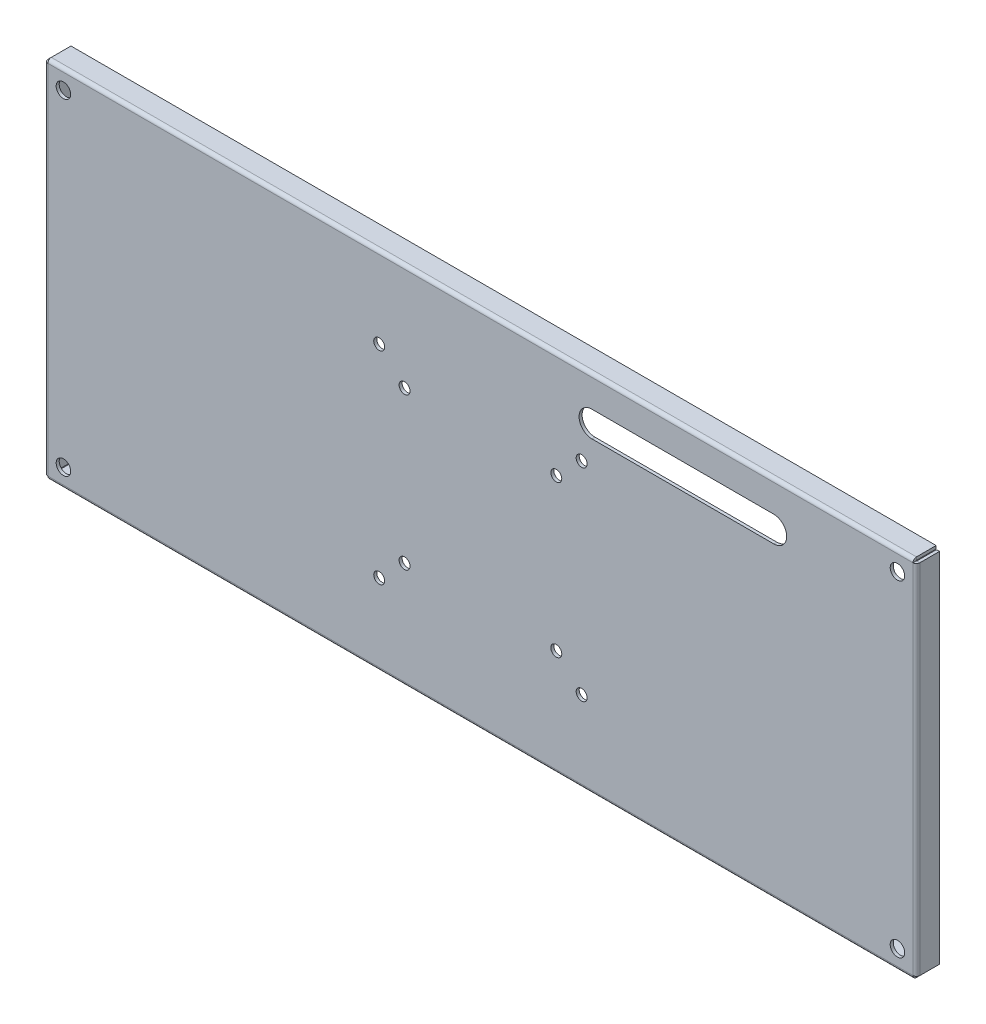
ISO-10303-21;
HEADER;
FILE_DESCRIPTION(('STEP AP214'),'2;1');
FILE_NAME('part.step','',(''),(''),'','','');
FILE_SCHEMA(('AUTOMOTIVE_DESIGN { 1 0 10303 214 1 1 1 1 }'));
ENDSEC;
DATA;
#1=APPLICATION_CONTEXT('core data for automotive mechanical design processes');
#2=APPLICATION_PROTOCOL_DEFINITION('international standard','automotive_design',2000,#1);
#3=PRODUCT_CONTEXT('',#1,'mechanical');
#4=PRODUCT('Part','Part','',(#3));
#5=PRODUCT_RELATED_PRODUCT_CATEGORY('part','',(#4));
#6=PRODUCT_DEFINITION_FORMATION('','',#4);
#7=PRODUCT_DEFINITION_CONTEXT('part definition',#1,'design');
#8=PRODUCT_DEFINITION('design','',#6,#7);
#9=PRODUCT_DEFINITION_SHAPE('','',#8);
#10=(LENGTH_UNIT() NAMED_UNIT(*) SI_UNIT(.MILLI.,.METRE.));
#11=(NAMED_UNIT(*) PLANE_ANGLE_UNIT() SI_UNIT($,.RADIAN.));
#12=(NAMED_UNIT(*) SI_UNIT($,.STERADIAN.) SOLID_ANGLE_UNIT());
#13=UNCERTAINTY_MEASURE_WITH_UNIT(LENGTH_MEASURE(1.E-05),#10,'distance_accuracy_value','');
#14=(GEOMETRIC_REPRESENTATION_CONTEXT(3) GLOBAL_UNCERTAINTY_ASSIGNED_CONTEXT((#13)) GLOBAL_UNIT_ASSIGNED_CONTEXT((#10,
#11,#12)) REPRESENTATION_CONTEXT('',''));
#15=CARTESIAN_POINT('',(0.,0.,0.));
#16=DIRECTION('',(0.,0.,1.));
#17=DIRECTION('',(1.,0.,0.));
#18=AXIS2_PLACEMENT_3D('',#15,#16,#17);
#19=CARTESIAN_POINT('',(0.,0.,-1.5));
#20=DIRECTION('',(0.,0.,1.));
#21=DIRECTION('',(1.,0.,0.));
#22=AXIS2_PLACEMENT_3D('',#19,#20,#21);
#23=PLANE('',#22);
#24=DIRECTION('',(-1.,0.,0.));
#25=VECTOR('',#24,1.);
#26=CARTESIAN_POINT('',(302.90168067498,229.39773402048,-1.5));
#27=LINE('',#26,#25);
#28=CARTESIAN_POINT('',(392.81768067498,229.39773402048,-1.5));
#29=VERTEX_POINT('',#28);
#30=CARTESIAN_POINT('',(302.90168067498,229.39773402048,-1.5));
#31=VERTEX_POINT('',#30);
#32=EDGE_CURVE('E542',#29,#31,#27,.T.);
#33=ORIENTED_EDGE('',*,*,#32,.T.);
#34=CARTESIAN_POINT('',(302.90168067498,223.04773402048,-1.5));
#35=DIRECTION('',(0.,0.,1.));
#36=DIRECTION('',(1.,0.,0.));
#37=AXIS2_PLACEMENT_3D('',#34,#35,#36);
#38=CIRCLE('',#37,6.35000000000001);
#39=CARTESIAN_POINT('',(302.90168067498,216.69773402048,-1.5));
#40=VERTEX_POINT('',#39);
#41=EDGE_CURVE('E534',#31,#40,#38,.T.);
#42=ORIENTED_EDGE('',*,*,#41,.T.);
#43=DIRECTION('',(1.,0.,0.));
#44=VECTOR('',#43,1.);
#45=CARTESIAN_POINT('',(302.90168067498,216.69773402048,-1.5));
#46=LINE('',#45,#44);
#47=CARTESIAN_POINT('',(392.81768067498,216.69773402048,-1.5));
#48=VERTEX_POINT('',#47);
#49=EDGE_CURVE('E537',#40,#48,#46,.T.);
#50=ORIENTED_EDGE('',*,*,#49,.T.);
#51=CARTESIAN_POINT('',(392.81768067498,223.04773402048,-1.5));
#52=DIRECTION('',(0.,0.,1.));
#53=DIRECTION('',(1.,0.,0.));
#54=AXIS2_PLACEMENT_3D('',#51,#52,#53);
#55=CIRCLE('',#54,6.35000000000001);
#56=EDGE_CURVE('E52',#48,#29,#55,.T.);
#57=ORIENTED_EDGE('',*,*,#56,.T.);
#58=EDGE_LOOP('',(#33,#42,#50,#57));
#59=FACE_BOUND('',#58,.T.);
#60=CARTESIAN_POINT('',(453.93385971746,73.98225450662,-1.5));
#61=DIRECTION('',(0.,0.,1.));
#62=DIRECTION('',(1.,0.,0.));
#63=AXIS2_PLACEMENT_3D('',#60,#61,#62);
#64=CIRCLE('',#63,3.58140000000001);
#65=CARTESIAN_POINT('',(457.51525971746,73.98225450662,-1.5));
#66=VERTEX_POINT('',#65);
#67=EDGE_CURVE('E563',#66,#66,#64,.T.);
#68=ORIENTED_EDGE('',*,*,#67,.T.);
#69=EDGE_LOOP('',(#68));
#70=FACE_BOUND('',#69,.T.);
#71=CARTESIAN_POINT('',(453.93385971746,235.32479628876,-1.5));
#72=DIRECTION('',(0.,0.,1.));
#73=DIRECTION('',(1.,0.,0.));
#74=AXIS2_PLACEMENT_3D('',#71,#72,#73);
#75=CIRCLE('',#74,3.58140000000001);
#76=CARTESIAN_POINT('',(457.51525971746,235.32479628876,-1.5));
#77=VERTEX_POINT('',#76);
#78=EDGE_CURVE('E569',#77,#77,#75,.T.);
#79=ORIENTED_EDGE('',*,*,#78,.T.);
#80=EDGE_LOOP('',(#79));
#81=FACE_BOUND('',#80,.T.);
#82=CARTESIAN_POINT('',(41.63350162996,73.97510969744,-1.5));
#83=DIRECTION('',(0.,0.,1.));
#84=DIRECTION('',(1.,0.,0.));
#85=AXIS2_PLACEMENT_3D('',#82,#83,#84);
#86=CIRCLE('',#85,3.5814);
#87=CARTESIAN_POINT('',(45.21490162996,73.97510969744,-1.5));
#88=VERTEX_POINT('',#87);
#89=EDGE_CURVE('E575',#88,#88,#86,.T.);
#90=ORIENTED_EDGE('',*,*,#89,.T.);
#91=EDGE_LOOP('',(#90));
#92=FACE_BOUND('',#91,.T.);
#93=CARTESIAN_POINT('',(41.63350162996,235.32479628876,-1.5));
#94=DIRECTION('',(0.,0.,1.));
#95=DIRECTION('',(1.,0.,0.));
#96=AXIS2_PLACEMENT_3D('',#93,#94,#95);
#97=CIRCLE('',#96,3.5814);
#98=CARTESIAN_POINT('',(45.21490162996,235.32479628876,-1.5));
#99=VERTEX_POINT('',#98);
#100=EDGE_CURVE('E581',#99,#99,#97,.T.);
#101=ORIENTED_EDGE('',*,*,#100,.T.);
#102=EDGE_LOOP('',(#101));
#103=FACE_BOUND('',#102,.T.);
#104=CARTESIAN_POINT('',(210.28058067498,117.155427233,-1.5));
#105=DIRECTION('',(0.,0.,1.));
#106=DIRECTION('',(1.,0.,0.));
#107=AXIS2_PLACEMENT_3D('',#104,#105,#106);
#108=CIRCLE('',#107,2.70509999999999);
#109=CARTESIAN_POINT('',(212.98568067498,117.155427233,-1.5));
#110=VERTEX_POINT('',#109);
#111=EDGE_CURVE('E587',#110,#110,#108,.T.);
#112=ORIENTED_EDGE('',*,*,#111,.T.);
#113=EDGE_LOOP('',(#112));
#114=FACE_BOUND('',#113,.T.);
#115=CARTESIAN_POINT('',(285.28678067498,117.155427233,-1.5));
#116=DIRECTION('',(0.,0.,1.));
#117=DIRECTION('',(1.,0.,0.));
#118=AXIS2_PLACEMENT_3D('',#115,#116,#117);
#119=CIRCLE('',#118,2.70510000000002);
#120=CARTESIAN_POINT('',(287.99188067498,117.155427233,-1.5));
#121=VERTEX_POINT('',#120);
#122=EDGE_CURVE('E593',#121,#121,#119,.T.);
#123=ORIENTED_EDGE('',*,*,#122,.T.);
#124=EDGE_LOOP('',(#123));
#125=FACE_BOUND('',#124,.T.);
#126=CARTESIAN_POINT('',(285.28678067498,192.161627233,-1.5));
#127=DIRECTION('',(0.,0.,1.));
#128=DIRECTION('',(1.,0.,0.));
#129=AXIS2_PLACEMENT_3D('',#126,#127,#128);
#130=CIRCLE('',#129,2.70510000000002);
#131=CARTESIAN_POINT('',(287.99188067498,192.161627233,-1.5));
#132=VERTEX_POINT('',#131);
#133=EDGE_CURVE('E599',#132,#132,#130,.T.);
#134=ORIENTED_EDGE('',*,*,#133,.T.);
#135=EDGE_LOOP('',(#134));
#136=FACE_BOUND('',#135,.T.);
#137=CARTESIAN_POINT('',(210.28058067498,192.161627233,-1.5));
#138=DIRECTION('',(0.,0.,1.));
#139=DIRECTION('',(1.,0.,0.));
#140=AXIS2_PLACEMENT_3D('',#137,#138,#139);
#141=CIRCLE('',#140,2.70509999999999);
#142=CARTESIAN_POINT('',(212.98568067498,192.161627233,-1.5));
#143=VERTEX_POINT('',#142);
#144=EDGE_CURVE('E605',#143,#143,#141,.T.);
#145=ORIENTED_EDGE('',*,*,#144,.T.);
#146=EDGE_LOOP('',(#145));
#147=FACE_BOUND('',#146,.T.);
#148=CARTESIAN_POINT('',(197.74568067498,104.620527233,-1.5));
#149=DIRECTION('',(0.,0.,1.));
#150=DIRECTION('',(1.,0.,0.));
#151=AXIS2_PLACEMENT_3D('',#148,#149,#150);
#152=CIRCLE('',#151,2.70509999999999);
#153=CARTESIAN_POINT('',(200.45078067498,104.620527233,-1.5));
#154=VERTEX_POINT('',#153);
#155=EDGE_CURVE('E611',#154,#154,#152,.T.);
#156=ORIENTED_EDGE('',*,*,#155,.T.);
#157=EDGE_LOOP('',(#156));
#158=FACE_BOUND('',#157,.T.);
#159=CARTESIAN_POINT('',(297.82168067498,104.620527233,-1.5));
#160=DIRECTION('',(0.,0.,1.));
#161=DIRECTION('',(1.,0.,0.));
#162=AXIS2_PLACEMENT_3D('',#159,#160,#161);
#163=CIRCLE('',#162,2.70510000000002);
#164=CARTESIAN_POINT('',(300.52678067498,104.620527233,-1.5));
#165=VERTEX_POINT('',#164);
#166=EDGE_CURVE('E617',#165,#165,#163,.T.);
#167=ORIENTED_EDGE('',*,*,#166,.T.);
#168=EDGE_LOOP('',(#167));
#169=FACE_BOUND('',#168,.T.);
#170=CARTESIAN_POINT('',(297.82168067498,204.696527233,-1.5));
#171=DIRECTION('',(0.,0.,1.));
#172=DIRECTION('',(1.,0.,0.));
#173=AXIS2_PLACEMENT_3D('',#170,#171,#172);
#174=CIRCLE('',#173,2.70510000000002);
#175=CARTESIAN_POINT('',(300.52678067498,204.696527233,-1.5));
#176=VERTEX_POINT('',#175);
#177=EDGE_CURVE('E623',#176,#176,#174,.T.);
#178=ORIENTED_EDGE('',*,*,#177,.T.);
#179=EDGE_LOOP('',(#178));
#180=FACE_BOUND('',#179,.T.);
#181=CARTESIAN_POINT('',(197.74568067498,204.696527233,-1.5));
#182=DIRECTION('',(0.,0.,1.));
#183=DIRECTION('',(1.,0.,0.));
#184=AXIS2_PLACEMENT_3D('',#181,#182,#183);
#185=CIRCLE('',#184,2.70509999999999);
#186=CARTESIAN_POINT('',(200.45078067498,204.696527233,-1.5));
#187=VERTEX_POINT('',#186);
#188=EDGE_CURVE('E11',#187,#187,#185,.T.);
#189=ORIENTED_EDGE('',*,*,#188,.T.);
#190=EDGE_LOOP('',(#189));
#191=FACE_BOUND('',#190,.T.);
#192=DIRECTION('',(-1.,0.,0.));
#193=VECTOR('',#192,1.);
#194=CARTESIAN_POINT('',(33.9391067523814,66.30430969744,-1.5));
#195=LINE('',#194,#193);
#196=CARTESIAN_POINT('',(33.96270162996,66.30430969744,-1.5));
#197=VERTEX_POINT('',#196);
#198=CARTESIAN_POINT('',(461.60465971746,66.30430969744,-1.5));
#199=VERTEX_POINT('',#198);
#200=EDGE_CURVE('E235',#197,#199,#195,.F.);
#201=ORIENTED_EDGE('',*,*,#200,.F.);
#202=DIRECTION('',(0.,1.,0.));
#203=VECTOR('',#202,1.);
#204=CARTESIAN_POINT('',(33.96270162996,243.019191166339,-1.5));
#205=LINE('',#204,#203);
#206=CARTESIAN_POINT('',(33.96270162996,242.99559628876,-1.5));
#207=VERTEX_POINT('',#206);
#208=EDGE_CURVE('E395',#207,#197,#205,.F.);
#209=ORIENTED_EDGE('',*,*,#208,.F.);
#210=DIRECTION('',(1.,0.,0.));
#211=VECTOR('',#210,1.);
#212=CARTESIAN_POINT('',(461.628254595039,242.99559628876,-1.49999999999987));
#213=LINE('',#212,#211);
#214=CARTESIAN_POINT('',(461.60465971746,242.99559628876,-1.5));
#215=VERTEX_POINT('',#214);
#216=EDGE_CURVE('E478',#215,#207,#213,.F.);
#217=ORIENTED_EDGE('',*,*,#216,.F.);
#218=DIRECTION('',(0.,-1.,0.));
#219=VECTOR('',#218,1.);
#220=CARTESIAN_POINT('',(461.60465971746,66.2807148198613,-1.5));
#221=LINE('',#220,#219);
#222=EDGE_CURVE('E313',#199,#215,#221,.F.);
#223=ORIENTED_EDGE('',*,*,#222,.F.);
#224=EDGE_LOOP('',(#201,#209,#217,#223));
#225=FACE_BOUND('',#224,.T.);
#226=ADVANCED_FACE('F37',(#59,#70,#81,#92,#103,#114,#125,#136,#147,#158,#169,#180,#191,#225),
#23,.F.);
#227=CARTESIAN_POINT('',(0.,0.,0.));
#228=DIRECTION('',(0.,0.,1.));
#229=DIRECTION('',(1.,0.,0.));
#230=AXIS2_PLACEMENT_3D('',#227,#228,#229);
#231=PLANE('',#230);
#232=CARTESIAN_POINT('',(302.90168067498,223.04773402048,0.));
#233=DIRECTION('',(0.,0.,1.));
#234=DIRECTION('',(1.,0.,0.));
#235=AXIS2_PLACEMENT_3D('',#232,#233,#234);
#236=CIRCLE('',#235,6.35000000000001);
#237=CARTESIAN_POINT('',(302.90168067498,229.39773402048,0.));
#238=VERTEX_POINT('',#237);
#239=CARTESIAN_POINT('',(302.90168067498,216.69773402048,0.));
#240=VERTEX_POINT('',#239);
#241=EDGE_CURVE('E60',#238,#240,#236,.T.);
#242=ORIENTED_EDGE('',*,*,#241,.F.);
#243=DIRECTION('',(-1.,0.,0.));
#244=VECTOR('',#243,1.);
#245=CARTESIAN_POINT('',(302.90168067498,229.39773402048,0.));
#246=LINE('',#245,#244);
#247=CARTESIAN_POINT('',(392.81768067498,229.39773402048,0.));
#248=VERTEX_POINT('',#247);
#249=EDGE_CURVE('E538',#248,#238,#246,.T.);
#250=ORIENTED_EDGE('',*,*,#249,.F.);
#251=CARTESIAN_POINT('',(392.81768067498,223.04773402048,0.));
#252=DIRECTION('',(0.,0.,1.));
#253=DIRECTION('',(1.,0.,0.));
#254=AXIS2_PLACEMENT_3D('',#251,#252,#253);
#255=CIRCLE('',#254,6.35000000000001);
#256=CARTESIAN_POINT('',(392.81768067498,216.69773402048,0.));
#257=VERTEX_POINT('',#256);
#258=EDGE_CURVE('E550',#257,#248,#255,.T.);
#259=ORIENTED_EDGE('',*,*,#258,.F.);
#260=DIRECTION('',(1.,0.,0.));
#261=VECTOR('',#260,1.);
#262=CARTESIAN_POINT('',(302.90168067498,216.69773402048,0.));
#263=LINE('',#262,#261);
#264=EDGE_CURVE('E547',#240,#257,#263,.T.);
#265=ORIENTED_EDGE('',*,*,#264,.F.);
#266=EDGE_LOOP('',(#242,#250,#259,#265));
#267=FACE_BOUND('',#266,.T.);
#268=CARTESIAN_POINT('',(453.93385971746,73.98225450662,0.));
#269=DIRECTION('',(0.,0.,1.));
#270=DIRECTION('',(1.,0.,0.));
#271=AXIS2_PLACEMENT_3D('',#268,#269,#270);
#272=CIRCLE('',#271,3.58140000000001);
#273=CARTESIAN_POINT('',(457.51525971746,73.98225450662,0.));
#274=VERTEX_POINT('',#273);
#275=EDGE_CURVE('E557',#274,#274,#272,.T.);
#276=ORIENTED_EDGE('',*,*,#275,.F.);
#277=EDGE_LOOP('',(#276));
#278=FACE_BOUND('',#277,.T.);
#279=CARTESIAN_POINT('',(453.93385971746,235.32479628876,0.));
#280=DIRECTION('',(0.,0.,1.));
#281=DIRECTION('',(1.,0.,0.));
#282=AXIS2_PLACEMENT_3D('',#279,#280,#281);
#283=CIRCLE('',#282,3.58140000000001);
#284=CARTESIAN_POINT('',(457.51525971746,235.32479628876,0.));
#285=VERTEX_POINT('',#284);
#286=EDGE_CURVE('E566',#285,#285,#283,.T.);
#287=ORIENTED_EDGE('',*,*,#286,.F.);
#288=EDGE_LOOP('',(#287));
#289=FACE_BOUND('',#288,.T.);
#290=CARTESIAN_POINT('',(41.63350162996,73.97510969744,0.));
#291=DIRECTION('',(0.,0.,1.));
#292=DIRECTION('',(1.,0.,0.));
#293=AXIS2_PLACEMENT_3D('',#290,#291,#292);
#294=CIRCLE('',#293,3.5814);
#295=CARTESIAN_POINT('',(45.21490162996,73.97510969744,0.));
#296=VERTEX_POINT('',#295);
#297=EDGE_CURVE('E572',#296,#296,#294,.T.);
#298=ORIENTED_EDGE('',*,*,#297,.F.);
#299=EDGE_LOOP('',(#298));
#300=FACE_BOUND('',#299,.T.);
#301=CARTESIAN_POINT('',(41.63350162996,235.32479628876,0.));
#302=DIRECTION('',(0.,0.,1.));
#303=DIRECTION('',(1.,0.,0.));
#304=AXIS2_PLACEMENT_3D('',#301,#302,#303);
#305=CIRCLE('',#304,3.5814);
#306=CARTESIAN_POINT('',(45.21490162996,235.32479628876,0.));
#307=VERTEX_POINT('',#306);
#308=EDGE_CURVE('E578',#307,#307,#305,.T.);
#309=ORIENTED_EDGE('',*,*,#308,.F.);
#310=EDGE_LOOP('',(#309));
#311=FACE_BOUND('',#310,.T.);
#312=CARTESIAN_POINT('',(210.28058067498,117.155427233,0.));
#313=DIRECTION('',(0.,0.,1.));
#314=DIRECTION('',(1.,0.,0.));
#315=AXIS2_PLACEMENT_3D('',#312,#313,#314);
#316=CIRCLE('',#315,2.70509999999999);
#317=CARTESIAN_POINT('',(212.98568067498,117.155427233,0.));
#318=VERTEX_POINT('',#317);
#319=EDGE_CURVE('E584',#318,#318,#316,.T.);
#320=ORIENTED_EDGE('',*,*,#319,.F.);
#321=EDGE_LOOP('',(#320));
#322=FACE_BOUND('',#321,.T.);
#323=CARTESIAN_POINT('',(285.28678067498,117.155427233,0.));
#324=DIRECTION('',(0.,0.,1.));
#325=DIRECTION('',(1.,0.,0.));
#326=AXIS2_PLACEMENT_3D('',#323,#324,#325);
#327=CIRCLE('',#326,2.70510000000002);
#328=CARTESIAN_POINT('',(287.99188067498,117.155427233,0.));
#329=VERTEX_POINT('',#328);
#330=EDGE_CURVE('E590',#329,#329,#327,.T.);
#331=ORIENTED_EDGE('',*,*,#330,.F.);
#332=EDGE_LOOP('',(#331));
#333=FACE_BOUND('',#332,.T.);
#334=CARTESIAN_POINT('',(285.28678067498,192.161627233,0.));
#335=DIRECTION('',(0.,0.,1.));
#336=DIRECTION('',(1.,0.,0.));
#337=AXIS2_PLACEMENT_3D('',#334,#335,#336);
#338=CIRCLE('',#337,2.70510000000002);
#339=CARTESIAN_POINT('',(287.99188067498,192.161627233,0.));
#340=VERTEX_POINT('',#339);
#341=EDGE_CURVE('E596',#340,#340,#338,.T.);
#342=ORIENTED_EDGE('',*,*,#341,.F.);
#343=EDGE_LOOP('',(#342));
#344=FACE_BOUND('',#343,.T.);
#345=CARTESIAN_POINT('',(210.28058067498,192.161627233,0.));
#346=DIRECTION('',(0.,0.,1.));
#347=DIRECTION('',(1.,0.,0.));
#348=AXIS2_PLACEMENT_3D('',#345,#346,#347);
#349=CIRCLE('',#348,2.70509999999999);
#350=CARTESIAN_POINT('',(212.98568067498,192.161627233,0.));
#351=VERTEX_POINT('',#350);
#352=EDGE_CURVE('E602',#351,#351,#349,.T.);
#353=ORIENTED_EDGE('',*,*,#352,.F.);
#354=EDGE_LOOP('',(#353));
#355=FACE_BOUND('',#354,.T.);
#356=CARTESIAN_POINT('',(197.74568067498,104.620527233,0.));
#357=DIRECTION('',(0.,0.,1.));
#358=DIRECTION('',(1.,0.,0.));
#359=AXIS2_PLACEMENT_3D('',#356,#357,#358);
#360=CIRCLE('',#359,2.70509999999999);
#361=CARTESIAN_POINT('',(200.45078067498,104.620527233,0.));
#362=VERTEX_POINT('',#361);
#363=EDGE_CURVE('E608',#362,#362,#360,.T.);
#364=ORIENTED_EDGE('',*,*,#363,.F.);
#365=EDGE_LOOP('',(#364));
#366=FACE_BOUND('',#365,.T.);
#367=CARTESIAN_POINT('',(297.82168067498,104.620527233,0.));
#368=DIRECTION('',(0.,0.,1.));
#369=DIRECTION('',(1.,0.,0.));
#370=AXIS2_PLACEMENT_3D('',#367,#368,#369);
#371=CIRCLE('',#370,2.70510000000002);
#372=CARTESIAN_POINT('',(300.52678067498,104.620527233,0.));
#373=VERTEX_POINT('',#372);
#374=EDGE_CURVE('E614',#373,#373,#371,.T.);
#375=ORIENTED_EDGE('',*,*,#374,.F.);
#376=EDGE_LOOP('',(#375));
#377=FACE_BOUND('',#376,.T.);
#378=CARTESIAN_POINT('',(297.82168067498,204.696527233,0.));
#379=DIRECTION('',(0.,0.,1.));
#380=DIRECTION('',(1.,0.,0.));
#381=AXIS2_PLACEMENT_3D('',#378,#379,#380);
#382=CIRCLE('',#381,2.70510000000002);
#383=CARTESIAN_POINT('',(300.52678067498,204.696527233,0.));
#384=VERTEX_POINT('',#383);
#385=EDGE_CURVE('E620',#384,#384,#382,.T.);
#386=ORIENTED_EDGE('',*,*,#385,.F.);
#387=EDGE_LOOP('',(#386));
#388=FACE_BOUND('',#387,.T.);
#389=CARTESIAN_POINT('',(197.74568067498,204.696527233,0.));
#390=DIRECTION('',(0.,0.,1.));
#391=DIRECTION('',(1.,0.,0.));
#392=AXIS2_PLACEMENT_3D('',#389,#390,#391);
#393=CIRCLE('',#392,2.70509999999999);
#394=CARTESIAN_POINT('',(200.45078067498,204.696527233,0.));
#395=VERTEX_POINT('',#394);
#396=EDGE_CURVE('E41',#395,#395,#393,.T.);
#397=ORIENTED_EDGE('',*,*,#396,.F.);
#398=EDGE_LOOP('',(#397));
#399=FACE_BOUND('',#398,.T.);
#400=DIRECTION('',(0.,1.,0.));
#401=VECTOR('',#400,1.);
#402=CARTESIAN_POINT('',(33.96270162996,243.019191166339,0.));
#403=LINE('',#402,#401);
#404=CARTESIAN_POINT('',(33.96270162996,242.99559628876,0.));
#405=VERTEX_POINT('',#404);
#406=CARTESIAN_POINT('',(33.96270162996,66.30430969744,0.));
#407=VERTEX_POINT('',#406);
#408=EDGE_CURVE('E404',#405,#407,#403,.F.);
#409=ORIENTED_EDGE('',*,*,#408,.T.);
#410=DIRECTION('',(-1.,0.,0.));
#411=VECTOR('',#410,1.);
#412=CARTESIAN_POINT('',(33.9391067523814,66.30430969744,0.));
#413=LINE('',#412,#411);
#414=CARTESIAN_POINT('',(461.60465971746,66.30430969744,0.));
#415=VERTEX_POINT('',#414);
#416=EDGE_CURVE('E243',#407,#415,#413,.F.);
#417=ORIENTED_EDGE('',*,*,#416,.T.);
#418=DIRECTION('',(0.,-1.,0.));
#419=VECTOR('',#418,1.);
#420=CARTESIAN_POINT('',(461.60465971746,66.2807148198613,0.));
#421=LINE('',#420,#419);
#422=CARTESIAN_POINT('',(461.60465971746,242.99559628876,1.2619483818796E-13));
#423=VERTEX_POINT('',#422);
#424=EDGE_CURVE('E321',#415,#423,#421,.F.);
#425=ORIENTED_EDGE('',*,*,#424,.T.);
#426=DIRECTION('',(1.,0.,0.));
#427=VECTOR('',#426,1.);
#428=CARTESIAN_POINT('',(461.628254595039,242.99559628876,1.26201132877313E-13));
#429=LINE('',#428,#427);
#430=EDGE_CURVE('E487',#423,#405,#429,.F.);
#431=ORIENTED_EDGE('',*,*,#430,.T.);
#432=EDGE_LOOP('',(#409,#417,#425,#431));
#433=FACE_BOUND('',#432,.T.);
#434=ADVANCED_FACE('F39',(#267,#278,#289,#300,#311,#322,#333,#344,#355,#366,#377,#388,#399,
#433),#231,.T.);
#435=CARTESIAN_POINT('',(197.74568067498,204.696527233,-1.5));
#436=DIRECTION('',(0.,0.,1.));
#437=DIRECTION('',(1.,0.,0.));
#438=AXIS2_PLACEMENT_3D('',#435,#436,#437);
#439=CYLINDRICAL_SURFACE('',#438,2.70509999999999);
#440=ORIENTED_EDGE('',*,*,#188,.F.);
#441=EDGE_LOOP('',(#440));
#442=FACE_BOUND('',#441,.T.);
#443=ORIENTED_EDGE('',*,*,#396,.T.);
#444=EDGE_LOOP('',(#443));
#445=FACE_BOUND('',#444,.T.);
#446=ADVANCED_FACE('F633',(#442,#445),#439,.F.);
#447=CARTESIAN_POINT('',(297.82168067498,204.696527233,-1.5));
#448=DIRECTION('',(0.,0.,1.));
#449=DIRECTION('',(1.,0.,0.));
#450=AXIS2_PLACEMENT_3D('',#447,#448,#449);
#451=CYLINDRICAL_SURFACE('',#450,2.70510000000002);
#452=ORIENTED_EDGE('',*,*,#177,.F.);
#453=EDGE_LOOP('',(#452));
#454=FACE_BOUND('',#453,.T.);
#455=ORIENTED_EDGE('',*,*,#385,.T.);
#456=EDGE_LOOP('',(#455));
#457=FACE_BOUND('',#456,.T.);
#458=ADVANCED_FACE('F629',(#454,#457),#451,.F.);
#459=CARTESIAN_POINT('',(297.82168067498,104.620527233,-1.5));
#460=DIRECTION('',(0.,0.,1.));
#461=DIRECTION('',(1.,0.,0.));
#462=AXIS2_PLACEMENT_3D('',#459,#460,#461);
#463=CYLINDRICAL_SURFACE('',#462,2.70510000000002);
#464=ORIENTED_EDGE('',*,*,#166,.F.);
#465=EDGE_LOOP('',(#464));
#466=FACE_BOUND('',#465,.T.);
#467=ORIENTED_EDGE('',*,*,#374,.T.);
#468=EDGE_LOOP('',(#467));
#469=FACE_BOUND('',#468,.T.);
#470=ADVANCED_FACE('F736',(#466,#469),#463,.F.);
#471=CARTESIAN_POINT('',(197.74568067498,104.620527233,-1.5));
#472=DIRECTION('',(0.,0.,1.));
#473=DIRECTION('',(1.,0.,0.));
#474=AXIS2_PLACEMENT_3D('',#471,#472,#473);
#475=CYLINDRICAL_SURFACE('',#474,2.70509999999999);
#476=ORIENTED_EDGE('',*,*,#155,.F.);
#477=EDGE_LOOP('',(#476));
#478=FACE_BOUND('',#477,.T.);
#479=ORIENTED_EDGE('',*,*,#363,.T.);
#480=EDGE_LOOP('',(#479));
#481=FACE_BOUND('',#480,.T.);
#482=ADVANCED_FACE('F740',(#478,#481),#475,.F.);
#483=CARTESIAN_POINT('',(210.28058067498,192.161627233,-1.5));
#484=DIRECTION('',(0.,0.,1.));
#485=DIRECTION('',(1.,0.,0.));
#486=AXIS2_PLACEMENT_3D('',#483,#484,#485);
#487=CYLINDRICAL_SURFACE('',#486,2.70509999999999);
#488=ORIENTED_EDGE('',*,*,#144,.F.);
#489=EDGE_LOOP('',(#488));
#490=FACE_BOUND('',#489,.T.);
#491=ORIENTED_EDGE('',*,*,#352,.T.);
#492=EDGE_LOOP('',(#491));
#493=FACE_BOUND('',#492,.T.);
#494=ADVANCED_FACE('F744',(#490,#493),#487,.F.);
#495=CARTESIAN_POINT('',(285.28678067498,192.161627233,-1.5));
#496=DIRECTION('',(0.,0.,1.));
#497=DIRECTION('',(1.,0.,0.));
#498=AXIS2_PLACEMENT_3D('',#495,#496,#497);
#499=CYLINDRICAL_SURFACE('',#498,2.70510000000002);
#500=ORIENTED_EDGE('',*,*,#133,.F.);
#501=EDGE_LOOP('',(#500));
#502=FACE_BOUND('',#501,.T.);
#503=ORIENTED_EDGE('',*,*,#341,.T.);
#504=EDGE_LOOP('',(#503));
#505=FACE_BOUND('',#504,.T.);
#506=ADVANCED_FACE('F748',(#502,#505),#499,.F.);
#507=CARTESIAN_POINT('',(285.28678067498,117.155427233,-1.5));
#508=DIRECTION('',(0.,0.,1.));
#509=DIRECTION('',(1.,0.,0.));
#510=AXIS2_PLACEMENT_3D('',#507,#508,#509);
#511=CYLINDRICAL_SURFACE('',#510,2.70510000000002);
#512=ORIENTED_EDGE('',*,*,#122,.F.);
#513=EDGE_LOOP('',(#512));
#514=FACE_BOUND('',#513,.T.);
#515=ORIENTED_EDGE('',*,*,#330,.T.);
#516=EDGE_LOOP('',(#515));
#517=FACE_BOUND('',#516,.T.);
#518=ADVANCED_FACE('F752',(#514,#517),#511,.F.);
#519=CARTESIAN_POINT('',(210.28058067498,117.155427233,-1.5));
#520=DIRECTION('',(0.,0.,1.));
#521=DIRECTION('',(1.,0.,0.));
#522=AXIS2_PLACEMENT_3D('',#519,#520,#521);
#523=CYLINDRICAL_SURFACE('',#522,2.70509999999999);
#524=ORIENTED_EDGE('',*,*,#111,.F.);
#525=EDGE_LOOP('',(#524));
#526=FACE_BOUND('',#525,.T.);
#527=ORIENTED_EDGE('',*,*,#319,.T.);
#528=EDGE_LOOP('',(#527));
#529=FACE_BOUND('',#528,.T.);
#530=ADVANCED_FACE('F756',(#526,#529),#523,.F.);
#531=CARTESIAN_POINT('',(41.63350162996,235.32479628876,-1.5));
#532=DIRECTION('',(0.,0.,1.));
#533=DIRECTION('',(1.,0.,0.));
#534=AXIS2_PLACEMENT_3D('',#531,#532,#533);
#535=CYLINDRICAL_SURFACE('',#534,3.5814);
#536=ORIENTED_EDGE('',*,*,#100,.F.);
#537=EDGE_LOOP('',(#536));
#538=FACE_BOUND('',#537,.T.);
#539=ORIENTED_EDGE('',*,*,#308,.T.);
#540=EDGE_LOOP('',(#539));
#541=FACE_BOUND('',#540,.T.);
#542=ADVANCED_FACE('F760',(#538,#541),#535,.F.);
#543=CARTESIAN_POINT('',(41.63350162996,73.97510969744,-1.5));
#544=DIRECTION('',(0.,0.,1.));
#545=DIRECTION('',(1.,0.,0.));
#546=AXIS2_PLACEMENT_3D('',#543,#544,#545);
#547=CYLINDRICAL_SURFACE('',#546,3.5814);
#548=ORIENTED_EDGE('',*,*,#89,.F.);
#549=EDGE_LOOP('',(#548));
#550=FACE_BOUND('',#549,.T.);
#551=ORIENTED_EDGE('',*,*,#297,.T.);
#552=EDGE_LOOP('',(#551));
#553=FACE_BOUND('',#552,.T.);
#554=ADVANCED_FACE('F764',(#550,#553),#547,.F.);
#555=CARTESIAN_POINT('',(453.93385971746,235.32479628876,-1.5));
#556=DIRECTION('',(0.,0.,1.));
#557=DIRECTION('',(1.,0.,0.));
#558=AXIS2_PLACEMENT_3D('',#555,#556,#557);
#559=CYLINDRICAL_SURFACE('',#558,3.58140000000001);
#560=ORIENTED_EDGE('',*,*,#78,.F.);
#561=EDGE_LOOP('',(#560));
#562=FACE_BOUND('',#561,.T.);
#563=ORIENTED_EDGE('',*,*,#286,.T.);
#564=EDGE_LOOP('',(#563));
#565=FACE_BOUND('',#564,.T.);
#566=ADVANCED_FACE('F768',(#562,#565),#559,.F.);
#567=CARTESIAN_POINT('',(453.93385971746,73.98225450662,-1.5));
#568=DIRECTION('',(0.,0.,1.));
#569=DIRECTION('',(1.,0.,0.));
#570=AXIS2_PLACEMENT_3D('',#567,#568,#569);
#571=CYLINDRICAL_SURFACE('',#570,3.58140000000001);
#572=ORIENTED_EDGE('',*,*,#67,.F.);
#573=EDGE_LOOP('',(#572));
#574=FACE_BOUND('',#573,.T.);
#575=ORIENTED_EDGE('',*,*,#275,.T.);
#576=EDGE_LOOP('',(#575));
#577=FACE_BOUND('',#576,.T.);
#578=ADVANCED_FACE('F772',(#574,#577),#571,.F.);
#579=CARTESIAN_POINT('',(302.90168067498,223.04773402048,-1.5));
#580=DIRECTION('',(0.,0.,1.));
#581=DIRECTION('',(1.,0.,0.));
#582=AXIS2_PLACEMENT_3D('',#579,#580,#581);
#583=CYLINDRICAL_SURFACE('',#582,6.35000000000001);
#584=ORIENTED_EDGE('',*,*,#241,.T.);
#585=DIRECTION('',(0.,0.,1.));
#586=VECTOR('',#585,1.);
#587=CARTESIAN_POINT('',(302.90168067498,216.69773402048,-1.5));
#588=LINE('',#587,#586);
#589=EDGE_CURVE('E545',#40,#240,#588,.T.);
#590=ORIENTED_EDGE('',*,*,#589,.F.);
#591=ORIENTED_EDGE('',*,*,#41,.F.);
#592=DIRECTION('',(0.,0.,1.));
#593=VECTOR('',#592,1.);
#594=CARTESIAN_POINT('',(302.90168067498,229.39773402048,-1.5));
#595=LINE('',#594,#593);
#596=EDGE_CURVE('E555',#31,#238,#595,.T.);
#597=ORIENTED_EDGE('',*,*,#596,.T.);
#598=EDGE_LOOP('',(#584,#590,#591,#597));
#599=FACE_BOUND('',#598,.T.);
#600=ADVANCED_FACE('F776',(#599),#583,.F.);
#601=CARTESIAN_POINT('',(302.90168067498,229.39773402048,-1.5));
#602=DIRECTION('',(0.,1.,0.));
#603=DIRECTION('',(0.,0.,1.));
#604=AXIS2_PLACEMENT_3D('',#601,#602,#603);
#605=PLANE('',#604);
#606=ORIENTED_EDGE('',*,*,#249,.T.);
#607=ORIENTED_EDGE('',*,*,#596,.F.);
#608=ORIENTED_EDGE('',*,*,#32,.F.);
#609=DIRECTION('',(0.,0.,1.));
#610=VECTOR('',#609,1.);
#611=CARTESIAN_POINT('',(392.81768067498,229.39773402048,-1.5));
#612=LINE('',#611,#610);
#613=EDGE_CURVE('E558',#29,#248,#612,.T.);
#614=ORIENTED_EDGE('',*,*,#613,.T.);
#615=EDGE_LOOP('',(#606,#607,#608,#614));
#616=FACE_BOUND('',#615,.T.);
#617=ADVANCED_FACE('F780',(#616),#605,.F.);
#618=CARTESIAN_POINT('',(392.81768067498,223.04773402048,-1.5));
#619=DIRECTION('',(0.,0.,1.));
#620=DIRECTION('',(1.,0.,0.));
#621=AXIS2_PLACEMENT_3D('',#618,#619,#620);
#622=CYLINDRICAL_SURFACE('',#621,6.35000000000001);
#623=ORIENTED_EDGE('',*,*,#258,.T.);
#624=ORIENTED_EDGE('',*,*,#613,.F.);
#625=ORIENTED_EDGE('',*,*,#56,.F.);
#626=DIRECTION('',(0.,0.,1.));
#627=VECTOR('',#626,1.);
#628=CARTESIAN_POINT('',(392.81768067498,216.69773402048,-1.5));
#629=LINE('',#628,#627);
#630=EDGE_CURVE('E560',#48,#257,#629,.T.);
#631=ORIENTED_EDGE('',*,*,#630,.T.);
#632=EDGE_LOOP('',(#623,#624,#625,#631));
#633=FACE_BOUND('',#632,.T.);
#634=ADVANCED_FACE('F784',(#633),#622,.F.);
#635=CARTESIAN_POINT('',(302.90168067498,216.69773402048,-1.5));
#636=DIRECTION('',(0.,-1.,0.));
#637=DIRECTION('',(0.,0.,-1.));
#638=AXIS2_PLACEMENT_3D('',#635,#636,#637);
#639=PLANE('',#638);
#640=ORIENTED_EDGE('',*,*,#264,.T.);
#641=ORIENTED_EDGE('',*,*,#630,.F.);
#642=ORIENTED_EDGE('',*,*,#49,.F.);
#643=ORIENTED_EDGE('',*,*,#589,.T.);
#644=EDGE_LOOP('',(#640,#641,#642,#643));
#645=FACE_BOUND('',#644,.T.);
#646=ADVANCED_FACE('F781',(#645),#639,.F.);
#647=CARTESIAN_POINT('',(33.96270162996,242.99559628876,0.0149999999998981));
#648=CARTESIAN_POINT('',(33.9607350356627,243.220548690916,0.0149999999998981));
#649=CARTESIAN_POINT('',(33.9587691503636,243.445331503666,-0.0297201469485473));
#650=CARTESIAN_POINT('',(33.9548366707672,243.860914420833,-0.201860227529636));
#651=CARTESIAN_POINT('',(33.9528704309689,244.051510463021,-0.329212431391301));
#652=CARTESIAN_POINT('',(33.9489379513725,244.369583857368,-0.647285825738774));
#653=CARTESIAN_POINT('',(33.9469717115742,244.49693606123,-0.8378818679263));
#654=CARTESIAN_POINT('',(33.9430392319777,244.669076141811,-1.25346478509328));
#655=CARTESIAN_POINT('',(33.9410733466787,244.71379628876,-1.4782475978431));
#656=CARTESIAN_POINT('',(33.9391067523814,244.71379628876,-1.70319999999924));
#657=CARTESIAN_POINT('',(33.96270162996,242.99559628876,-1.01915004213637E-13));
#658=CARTESIAN_POINT('',(33.9607350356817,243.218584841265,-1.01914208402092E-13));
#659=CARTESIAN_POINT('',(33.9587691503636,243.441405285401,-0.0443297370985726));
#660=CARTESIAN_POINT('',(33.9548366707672,243.853360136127,-0.214967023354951));
#661=CARTESIAN_POINT('',(33.9528704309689,244.042292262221,-0.341207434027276));
#662=CARTESIAN_POINT('',(33.9489379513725,244.357588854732,-0.656504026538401));
#663=CARTESIAN_POINT('',(33.9469717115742,244.483829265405,-0.845436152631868));
#664=CARTESIAN_POINT('',(33.9430392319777,244.654466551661,-1.25739100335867));
#665=CARTESIAN_POINT('',(33.9410733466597,244.69879628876,-1.48021144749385));
#666=CARTESIAN_POINT('',(33.9391067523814,244.69879628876,-1.70319999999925));
#667=CARTESIAN_POINT('',(33.96270162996,242.99559628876,-1.5000000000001));
#668=CARTESIAN_POINT('',(33.9607350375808,243.022199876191,-1.5000000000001));
#669=CARTESIAN_POINT('',(33.9587691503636,243.048783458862,-1.5052887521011));
#670=CARTESIAN_POINT('',(33.9548366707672,243.097931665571,-1.5256466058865));
#671=CARTESIAN_POINT('',(33.9528704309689,243.120472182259,-1.54070769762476));
#672=CARTESIAN_POINT('',(33.9489379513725,243.158088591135,-1.57832410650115));
#673=CARTESIAN_POINT('',(33.9469717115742,243.173149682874,-1.60086462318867));
#674=CARTESIAN_POINT('',(33.9430392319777,243.193507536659,-1.65001282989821));
#675=CARTESIAN_POINT('',(33.9410733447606,243.19879628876,-1.6765964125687));
#676=CARTESIAN_POINT('',(33.9391067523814,243.19879628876,-1.70319999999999));
#677=CARTESIAN_POINT('',(33.96270162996,242.99559628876,-1.5151500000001));
#678=CARTESIAN_POINT('',(33.9607350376,243.020216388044,-1.5151500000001));
#679=CARTESIAN_POINT('',(33.9587691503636,243.044817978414,-1.52004443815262));
#680=CARTESIAN_POINT('',(33.9548366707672,243.090301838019,-1.53888446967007));
#681=CARTESIAN_POINT('',(33.9528704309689,243.111161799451,-1.5528226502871));
#682=CARTESIAN_POINT('',(33.9489379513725,243.145973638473,-1.58763448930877));
#683=CARTESIAN_POINT('',(33.9469717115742,243.15991181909,-1.60849445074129));
#684=CARTESIAN_POINT('',(33.9430392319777,243.178751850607,-1.65397831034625));
#685=CARTESIAN_POINT('',(33.9410733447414,243.18364628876,-1.67857990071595));
#686=CARTESIAN_POINT('',(33.9391067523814,243.18364628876,-1.7032));
#687=B_SPLINE_SURFACE_WITH_KNOTS('',1,3,((#647,#648,#649,#650,#651,#652,#653,#654,#655,#656),
(#657,#658,#659,#660,#661,#662,#663,#664,#665,#666),(#667,#668,#669,#670,#671,#672,#673,#674,
#675,#676),(#677,#678,#679,#680,#681,#682,#683,#684,#685,#686)),.UNSPECIFIED.,.F.,.F.,.F.,(2,1,
1,2),(4,2,2,2,4),(-0.01,0.,1.,1.0101),(0.,0.25,0.5,0.75,1.),.UNSPECIFIED.);
#688=DIRECTION('',(0.,-1.,0.));
#689=VECTOR('',#688,1.);
#690=CARTESIAN_POINT('',(33.9391067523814,243.19879628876,-1.70319999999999));
#691=LINE('',#690,#689);
#692=CARTESIAN_POINT('',(33.9391067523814,244.69879628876,-1.70320000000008));
#693=VERTEX_POINT('',#692);
#694=CARTESIAN_POINT('',(33.9391067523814,243.19879628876,-1.70320000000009));
#695=VERTEX_POINT('',#694);
#696=EDGE_CURVE('E475',#693,#695,#691,.T.);
#697=CARTESIAN_POINT('',(33.96270162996,242.99559628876,-1.5000000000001));
#698=CARTESIAN_POINT('',(33.9624558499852,242.998921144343,-1.49999992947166));
#699=CARTESIAN_POINT('',(33.9622100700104,243.002245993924,-1.50008160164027));
#700=CARTESIAN_POINT('',(33.9617185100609,243.008887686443,-1.50040792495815));
#701=CARTESIAN_POINT('',(33.9614727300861,243.01220452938,-1.50065257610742));
#702=CARTESIAN_POINT('',(33.9609811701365,243.01882221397,-1.5013043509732));
#703=CARTESIAN_POINT('',(33.9607353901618,243.022123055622,-1.5017114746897));
#704=CARTESIAN_POINT('',(33.9602438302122,243.028700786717,-1.50268719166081));
#705=CARTESIAN_POINT('',(33.9599980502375,243.031977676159,-1.50325578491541));
#706=CARTESIAN_POINT('',(33.9595064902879,243.038499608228,-1.50455307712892));
#707=CARTESIAN_POINT('',(33.9592607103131,243.041744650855,-1.50528177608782));
#708=CARTESIAN_POINT('',(33.9587691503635,243.048195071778,-1.50689752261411));
#709=CARTESIAN_POINT('',(33.9585233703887,243.051400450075,-1.50778457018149));
#710=CARTESIAN_POINT('',(33.9580318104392,243.057763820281,-1.50971487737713));
#711=CARTESIAN_POINT('',(33.9577860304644,243.060921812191,-1.5107581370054));
#712=CARTESIAN_POINT('',(33.9572944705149,243.067182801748,-1.51299835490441));
#713=CARTESIAN_POINT('',(33.9570486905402,243.070285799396,-1.51419531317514));
#714=CARTESIAN_POINT('',(33.9565571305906,243.076429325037,-1.51674004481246));
#715=CARTESIAN_POINT('',(33.9563113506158,243.079469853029,-1.51808781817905));
#716=CARTESIAN_POINT('',(33.9558197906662,243.085481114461,-1.52093093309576));
#717=CARTESIAN_POINT('',(33.9555740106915,243.0884518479,-1.52242627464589));
#718=CARTESIAN_POINT('',(33.955082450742,243.094316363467,-1.52556092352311));
#719=CARTESIAN_POINT('',(33.9548366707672,243.097210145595,-1.52720023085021));
#720=CARTESIAN_POINT('',(33.9543451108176,243.102913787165,-1.53061886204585));
#721=CARTESIAN_POINT('',(33.9540993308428,243.105723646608,-1.53239818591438));
#722=CARTESIAN_POINT('',(33.9536077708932,243.111252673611,-1.53609256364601));
#723=CARTESIAN_POINT('',(33.9533619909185,243.113971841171,-1.53800761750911));
#724=CARTESIAN_POINT('',(33.9528704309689,243.119312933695,-1.54196884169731));
#725=CARTESIAN_POINT('',(33.9526246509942,243.121934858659,-1.54401501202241));
#726=CARTESIAN_POINT('',(33.9521330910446,243.127075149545,-1.54823353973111));
#727=CARTESIAN_POINT('',(33.9518873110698,243.129593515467,-1.55040589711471));
#728=CARTESIAN_POINT('',(33.9513957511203,243.134520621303,-1.55487156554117));
#729=CARTESIAN_POINT('',(33.9511499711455,243.136929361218,-1.55716487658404));
#730=CARTESIAN_POINT('',(33.9506584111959,243.141631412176,-1.56186692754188));
#731=CARTESIAN_POINT('',(33.9504126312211,243.143924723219,-1.56427566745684));
#732=CARTESIAN_POINT('',(33.9499210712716,243.148390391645,-1.56920277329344));
#733=CARTESIAN_POINT('',(33.9496752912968,243.150562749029,-1.57172113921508));
#734=CARTESIAN_POINT('',(33.9491837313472,243.154781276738,-1.57686143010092));
#735=CARTESIAN_POINT('',(33.9489379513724,243.156827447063,-1.57948335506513));
#736=CARTESIAN_POINT('',(33.9484463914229,243.160788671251,-1.58482444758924));
#737=CARTESIAN_POINT('',(33.9482006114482,243.162703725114,-1.58754361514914));
#738=CARTESIAN_POINT('',(33.9477090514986,243.166398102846,-1.59307264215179));
#739=CARTESIAN_POINT('',(33.9474632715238,243.168177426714,-1.59588250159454));
#740=CARTESIAN_POINT('',(33.9469717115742,243.17159605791,-1.6015861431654));
#741=CARTESIAN_POINT('',(33.9467259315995,243.173235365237,-1.60447992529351));
#742=CARTESIAN_POINT('',(33.94623437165,243.176370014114,-1.61034444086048));
#743=CARTESIAN_POINT('',(33.9459885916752,243.177865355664,-1.61331517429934));
#744=CARTESIAN_POINT('',(33.9454970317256,243.180708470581,-1.61932643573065));
#745=CARTESIAN_POINT('',(33.9452512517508,243.182056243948,-1.62236696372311));
#746=CARTESIAN_POINT('',(33.9447596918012,243.184600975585,-1.62851048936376));
#747=CARTESIAN_POINT('',(33.9445139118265,243.185797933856,-1.63161348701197));
#748=CARTESIAN_POINT('',(33.9440223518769,243.188038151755,-1.63787447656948));
#749=CARTESIAN_POINT('',(33.9437765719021,243.189081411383,-1.64103246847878));
#750=CARTESIAN_POINT('',(33.9432850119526,243.191011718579,-1.64739583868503));
#751=CARTESIAN_POINT('',(33.9430392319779,243.191898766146,-1.65060121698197));
#752=CARTESIAN_POINT('',(33.9425476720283,243.193514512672,-1.65705163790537));
#753=CARTESIAN_POINT('',(33.9423018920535,243.194243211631,-1.66029668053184));
#754=CARTESIAN_POINT('',(33.9418103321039,243.195540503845,-1.66681861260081));
#755=CARTESIAN_POINT('',(33.9415645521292,243.196109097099,-1.67009550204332));
#756=CARTESIAN_POINT('',(33.9410729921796,243.19708481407,-1.67667323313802));
#757=CARTESIAN_POINT('',(33.9408272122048,243.197491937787,-1.67997407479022));
#758=CARTESIAN_POINT('',(33.9403356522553,243.198143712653,-1.68659175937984));
#759=CARTESIAN_POINT('',(33.9400898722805,243.198388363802,-1.68990860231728));
#760=CARTESIAN_POINT('',(33.9395983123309,243.19871468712,-1.69655029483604));
#761=CARTESIAN_POINT('',(33.9393525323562,243.198796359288,-1.69987514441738));
#762=CARTESIAN_POINT('',(33.9391067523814,243.19879628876,-1.70319999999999));
#763=B_SPLINE_CURVE_WITH_KNOTS('',3,(#697,#698,#699,#700,#701,#702,#703,#704,#705,#706,#707,
#708,#709,#710,#711,#712,#713,#714,#715,#716,#717,#718,#719,#720,#721,#722,#723,#724,#725,#726,
#727,#728,#729,#730,#731,#732,#733,#734,#735,#736,#737,#738,#739,#740,#741,#742,#743,#744,#745,
#746,#747,#748,#749,#750,#751,#752,#753,#754,#755,#756,#757,#758,#759,#760,#761,#762),
.UNSPECIFIED.,.F.,.F.,(4,2,2,2,2,2,2,2,2,2,2,2,2,2,2,2,2,2,2,2,2,2,2,2,2,2,2,2,2,2,2,2,4),(0.,
0.0100007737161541,0.0200015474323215,0.0300023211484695,0.0400030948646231,0.0500038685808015,
0.0600046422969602,0.0700054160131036,0.0800061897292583,0.0900069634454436,0.100007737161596,
0.110008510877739,0.12000928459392,0.130010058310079,0.140010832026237,0.15001160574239,
0.160012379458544,0.170013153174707,0.180013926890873,0.190014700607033,0.200015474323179,
0.210016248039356,0.220017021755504,0.230017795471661,0.240018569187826,0.250019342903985,
0.260020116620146,0.270020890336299,0.280021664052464,0.290022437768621,0.30002321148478,
0.310023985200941,0.320024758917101),.UNSPECIFIED.);
#764=EDGE_CURVE('E481',#207,#695,#763,.T.);
#765=DIRECTION('',(0.,0.,1.));
#766=VECTOR('',#765,1.);
#767=CARTESIAN_POINT('',(33.96270162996,242.99559628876,-1.5000000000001));
#768=LINE('',#767,#766);
#769=EDGE_CURVE('E523',#207,#405,#768,.T.);
#770=CARTESIAN_POINT('',(33.96270162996,242.99559628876,-1.01915004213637E-13));
#771=CARTESIAN_POINT('',(33.9624558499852,243.023464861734,5.91161499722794E-07));
#772=CARTESIAN_POINT('',(33.9622100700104,243.051333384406,-0.000683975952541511));
#773=CARTESIAN_POINT('',(33.9617185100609,243.107003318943,-0.00341918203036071));
#774=CARTESIAN_POINT('',(33.9614727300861,243.134804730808,-0.00546982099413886));
#775=CARTESIAN_POINT('',(33.9609811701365,243.19027343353,-0.0109329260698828));
#776=CARTESIAN_POINT('',(33.9607353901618,243.217940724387,-0.0143453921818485));
#777=CARTESIAN_POINT('',(33.9602438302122,243.273074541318,-0.0225237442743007));
#778=CARTESIAN_POINT('',(33.9599980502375,243.300541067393,-0.0272896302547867));
#779=CARTESIAN_POINT('',(33.9595064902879,243.355207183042,-0.0381633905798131));
#780=CARTESIAN_POINT('',(33.9592607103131,243.382406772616,-0.0442712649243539));
#781=CARTESIAN_POINT('',(33.9587691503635,243.436473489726,-0.0578142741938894));
#782=CARTESIAN_POINT('',(33.9585233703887,243.463340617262,-0.0652494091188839));
#783=CARTESIAN_POINT('',(33.9580318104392,243.516677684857,-0.0814290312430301));
#784=CARTESIAN_POINT('',(33.9577860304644,243.543147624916,-0.0901735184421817));
#785=CARTESIAN_POINT('',(33.9572944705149,243.595626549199,-0.108950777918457));
#786=CARTESIAN_POINT('',(33.9570486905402,243.621635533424,-0.118983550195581));
#787=CARTESIAN_POINT('',(33.9565571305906,243.673129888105,-0.140313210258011));
#788=CARTESIAN_POINT('',(33.9563113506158,243.698615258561,-0.151610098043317));
#789=CARTESIAN_POINT('',(33.9558197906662,243.74900098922,-0.175440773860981));
#790=CARTESIAN_POINT('',(33.9555740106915,243.773901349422,-0.187974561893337));
#791=CARTESIAN_POINT('',(33.955082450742,243.823057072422,-0.214248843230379));
#792=CARTESIAN_POINT('',(33.9548366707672,243.84731243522,-0.227989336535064));
#793=CARTESIAN_POINT('',(33.9543451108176,243.895119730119,-0.256643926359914));
#794=CARTESIAN_POINT('',(33.9540993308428,243.91867166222,-0.271558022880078));
#795=CARTESIAN_POINT('',(33.9536077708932,243.965015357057,-0.302523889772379));
#796=CARTESIAN_POINT('',(33.9533619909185,243.987807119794,-0.318575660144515));
#797=CARTESIAN_POINT('',(33.9528704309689,244.032575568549,-0.351778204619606));
#798=CARTESIAN_POINT('',(33.9526246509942,244.054552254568,-0.36892897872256));
#799=CARTESIAN_POINT('',(33.9521330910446,244.097637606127,-0.404288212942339));
#800=CARTESIAN_POINT('',(33.9518873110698,244.118746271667,-0.422496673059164));
#801=CARTESIAN_POINT('',(33.9513957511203,244.160044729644,-0.459927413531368));
#802=CARTESIAN_POINT('',(33.9511499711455,244.18023452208,-0.479149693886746));
#803=CARTESIAN_POINT('',(33.9506584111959,244.219646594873,-0.518561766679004));
#804=CARTESIAN_POINT('',(33.9504126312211,244.238868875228,-0.538751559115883));
#805=CARTESIAN_POINT('',(33.9499210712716,244.2762996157,-0.580050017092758));
#806=CARTESIAN_POINT('',(33.9496752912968,244.294508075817,-0.601158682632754));
#807=CARTESIAN_POINT('',(33.9491837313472,244.329867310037,-0.644244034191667));
#808=CARTESIAN_POINT('',(33.9489379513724,244.34701808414,-0.666220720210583));
#809=CARTESIAN_POINT('',(33.9484463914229,244.380220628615,-0.710989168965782));
#810=CARTESIAN_POINT('',(33.9482006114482,244.396272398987,-0.733780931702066));
#811=CARTESIAN_POINT('',(33.9477090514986,244.42723826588,-0.780124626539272));
#812=CARTESIAN_POINT('',(33.9474632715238,244.4421523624,-0.803676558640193));
#813=CARTESIAN_POINT('',(33.9469717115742,244.470806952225,-0.851483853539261));
#814=CARTESIAN_POINT('',(33.9467259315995,244.484547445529,-0.875739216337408));
#815=CARTESIAN_POINT('',(33.94623437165,244.510821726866,-0.924894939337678));
#816=CARTESIAN_POINT('',(33.9459885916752,244.523355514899,-0.949795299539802));
#817=CARTESIAN_POINT('',(33.9454970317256,244.547186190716,-1.00018103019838));
#818=CARTESIAN_POINT('',(33.9452512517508,244.558483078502,-1.02566640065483));
#819=CARTESIAN_POINT('',(33.9447596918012,244.579812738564,-1.07716075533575));
#820=CARTESIAN_POINT('',(33.9445139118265,244.589845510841,-1.10316973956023));
#821=CARTESIAN_POINT('',(33.9440223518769,244.608622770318,-1.15564866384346));
#822=CARTESIAN_POINT('',(33.9437765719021,244.617367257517,-1.1821186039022));
#823=CARTESIAN_POINT('',(33.9432850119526,244.633546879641,-1.23545567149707));
#824=CARTESIAN_POINT('',(33.9430392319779,244.640982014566,-1.26232279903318));
#825=CARTESIAN_POINT('',(33.9425476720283,244.654525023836,-1.31638951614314));
#826=CARTESIAN_POINT('',(33.9423018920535,244.66063289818,-1.34358910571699));
#827=CARTESIAN_POINT('',(33.9418103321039,244.671506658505,-1.39825522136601));
#828=CARTESIAN_POINT('',(33.9415645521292,244.676272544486,-1.42572174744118));
#829=CARTESIAN_POINT('',(33.9410729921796,244.684450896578,-1.48085556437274));
#830=CARTESIAN_POINT('',(33.9408272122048,244.68786336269,-1.50852285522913));
#831=CARTESIAN_POINT('',(33.9403356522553,244.693326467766,-1.56399155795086));
#832=CARTESIAN_POINT('',(33.9400898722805,244.69537710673,-1.5917929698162));
#833=CARTESIAN_POINT('',(33.9395983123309,244.698112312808,-1.64746290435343));
#834=CARTESIAN_POINT('',(33.9393525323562,244.698796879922,-1.6753314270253));
#835=CARTESIAN_POINT('',(33.9391067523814,244.69879628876,-1.70319999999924));
#836=B_SPLINE_CURVE_WITH_KNOTS('',3,(#770,#771,#772,#773,#774,#775,#776,#777,#778,#779,#780,
#781,#782,#783,#784,#785,#786,#787,#788,#789,#790,#791,#792,#793,#794,#795,#796,#797,#798,#799,
#800,#801,#802,#803,#804,#805,#806,#807,#808,#809,#810,#811,#812,#813,#814,#815,#816,#817,#818,
#819,#820,#821,#822,#823,#824,#825,#826,#827,#828,#829,#830,#831,#832,#833,#834,#835),
.UNSPECIFIED.,.F.,.F.,(4,2,2,2,2,2,2,2,2,2,2,2,2,2,2,2,2,2,2,2,2,2,2,2,2,2,2,2,2,2,2,2,4),(0.,
0.0836004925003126,0.167200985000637,0.250801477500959,0.334401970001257,0.418002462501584,
0.501602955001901,0.58520344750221,0.668803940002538,0.752404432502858,0.836004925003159,
0.919605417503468,1.00320591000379,1.08680640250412,1.17040689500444,1.25400738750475,
1.33760788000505,1.42120837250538,1.50480886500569,1.58840935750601,1.67200985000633,
1.75561034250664,1.83921083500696,1.92281132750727,2.00641182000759,2.09001231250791,
2.17361280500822,2.25721329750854,2.34081379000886,2.42441428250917,2.50801477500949,
2.59161526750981,2.67521576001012),.UNSPECIFIED.);
#837=EDGE_CURVE('E513',#405,#693,#836,.T.);
#838=ORIENTED_EDGE('',*,*,#696,.T.);
#839=ORIENTED_EDGE('',*,*,#764,.F.);
#840=ORIENTED_EDGE('',*,*,#769,.T.);
#841=ORIENTED_EDGE('',*,*,#837,.T.);
#842=EDGE_LOOP('',(#838,#839,#840,#841));
#843=FACE_BOUND('',#842,.T.);
#844=ADVANCED_FACE('F504',(#843),#687,.F.);
#845=CARTESIAN_POINT('',(461.628254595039,244.71379628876,-1.70320000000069));
#846=CARTESIAN_POINT('',(461.626288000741,244.71379628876,-1.47824759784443));
#847=CARTESIAN_POINT('',(461.624322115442,244.669076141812,-1.2534647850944));
#848=CARTESIAN_POINT('',(461.620389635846,244.496936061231,-0.837881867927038));
#849=CARTESIAN_POINT('',(461.618423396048,244.369583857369,-0.647285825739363));
#850=CARTESIAN_POINT('',(461.614490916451,244.051510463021,-0.329212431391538));
#851=CARTESIAN_POINT('',(461.612524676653,243.860914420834,-0.201860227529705));
#852=CARTESIAN_POINT('',(461.608592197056,243.445331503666,-0.0297201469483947));
#853=CARTESIAN_POINT('',(461.606626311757,243.220548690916,0.0150000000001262));
#854=CARTESIAN_POINT('',(461.60465971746,242.99559628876,0.0150000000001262));
#855=CARTESIAN_POINT('',(461.628254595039,244.69879628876,-1.70320000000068));
#856=CARTESIAN_POINT('',(461.62628800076,244.69879628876,-1.48021144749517));
#857=CARTESIAN_POINT('',(461.624322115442,244.654466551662,-1.25739100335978));
#858=CARTESIAN_POINT('',(461.620389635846,244.483829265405,-0.845436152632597));
#859=CARTESIAN_POINT('',(461.618423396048,244.357588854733,-0.656504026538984));
#860=CARTESIAN_POINT('',(461.614490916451,244.042292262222,-0.341207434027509));
#861=CARTESIAN_POINT('',(461.612524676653,243.853360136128,-0.214967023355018));
#862=CARTESIAN_POINT('',(461.608592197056,243.441405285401,-0.0443297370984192));
#863=CARTESIAN_POINT('',(461.606626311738,243.218584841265,1.26204027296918E-13));
#864=CARTESIAN_POINT('',(461.60465971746,242.99559628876,1.26201132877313E-13));
#865=CARTESIAN_POINT('',(461.628254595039,243.19879628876,-1.70319999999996));
#866=CARTESIAN_POINT('',(461.626288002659,243.19879628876,-1.67659641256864));
#867=CARTESIAN_POINT('',(461.624322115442,243.193507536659,-1.65001282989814));
#868=CARTESIAN_POINT('',(461.620389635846,243.173149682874,-1.60086462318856));
#869=CARTESIAN_POINT('',(461.618423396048,243.158088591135,-1.57832410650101));
#870=CARTESIAN_POINT('',(461.614490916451,243.120472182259,-1.54070769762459));
#871=CARTESIAN_POINT('',(461.612524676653,243.097931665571,-1.5256466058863));
#872=CARTESIAN_POINT('',(461.608592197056,243.048783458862,-1.50528875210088));
#873=CARTESIAN_POINT('',(461.606626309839,243.022199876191,-1.49999999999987));
#874=CARTESIAN_POINT('',(461.60465971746,242.99559628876,-1.49999999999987));
#875=CARTESIAN_POINT('',(461.628254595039,243.18364628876,-1.70319999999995));
#876=CARTESIAN_POINT('',(461.626288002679,243.18364628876,-1.67857990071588));
#877=CARTESIAN_POINT('',(461.624322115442,243.178751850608,-1.65397831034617));
#878=CARTESIAN_POINT('',(461.620389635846,243.15991181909,-1.60849445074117));
#879=CARTESIAN_POINT('',(461.618423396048,243.145973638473,-1.58763448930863));
#880=CARTESIAN_POINT('',(461.614490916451,243.111161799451,-1.55282265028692));
#881=CARTESIAN_POINT('',(461.612524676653,243.090301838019,-1.53888446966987));
#882=CARTESIAN_POINT('',(461.608592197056,243.044817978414,-1.5200444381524));
#883=CARTESIAN_POINT('',(461.60662630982,243.020216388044,-1.51514999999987));
#884=CARTESIAN_POINT('',(461.60465971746,242.99559628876,-1.51514999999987));
#885=B_SPLINE_SURFACE_WITH_KNOTS('',1,3,((#845,#846,#847,#848,#849,#850,#851,#852,#853,#854),
(#855,#856,#857,#858,#859,#860,#861,#862,#863,#864),(#865,#866,#867,#868,#869,#870,#871,#872,
#873,#874),(#875,#876,#877,#878,#879,#880,#881,#882,#883,#884)),.UNSPECIFIED.,.F.,.F.,.F.,(2,1,
1,2),(4,2,2,2,4),(-0.01,0.,1.,1.0101),(0.,0.25,0.5,0.75,1.),.UNSPECIFIED.);
#886=CARTESIAN_POINT('',(461.628254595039,243.19879628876,-1.70319999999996));
#887=CARTESIAN_POINT('',(461.628008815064,243.198796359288,-1.69987514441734));
#888=CARTESIAN_POINT('',(461.627763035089,243.19871468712,-1.69655029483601));
#889=CARTESIAN_POINT('',(461.62727147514,243.198388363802,-1.68990860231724));
#890=CARTESIAN_POINT('',(461.627025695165,243.198143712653,-1.6865917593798));
#891=CARTESIAN_POINT('',(461.626534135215,243.197491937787,-1.67997407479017));
#892=CARTESIAN_POINT('',(461.62628835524,243.19708481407,-1.67667323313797));
#893=CARTESIAN_POINT('',(461.625796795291,243.196109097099,-1.67009550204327));
#894=CARTESIAN_POINT('',(461.625551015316,243.195540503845,-1.66681861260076));
#895=CARTESIAN_POINT('',(461.625059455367,243.194243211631,-1.66029668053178));
#896=CARTESIAN_POINT('',(461.624813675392,243.193514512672,-1.65705163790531));
#897=CARTESIAN_POINT('',(461.624322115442,243.191898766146,-1.6506012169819));
#898=CARTESIAN_POINT('',(461.624076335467,243.191011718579,-1.64739583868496));
#899=CARTESIAN_POINT('',(461.623584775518,243.189081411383,-1.64103246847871));
#900=CARTESIAN_POINT('',(461.623338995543,243.188038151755,-1.63787447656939));
#901=CARTESIAN_POINT('',(461.622847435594,243.185797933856,-1.63161348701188));
#902=CARTESIAN_POINT('',(461.622601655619,243.184600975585,-1.62851048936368));
#903=CARTESIAN_POINT('',(461.622110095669,243.182056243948,-1.62236696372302));
#904=CARTESIAN_POINT('',(461.621864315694,243.180708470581,-1.61932643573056));
#905=CARTESIAN_POINT('',(461.621372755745,243.177865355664,-1.61331517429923));
#906=CARTESIAN_POINT('',(461.62112697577,243.176370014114,-1.61034444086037));
#907=CARTESIAN_POINT('',(461.620635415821,243.173235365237,-1.6044799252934));
#908=CARTESIAN_POINT('',(461.620389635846,243.17159605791,-1.60158614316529));
#909=CARTESIAN_POINT('',(461.619898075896,243.168177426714,-1.59588250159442));
#910=CARTESIAN_POINT('',(461.619652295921,243.166398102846,-1.59307264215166));
#911=CARTESIAN_POINT('',(461.619160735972,243.162703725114,-1.58754361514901));
#912=CARTESIAN_POINT('',(461.618914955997,243.160788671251,-1.58482444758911));
#913=CARTESIAN_POINT('',(461.618423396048,243.156827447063,-1.579483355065));
#914=CARTESIAN_POINT('',(461.618177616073,243.154781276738,-1.57686143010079));
#915=CARTESIAN_POINT('',(461.617686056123,243.150562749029,-1.57172113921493));
#916=CARTESIAN_POINT('',(461.617440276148,243.148390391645,-1.5692027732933));
#917=CARTESIAN_POINT('',(461.616948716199,243.143924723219,-1.56427566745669));
#918=CARTESIAN_POINT('',(461.616702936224,243.141631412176,-1.56186692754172));
#919=CARTESIAN_POINT('',(461.616211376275,243.136929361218,-1.55716487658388));
#920=CARTESIAN_POINT('',(461.6159655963,243.134520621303,-1.554871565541));
#921=CARTESIAN_POINT('',(461.61547403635,243.129593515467,-1.55040589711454));
#922=CARTESIAN_POINT('',(461.615228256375,243.127075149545,-1.54823353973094));
#923=CARTESIAN_POINT('',(461.614736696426,243.121934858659,-1.54401501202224));
#924=CARTESIAN_POINT('',(461.614490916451,243.119312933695,-1.54196884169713));
#925=CARTESIAN_POINT('',(461.613999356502,243.113971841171,-1.53800761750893));
#926=CARTESIAN_POINT('',(461.613753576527,243.111252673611,-1.53609256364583));
#927=CARTESIAN_POINT('',(461.613262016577,243.105723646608,-1.5323981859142));
#928=CARTESIAN_POINT('',(461.613016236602,243.102913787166,-1.53061886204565));
#929=CARTESIAN_POINT('',(461.612524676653,243.097210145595,-1.52720023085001));
#930=CARTESIAN_POINT('',(461.612278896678,243.094316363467,-1.52556092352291));
#931=CARTESIAN_POINT('',(461.611787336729,243.0884518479,-1.52242627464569));
#932=CARTESIAN_POINT('',(461.611541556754,243.085481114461,-1.52093093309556));
#933=CARTESIAN_POINT('',(461.611049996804,243.079469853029,-1.51808781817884));
#934=CARTESIAN_POINT('',(461.610804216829,243.076429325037,-1.51674004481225));
#935=CARTESIAN_POINT('',(461.61031265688,243.070285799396,-1.51419531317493));
#936=CARTESIAN_POINT('',(461.610066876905,243.067182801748,-1.51299835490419));
#937=CARTESIAN_POINT('',(461.609575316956,243.060921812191,-1.51075813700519));
#938=CARTESIAN_POINT('',(461.609329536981,243.057763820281,-1.50971487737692));
#939=CARTESIAN_POINT('',(461.608837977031,243.051400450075,-1.50778457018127));
#940=CARTESIAN_POINT('',(461.608592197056,243.048195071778,-1.50689752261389));
#941=CARTESIAN_POINT('',(461.608100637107,243.041744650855,-1.5052817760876));
#942=CARTESIAN_POINT('',(461.607854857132,243.038499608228,-1.50455307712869));
#943=CARTESIAN_POINT('',(461.607363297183,243.031977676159,-1.50325578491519));
#944=CARTESIAN_POINT('',(461.607117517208,243.028700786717,-1.50268719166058));
#945=CARTESIAN_POINT('',(461.606625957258,243.022123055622,-1.50171147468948));
#946=CARTESIAN_POINT('',(461.606380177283,243.01882221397,-1.50130435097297));
#947=CARTESIAN_POINT('',(461.605888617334,243.01220452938,-1.5006525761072));
#948=CARTESIAN_POINT('',(461.605642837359,243.008887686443,-1.50040792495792));
#949=CARTESIAN_POINT('',(461.60515127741,243.002245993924,-1.50008160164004));
#950=CARTESIAN_POINT('',(461.604905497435,242.998921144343,-1.49999992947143));
#951=CARTESIAN_POINT('',(461.60465971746,242.99559628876,-1.49999999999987));
#952=B_SPLINE_CURVE_WITH_KNOTS('',3,(#886,#887,#888,#889,#890,#891,#892,#893,#894,#895,#896,
#897,#898,#899,#900,#901,#902,#903,#904,#905,#906,#907,#908,#909,#910,#911,#912,#913,#914,#915,
#916,#917,#918,#919,#920,#921,#922,#923,#924,#925,#926,#927,#928,#929,#930,#931,#932,#933,#934,
#935,#936,#937,#938,#939,#940,#941,#942,#943,#944,#945,#946,#947,#948,#949,#950,#951),
.UNSPECIFIED.,.F.,.F.,(4,2,2,2,2,2,2,2,2,2,2,2,2,2,2,2,2,2,2,2,2,2,2,2,2,2,2,2,2,2,2,2,4),(0.,
0.010000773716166,0.0200015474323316,0.0300023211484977,0.0400030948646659,0.0500038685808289,
0.0600046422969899,0.0700054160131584,0.0800061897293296,0.090006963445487,0.100007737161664,
0.110008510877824,0.120009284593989,0.130010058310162,0.140010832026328,0.150011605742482,
0.160012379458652,0.170013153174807,0.180013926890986,0.190014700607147,0.200015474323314,
0.210016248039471,0.220017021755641,0.230017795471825,0.240018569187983,0.250019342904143,
0.260020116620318,0.270020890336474,0.280021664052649,0.290022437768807,0.300023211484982,
0.31002398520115,0.320024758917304),.UNSPECIFIED.);
#953=CARTESIAN_POINT('',(461.628254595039,243.19879628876,-1.70319999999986));
#954=VERTEX_POINT('',#953);
#955=EDGE_CURVE('E477',#954,#215,#952,.T.);
#956=DIRECTION('',(0.,-1.,0.));
#957=VECTOR('',#956,1.);
#958=CARTESIAN_POINT('',(461.628254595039,243.19879628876,-1.70319999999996));
#959=LINE('',#958,#957);
#960=CARTESIAN_POINT('',(461.628254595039,244.69879628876,-1.70319999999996));
#961=VERTEX_POINT('',#960);
#962=EDGE_CURVE('E470',#961,#954,#959,.T.);
#963=CARTESIAN_POINT('',(461.628254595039,244.69879628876,-1.70320000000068));
#964=CARTESIAN_POINT('',(461.628008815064,244.698796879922,-1.67533142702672));
#965=CARTESIAN_POINT('',(461.627763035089,244.698112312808,-1.64746290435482));
#966=CARTESIAN_POINT('',(461.62727147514,244.69537710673,-1.59179296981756));
#967=CARTESIAN_POINT('',(461.627025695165,244.693326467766,-1.5639915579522));
#968=CARTESIAN_POINT('',(461.626534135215,244.68786336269,-1.50852285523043));
#969=CARTESIAN_POINT('',(461.62628835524,244.684450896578,-1.48085556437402));
#970=CARTESIAN_POINT('',(461.625796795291,244.676272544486,-1.42572174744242));
#971=CARTESIAN_POINT('',(461.625551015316,244.671506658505,-1.39825522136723));
#972=CARTESIAN_POINT('',(461.625059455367,244.66063289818,-1.34358910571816));
#973=CARTESIAN_POINT('',(461.624813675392,244.654525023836,-1.3163895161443));
#974=CARTESIAN_POINT('',(461.624322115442,244.640982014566,-1.26232279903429));
#975=CARTESIAN_POINT('',(461.624076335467,244.633546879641,-1.23545567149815));
#976=CARTESIAN_POINT('',(461.623584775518,244.617367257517,-1.18211860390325));
#977=CARTESIAN_POINT('',(461.623338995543,244.608622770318,-1.15564866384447));
#978=CARTESIAN_POINT('',(461.622847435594,244.589845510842,-1.1031697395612));
#979=CARTESIAN_POINT('',(461.622601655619,244.579812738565,-1.0771607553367));
#980=CARTESIAN_POINT('',(461.622110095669,244.558483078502,-1.02566640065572));
#981=CARTESIAN_POINT('',(461.621864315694,244.547186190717,-1.00018103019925));
#982=CARTESIAN_POINT('',(461.621372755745,244.523355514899,-0.949795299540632));
#983=CARTESIAN_POINT('',(461.62112697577,244.510821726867,-0.924894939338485));
#984=CARTESIAN_POINT('',(461.620635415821,244.48454744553,-0.875739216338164));
#985=CARTESIAN_POINT('',(461.620389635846,244.470806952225,-0.85148385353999));
#986=CARTESIAN_POINT('',(461.619898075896,244.4421523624,-0.803676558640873));
#987=CARTESIAN_POINT('',(461.619652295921,244.42723826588,-0.780124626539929));
#988=CARTESIAN_POINT('',(461.619160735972,244.396272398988,-0.73378093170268));
#989=CARTESIAN_POINT('',(461.618914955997,244.380220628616,-0.710989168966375));
#990=CARTESIAN_POINT('',(461.618423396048,244.347018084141,-0.666220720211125));
#991=CARTESIAN_POINT('',(461.618177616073,244.329867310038,-0.644244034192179));
#992=CARTESIAN_POINT('',(461.617686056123,244.294508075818,-0.601158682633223));
#993=CARTESIAN_POINT('',(461.617440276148,244.276299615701,-0.580050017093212));
#994=CARTESIAN_POINT('',(461.616948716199,244.238868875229,-0.538751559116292));
#995=CARTESIAN_POINT('',(461.616702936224,244.219646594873,-0.518561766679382));
#996=CARTESIAN_POINT('',(461.616211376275,244.180234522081,-0.479149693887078));
#997=CARTESIAN_POINT('',(461.6159655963,244.160044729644,-0.459927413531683));
#998=CARTESIAN_POINT('',(461.61547403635,244.118746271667,-0.42249667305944));
#999=CARTESIAN_POINT('',(461.615228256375,244.097637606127,-0.404288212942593));
#1000=CARTESIAN_POINT('',(461.614736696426,244.054552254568,-0.368928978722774));
#1001=CARTESIAN_POINT('',(461.614490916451,244.032575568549,-0.351778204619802));
#1002=CARTESIAN_POINT('',(461.613999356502,243.987807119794,-0.318575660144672));
#1003=CARTESIAN_POINT('',(461.613753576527,243.965015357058,-0.302523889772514));
#1004=CARTESIAN_POINT('',(461.613262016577,243.918671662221,-0.271558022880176));
#1005=CARTESIAN_POINT('',(461.613016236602,243.89511973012,-0.256643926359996));
#1006=CARTESIAN_POINT('',(461.612524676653,243.847312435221,-0.227989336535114));
#1007=CARTESIAN_POINT('',(461.612278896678,243.823057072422,-0.21424884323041));
#1008=CARTESIAN_POINT('',(461.611787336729,243.773901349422,-0.187974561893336));
#1009=CARTESIAN_POINT('',(461.611541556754,243.74900098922,-0.175440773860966));
#1010=CARTESIAN_POINT('',(461.611049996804,243.698615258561,-0.151610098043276));
#1011=CARTESIAN_POINT('',(461.610804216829,243.673129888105,-0.140313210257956));
#1012=CARTESIAN_POINT('',(461.61031265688,243.621635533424,-0.1189835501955));
#1013=CARTESIAN_POINT('',(461.610066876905,243.595626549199,-0.108950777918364));
#1014=CARTESIAN_POINT('',(461.609575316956,243.543147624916,-0.0901735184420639));
#1015=CARTESIAN_POINT('',(461.609329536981,243.516677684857,-0.0814290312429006));
#1016=CARTESIAN_POINT('',(461.608837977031,243.463340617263,-0.0652494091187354));
#1017=CARTESIAN_POINT('',(461.608592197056,243.436473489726,-0.057814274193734));
#1018=CARTESIAN_POINT('',(461.608100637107,243.382406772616,-0.0442712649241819));
#1019=CARTESIAN_POINT('',(461.607854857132,243.355207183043,-0.0381633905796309));
#1020=CARTESIAN_POINT('',(461.607363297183,243.300541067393,-0.0272896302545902));
#1021=CARTESIAN_POINT('',(461.607117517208,243.273074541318,-0.0225237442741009));
#1022=CARTESIAN_POINT('',(461.606625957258,243.217940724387,-0.0143453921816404));
#1023=CARTESIAN_POINT('',(461.606380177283,243.19027343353,-0.0109329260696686));
#1024=CARTESIAN_POINT('',(461.605888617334,243.134804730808,-0.00546982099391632));
#1025=CARTESIAN_POINT('',(461.605642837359,243.107003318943,-0.00341918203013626));
#1026=CARTESIAN_POINT('',(461.60515127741,243.051333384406,-0.000683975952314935));
#1027=CARTESIAN_POINT('',(461.604905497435,243.023464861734,5.91161726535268E-07));
#1028=CARTESIAN_POINT('',(461.60465971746,242.99559628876,1.26201132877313E-13));
#1029=B_SPLINE_CURVE_WITH_KNOTS('',3,(#963,#964,#965,#966,#967,#968,#969,#970,#971,#972,#973,
#974,#975,#976,#977,#978,#979,#980,#981,#982,#983,#984,#985,#986,#987,#988,#989,#990,#991,#992,
#993,#994,#995,#996,#997,#998,#999,#1000,#1001,#1002,#1003,#1004,#1005,#1006,#1007,#1008,#1009,
#1010,#1011,#1012,#1013,#1014,#1015,#1016,#1017,#1018,#1019,#1020,#1021,#1022,#1023,#1024,#1025,
#1026,#1027,#1028),.UNSPECIFIED.,.F.,.F.,(4,2,2,2,2,2,2,2,2,2,2,2,2,2,2,2,2,2,2,2,2,2,2,2,2,2,2,
2,2,2,2,2,4),(0.,0.083600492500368,0.167200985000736,0.250801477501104,0.334401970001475,
0.418002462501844,0.501602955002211,0.585203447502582,0.668803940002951,0.752404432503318,
0.836004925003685,0.919605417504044,1.00320591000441,1.08680640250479,1.17040689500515,
1.25400738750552,1.33760788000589,1.42120837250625,1.50480886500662,1.588409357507,
1.67200985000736,1.75561034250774,1.83921083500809,1.92281132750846,2.00641182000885,
2.09001231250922,2.17361280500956,2.25721329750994,2.3408137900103,2.42441428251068,
2.50801477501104,2.59161526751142,2.67521576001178),.UNSPECIFIED.);
#1030=EDGE_CURVE('E486',#961,#423,#1029,.T.);
#1031=DIRECTION('',(0.,0.,1.));
#1032=VECTOR('',#1031,1.);
#1033=CARTESIAN_POINT('',(461.60465971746,242.99559628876,-1.49999999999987));
#1034=LINE('',#1033,#1032);
#1035=EDGE_CURVE('E531',#215,#423,#1034,.T.);
#1036=ORIENTED_EDGE('',*,*,#955,.F.);
#1037=ORIENTED_EDGE('',*,*,#962,.F.);
#1038=ORIENTED_EDGE('',*,*,#1030,.T.);
#1039=ORIENTED_EDGE('',*,*,#1035,.F.);
#1040=EDGE_LOOP('',(#1036,#1037,#1038,#1039));
#1041=FACE_BOUND('',#1040,.T.);
#1042=ADVANCED_FACE('F790',(#1041),#885,.F.);
#1043=CARTESIAN_POINT('',(461.628254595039,242.99559628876,-1.70319999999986));
#1044=DIRECTION('',(1.,0.,0.));
#1045=DIRECTION('',(0.,1.,0.));
#1046=AXIS2_PLACEMENT_3D('',#1043,#1044,#1045);
#1047=CYLINDRICAL_SURFACE('',#1046,1.70319999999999);
#1048=ORIENTED_EDGE('',*,*,#430,.F.);
#1049=ORIENTED_EDGE('',*,*,#1030,.F.);
#1050=DIRECTION('',(-1.,0.,0.));
#1051=VECTOR('',#1050,1.);
#1052=CARTESIAN_POINT('',(0.,244.69879628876,-1.70319999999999));
#1053=LINE('',#1052,#1051);
#1054=EDGE_CURVE('E464',#961,#693,#1053,.T.);
#1055=ORIENTED_EDGE('',*,*,#1054,.T.);
#1056=ORIENTED_EDGE('',*,*,#837,.F.);
#1057=EDGE_LOOP('',(#1048,#1049,#1055,#1056));
#1058=FACE_BOUND('',#1057,.T.);
#1059=ADVANCED_FACE('F500',(#1058),#1047,.T.);
#1060=CARTESIAN_POINT('',(461.628254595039,242.99559628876,-1.70319999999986));
#1061=DIRECTION('',(1.,0.,0.));
#1062=DIRECTION('',(0.,1.,0.));
#1063=AXIS2_PLACEMENT_3D('',#1060,#1061,#1062);
#1064=CYLINDRICAL_SURFACE('',#1063,0.203199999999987);
#1065=ORIENTED_EDGE('',*,*,#216,.T.);
#1066=ORIENTED_EDGE('',*,*,#764,.T.);
#1067=DIRECTION('',(1.,0.,0.));
#1068=VECTOR('',#1067,1.);
#1069=CARTESIAN_POINT('',(33.75950162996,243.19879628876,-1.70319999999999));
#1070=LINE('',#1069,#1068);
#1071=EDGE_CURVE('E462',#695,#954,#1070,.T.);
#1072=ORIENTED_EDGE('',*,*,#1071,.T.);
#1073=ORIENTED_EDGE('',*,*,#955,.T.);
#1074=EDGE_LOOP('',(#1065,#1066,#1072,#1073));
#1075=FACE_BOUND('',#1074,.T.);
#1076=ADVANCED_FACE('F489',(#1075),#1064,.F.);
#1077=CARTESIAN_POINT('',(33.9391067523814,243.19879628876,-1.5));
#1078=DIRECTION('',(-1.,0.,0.));
#1079=DIRECTION('',(0.,0.,1.));
#1080=AXIS2_PLACEMENT_3D('',#1077,#1078,#1079);
#1081=PLANE('',#1080);
#1082=DIRECTION('',(0.,0.,-1.));
#1083=VECTOR('',#1082,1.);
#1084=CARTESIAN_POINT('',(33.9391067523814,244.69879628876,6.85007874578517E-13));
#1085=LINE('',#1084,#1083);
#1086=CARTESIAN_POINT('',(33.9391067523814,244.69879628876,-11.43));
#1087=VERTEX_POINT('',#1086);
#1088=EDGE_CURVE('E451',#693,#1087,#1085,.T.);
#1089=ORIENTED_EDGE('',*,*,#1088,.T.);
#1090=DIRECTION('',(0.,-1.,0.));
#1091=VECTOR('',#1090,1.);
#1092=CARTESIAN_POINT('',(33.9391067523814,244.69879628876,-11.43));
#1093=LINE('',#1092,#1091);
#1094=CARTESIAN_POINT('',(33.9391067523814,243.19879628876,-11.43));
#1095=VERTEX_POINT('',#1094);
#1096=EDGE_CURVE('E453',#1087,#1095,#1093,.T.);
#1097=ORIENTED_EDGE('',*,*,#1096,.T.);
#1098=DIRECTION('',(0.,0.,-1.));
#1099=VECTOR('',#1098,1.);
#1100=CARTESIAN_POINT('',(33.9391067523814,243.19879628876,-1.5));
#1101=LINE('',#1100,#1099);
#1102=EDGE_CURVE('E448',#695,#1095,#1101,.T.);
#1103=ORIENTED_EDGE('',*,*,#1102,.F.);
#1104=ORIENTED_EDGE('',*,*,#696,.F.);
#1105=EDGE_LOOP('',(#1089,#1097,#1103,#1104));
#1106=FACE_BOUND('',#1105,.T.);
#1107=ADVANCED_FACE('F499',(#1106),#1081,.T.);
#1108=CARTESIAN_POINT('',(0.,244.69879628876,6.85007874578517E-13));
#1109=DIRECTION('',(0.,-1.,0.));
#1110=DIRECTION('',(0.,0.,-1.));
#1111=AXIS2_PLACEMENT_3D('',#1108,#1109,#1110);
#1112=PLANE('',#1111);
#1113=ORIENTED_EDGE('',*,*,#1088,.F.);
#1114=ORIENTED_EDGE('',*,*,#1054,.F.);
#1115=DIRECTION('',(0.,0.,-1.));
#1116=VECTOR('',#1115,1.);
#1117=CARTESIAN_POINT('',(461.628254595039,244.69879628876,6.85007874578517E-13));
#1118=LINE('',#1117,#1116);
#1119=CARTESIAN_POINT('',(461.628254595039,244.69879628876,-11.43));
#1120=VERTEX_POINT('',#1119);
#1121=EDGE_CURVE('E458',#961,#1120,#1118,.T.);
#1122=ORIENTED_EDGE('',*,*,#1121,.T.);
#1123=DIRECTION('',(-1.,0.,0.));
#1124=VECTOR('',#1123,1.);
#1125=CARTESIAN_POINT('',(33.75950162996,244.69879628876,-11.43));
#1126=LINE('',#1125,#1124);
#1127=EDGE_CURVE('E467',#1120,#1087,#1126,.T.);
#1128=ORIENTED_EDGE('',*,*,#1127,.T.);
#1129=EDGE_LOOP('',(#1113,#1114,#1122,#1128));
#1130=FACE_BOUND('',#1129,.T.);
#1131=ADVANCED_FACE('F820',(#1130),#1112,.F.);
#1132=CARTESIAN_POINT('',(0.,243.19879628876,6.79770652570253E-13));
#1133=DIRECTION('',(0.,-1.,0.));
#1134=DIRECTION('',(0.,0.,-1.));
#1135=AXIS2_PLACEMENT_3D('',#1132,#1133,#1134);
#1136=PLANE('',#1135);
#1137=ORIENTED_EDGE('',*,*,#1071,.F.);
#1138=ORIENTED_EDGE('',*,*,#1102,.T.);
#1139=DIRECTION('',(-1.,0.,0.));
#1140=VECTOR('',#1139,1.);
#1141=CARTESIAN_POINT('',(33.75950162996,243.19879628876,-11.43));
#1142=LINE('',#1141,#1140);
#1143=CARTESIAN_POINT('',(461.628254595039,243.19879628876,-11.43));
#1144=VERTEX_POINT('',#1143);
#1145=EDGE_CURVE('E466',#1144,#1095,#1142,.T.);
#1146=ORIENTED_EDGE('',*,*,#1145,.F.);
#1147=DIRECTION('',(0.,0.,-1.));
#1148=VECTOR('',#1147,1.);
#1149=CARTESIAN_POINT('',(461.628254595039,243.19879628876,-1.5));
#1150=LINE('',#1149,#1148);
#1151=EDGE_CURVE('E455',#954,#1144,#1150,.T.);
#1152=ORIENTED_EDGE('',*,*,#1151,.F.);
#1153=EDGE_LOOP('',(#1137,#1138,#1146,#1152));
#1154=FACE_BOUND('',#1153,.T.);
#1155=ADVANCED_FACE('F812',(#1154),#1136,.T.);
#1156=CARTESIAN_POINT('',(33.75950162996,244.69879628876,-11.43));
#1157=DIRECTION('',(0.,0.,1.));
#1158=DIRECTION('',(0.,-1.,0.));
#1159=AXIS2_PLACEMENT_3D('',#1156,#1157,#1158);
#1160=PLANE('',#1159);
#1161=ORIENTED_EDGE('',*,*,#1096,.F.);
#1162=ORIENTED_EDGE('',*,*,#1127,.F.);
#1163=DIRECTION('',(0.,-1.,0.));
#1164=VECTOR('',#1163,1.);
#1165=CARTESIAN_POINT('',(461.628254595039,244.69879628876,-11.43));
#1166=LINE('',#1165,#1164);
#1167=EDGE_CURVE('E460',#1120,#1144,#1166,.T.);
#1168=ORIENTED_EDGE('',*,*,#1167,.T.);
#1169=ORIENTED_EDGE('',*,*,#1145,.T.);
#1170=EDGE_LOOP('',(#1161,#1162,#1168,#1169));
#1171=FACE_BOUND('',#1170,.T.);
#1172=ADVANCED_FACE('F823',(#1171),#1160,.F.);
#1173=CARTESIAN_POINT('',(461.628254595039,243.19879628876,-1.5));
#1174=DIRECTION('',(-1.,0.,0.));
#1175=DIRECTION('',(0.,0.,1.));
#1176=AXIS2_PLACEMENT_3D('',#1173,#1174,#1175);
#1177=PLANE('',#1176);
#1178=ORIENTED_EDGE('',*,*,#1167,.F.);
#1179=ORIENTED_EDGE('',*,*,#1121,.F.);
#1180=ORIENTED_EDGE('',*,*,#962,.T.);
#1181=ORIENTED_EDGE('',*,*,#1151,.T.);
#1182=EDGE_LOOP('',(#1178,#1179,#1180,#1181));
#1183=FACE_BOUND('',#1182,.T.);
#1184=ADVANCED_FACE('F816',(#1183),#1177,.F.);
#1185=CARTESIAN_POINT('',(33.96270162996,66.30430969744,0.014999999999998));
#1186=CARTESIAN_POINT('',(33.7377492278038,66.3023431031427,0.0149999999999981));
#1187=CARTESIAN_POINT('',(33.5129664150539,66.3003772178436,-0.0297201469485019));
#1188=CARTESIAN_POINT('',(33.0973834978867,66.2964447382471,-0.201860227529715));
#1189=CARTESIAN_POINT('',(32.9067874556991,66.2944784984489,-0.329212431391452));
#1190=CARTESIAN_POINT('',(32.5887140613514,66.2905460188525,-0.647285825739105));
#1191=CARTESIAN_POINT('',(32.4613618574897,66.2885797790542,-0.83788186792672));
#1192=CARTESIAN_POINT('',(32.2892217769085,66.2846472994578,-1.25346478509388));
#1193=CARTESIAN_POINT('',(32.24450162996,66.2826814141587,-1.47824759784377));
#1194=CARTESIAN_POINT('',(32.24450162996,66.2807148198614,-1.7032));
#1195=CARTESIAN_POINT('',(33.96270162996,66.30430969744,0.));
#1196=CARTESIAN_POINT('',(33.7397130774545,66.3023431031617,0.));
#1197=CARTESIAN_POINT('',(33.5168926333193,66.3003772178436,-0.0443297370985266));
#1198=CARTESIAN_POINT('',(33.1049377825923,66.2964447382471,-0.214967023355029));
#1199=CARTESIAN_POINT('',(32.9160056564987,66.2944784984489,-0.341207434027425));
#1200=CARTESIAN_POINT('',(32.6007090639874,66.2905460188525,-0.656504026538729));
#1201=CARTESIAN_POINT('',(32.474468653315,66.2885797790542,-0.845436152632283));
#1202=CARTESIAN_POINT('',(32.3038313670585,66.2846472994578,-1.25739100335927));
#1203=CARTESIAN_POINT('',(32.25950162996,66.2826814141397,-1.48021144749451));
#1204=CARTESIAN_POINT('',(32.25950162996,66.2807148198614,-1.7032));
#1205=CARTESIAN_POINT('',(33.96270162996,66.30430969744,-1.5));
#1206=CARTESIAN_POINT('',(33.9360980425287,66.3023431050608,-1.5));
#1207=CARTESIAN_POINT('',(33.9095144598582,66.3003772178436,-1.505288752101));
#1208=CARTESIAN_POINT('',(33.8603662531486,66.2964447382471,-1.52564660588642));
#1209=CARTESIAN_POINT('',(33.8378257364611,66.2944784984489,-1.54070769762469));
#1210=CARTESIAN_POINT('',(33.8002093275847,66.2905460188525,-1.5783241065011));
#1211=CARTESIAN_POINT('',(33.7851482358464,66.2885797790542,-1.60086462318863));
#1212=CARTESIAN_POINT('',(33.764790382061,66.2846472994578,-1.6500128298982));
#1213=CARTESIAN_POINT('',(33.75950162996,66.2826814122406,-1.6765964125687));
#1214=CARTESIAN_POINT('',(33.75950162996,66.2807148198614,-1.7032));
#1215=CARTESIAN_POINT('',(33.96270162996,66.30430969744,-1.51515));
#1216=CARTESIAN_POINT('',(33.9380815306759,66.3023431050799,-1.51515));
#1217=CARTESIAN_POINT('',(33.9134799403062,66.3003772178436,-1.52004443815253));
#1218=CARTESIAN_POINT('',(33.8679960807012,66.2964447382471,-1.53888446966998));
#1219=CARTESIAN_POINT('',(33.8471361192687,66.2944784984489,-1.55282265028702));
#1220=CARTESIAN_POINT('',(33.812324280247,66.2905460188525,-1.58763448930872));
#1221=CARTESIAN_POINT('',(33.79838609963,66.2885797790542,-1.60849445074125));
#1222=CARTESIAN_POINT('',(33.7795460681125,66.2846472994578,-1.65397831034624));
#1223=CARTESIAN_POINT('',(33.77465162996,66.2826814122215,-1.67857990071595));
#1224=CARTESIAN_POINT('',(33.77465162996,66.2807148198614,-1.7032));
#1225=B_SPLINE_SURFACE_WITH_KNOTS('',1,3,((#1185,#1186,#1187,#1188,#1189,#1190,#1191,#1192,
#1193,#1194),(#1195,#1196,#1197,#1198,#1199,#1200,#1201,#1202,#1203,#1204),(#1205,#1206,#1207,
#1208,#1209,#1210,#1211,#1212,#1213,#1214),(#1215,#1216,#1217,#1218,#1219,#1220,#1221,#1222,
#1223,#1224)),.UNSPECIFIED.,.F.,.F.,.F.,(2,1,1,2),(4,2,2,2,4),(-0.01,0.,1.,1.0101),(0.,0.25,0.5,
0.75,1.),.UNSPECIFIED.);
#1226=DIRECTION('',(1.,0.,0.));
#1227=VECTOR('',#1226,1.);
#1228=CARTESIAN_POINT('',(33.75950162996,66.2807148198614,-1.7032));
#1229=LINE('',#1228,#1227);
#1230=CARTESIAN_POINT('',(32.25950162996,66.2807148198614,-1.7032));
#1231=VERTEX_POINT('',#1230);
#1232=CARTESIAN_POINT('',(33.75950162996,66.2807148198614,-1.7032));
#1233=VERTEX_POINT('',#1232);
#1234=EDGE_CURVE('E392',#1231,#1233,#1229,.T.);
#1235=CARTESIAN_POINT('',(33.96270162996,66.30430969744,-1.5));
#1236=CARTESIAN_POINT('',(33.9593767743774,66.3040639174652,-1.49999992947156));
#1237=CARTESIAN_POINT('',(33.956051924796,66.3038181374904,-1.50008160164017));
#1238=CARTESIAN_POINT('',(33.9494102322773,66.3033265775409,-1.50040792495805));
#1239=CARTESIAN_POINT('',(33.9460933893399,66.3030807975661,-1.50065257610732));
#1240=CARTESIAN_POINT('',(33.9394757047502,66.3025892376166,-1.5013043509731));
#1241=CARTESIAN_POINT('',(33.936174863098,66.3023434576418,-1.50171147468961));
#1242=CARTESIAN_POINT('',(33.9295971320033,66.3018518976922,-1.50268719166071));
#1243=CARTESIAN_POINT('',(33.9263202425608,66.3016061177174,-1.50325578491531));
#1244=CARTESIAN_POINT('',(33.9197983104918,66.3011145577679,-1.50455307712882));
#1245=CARTESIAN_POINT('',(33.9165532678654,66.3008687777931,-1.50528177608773));
#1246=CARTESIAN_POINT('',(33.910102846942,66.3003772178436,-1.50689752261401));
#1247=CARTESIAN_POINT('',(33.906897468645,66.3001314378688,-1.50778457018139));
#1248=CARTESIAN_POINT('',(33.9005340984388,66.2996398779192,-1.50971487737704));
#1249=CARTESIAN_POINT('',(33.8973761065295,66.2993940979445,-1.51075813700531));
#1250=CARTESIAN_POINT('',(33.8911151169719,66.2989025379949,-1.51299835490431));
#1251=CARTESIAN_POINT('',(33.8880121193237,66.2986567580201,-1.51419531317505));
#1252=CARTESIAN_POINT('',(33.8818685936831,66.2981651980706,-1.51674004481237));
#1253=CARTESIAN_POINT('',(33.8788280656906,66.2979194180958,-1.51808781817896));
#1254=CARTESIAN_POINT('',(33.8728168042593,66.2974278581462,-1.52093093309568));
#1255=CARTESIAN_POINT('',(33.8698460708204,66.2971820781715,-1.5224262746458));
#1256=CARTESIAN_POINT('',(33.8639815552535,66.2966905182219,-1.52556092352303));
#1257=CARTESIAN_POINT('',(33.8610877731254,66.2964447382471,-1.52720023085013));
#1258=CARTESIAN_POINT('',(33.8553841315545,66.2959531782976,-1.53061886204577));
#1259=CARTESIAN_POINT('',(33.8525742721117,66.2957073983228,-1.53239818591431));
#1260=CARTESIAN_POINT('',(33.8470452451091,66.2952158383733,-1.53609256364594));
#1261=CARTESIAN_POINT('',(33.8443260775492,66.2949700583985,-1.53800761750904));
#1262=CARTESIAN_POINT('',(33.8389849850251,66.2944784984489,-1.54196884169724));
#1263=CARTESIAN_POINT('',(33.8363630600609,66.2942327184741,-1.54401501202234));
#1264=CARTESIAN_POINT('',(33.831222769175,66.2937411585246,-1.54823353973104));
#1265=CARTESIAN_POINT('',(33.8287044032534,66.2934953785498,-1.55040589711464));
#1266=CARTESIAN_POINT('',(33.8237772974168,66.2930038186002,-1.55487156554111));
#1267=CARTESIAN_POINT('',(33.8213685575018,66.2927580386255,-1.55716487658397));
#1268=CARTESIAN_POINT('',(33.816666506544,66.2922664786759,-1.56186692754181));
#1269=CARTESIAN_POINT('',(33.8143731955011,66.2920206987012,-1.56427566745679));
#1270=CARTESIAN_POINT('',(33.8099075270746,66.2915291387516,-1.56920277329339));
#1271=CARTESIAN_POINT('',(33.807735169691,66.2912833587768,-1.57172113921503));
#1272=CARTESIAN_POINT('',(33.8035166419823,66.2907917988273,-1.57686143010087));
#1273=CARTESIAN_POINT('',(33.8014704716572,66.2905460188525,-1.57948335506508));
#1274=CARTESIAN_POINT('',(33.797509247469,66.2900544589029,-1.58482444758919));
#1275=CARTESIAN_POINT('',(33.7955941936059,66.2898086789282,-1.58754361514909));
#1276=CARTESIAN_POINT('',(33.7918998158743,66.2893171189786,-1.59307264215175));
#1277=CARTESIAN_POINT('',(33.7901204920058,66.2890713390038,-1.59588250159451));
#1278=CARTESIAN_POINT('',(33.7867018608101,66.2885797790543,-1.60158614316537));
#1279=CARTESIAN_POINT('',(33.785062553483,66.2883339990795,-1.60447992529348));
#1280=CARTESIAN_POINT('',(33.7819279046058,66.2878424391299,-1.61034444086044));
#1281=CARTESIAN_POINT('',(33.7804325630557,66.2875966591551,-1.61331517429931));
#1282=CARTESIAN_POINT('',(33.777589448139,66.2871050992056,-1.61932643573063));
#1283=CARTESIAN_POINT('',(33.7762416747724,66.2868593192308,-1.62236696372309));
#1284=CARTESIAN_POINT('',(33.773696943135,66.2863677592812,-1.62851048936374));
#1285=CARTESIAN_POINT('',(33.7724999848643,66.2861219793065,-1.63161348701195));
#1286=CARTESIAN_POINT('',(33.7702597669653,66.2856304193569,-1.63787447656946));
#1287=CARTESIAN_POINT('',(33.769216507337,66.2853846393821,-1.64103246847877));
#1288=CARTESIAN_POINT('',(33.7672862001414,66.2848930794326,-1.64739583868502));
#1289=CARTESIAN_POINT('',(33.766399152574,66.2846472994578,-1.65060121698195));
#1290=CARTESIAN_POINT('',(33.7647834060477,66.2841557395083,-1.65705163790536));
#1291=CARTESIAN_POINT('',(33.7640547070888,66.2839099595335,-1.66029668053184));
#1292=CARTESIAN_POINT('',(33.7627574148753,66.283418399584,-1.66681861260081));
#1293=CARTESIAN_POINT('',(33.7621888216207,66.2831726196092,-1.67009550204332));
#1294=CARTESIAN_POINT('',(33.7612131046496,66.2826810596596,-1.67667323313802));
#1295=CARTESIAN_POINT('',(33.7608059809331,66.2824352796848,-1.67997407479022));
#1296=CARTESIAN_POINT('',(33.7601542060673,66.2819437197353,-1.68659175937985));
#1297=CARTESIAN_POINT('',(33.759909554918,66.2816979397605,-1.68990860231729));
#1298=CARTESIAN_POINT('',(33.7595832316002,66.281206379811,-1.69655029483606));
#1299=CARTESIAN_POINT('',(33.7595015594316,66.2809605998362,-1.69987514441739));
#1300=CARTESIAN_POINT('',(33.75950162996,66.2807148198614,-1.7032));
#1301=B_SPLINE_CURVE_WITH_KNOTS('',3,(#1235,#1236,#1237,#1238,#1239,#1240,#1241,#1242,#1243,
#1244,#1245,#1246,#1247,#1248,#1249,#1250,#1251,#1252,#1253,#1254,#1255,#1256,#1257,#1258,#1259,
#1260,#1261,#1262,#1263,#1264,#1265,#1266,#1267,#1268,#1269,#1270,#1271,#1272,#1273,#1274,#1275,
#1276,#1277,#1278,#1279,#1280,#1281,#1282,#1283,#1284,#1285,#1286,#1287,#1288,#1289,#1290,#1291,
#1292,#1293,#1294,#1295,#1296,#1297,#1298,#1299,#1300),.UNSPECIFIED.,.F.,.F.,(4,2,2,2,2,2,2,2,2,
2,2,2,2,2,2,2,2,2,2,2,2,2,2,2,2,2,2,2,2,2,2,2,4),(0.,0.010000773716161,0.0200015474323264,
0.0300023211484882,0.040003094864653,0.0500038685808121,0.0600046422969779,0.0700054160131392,
0.0800061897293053,0.0900069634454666,0.100007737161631,0.110008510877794,0.120009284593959,
0.130010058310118,0.140010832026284,0.150011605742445,0.160012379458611,0.170013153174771,
0.180013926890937,0.190014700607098,0.20001547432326,0.210016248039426,0.220017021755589,
0.230017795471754,0.240018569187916,0.250019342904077,0.260020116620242,0.270020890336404,
0.280021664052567,0.290022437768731,0.300023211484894,0.310023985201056,0.32002475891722),.UNSPECIFIED.);
#1302=EDGE_CURVE('E398',#197,#1233,#1301,.T.);
#1303=DIRECTION('',(0.,0.,1.));
#1304=VECTOR('',#1303,1.);
#1305=CARTESIAN_POINT('',(33.96270162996,66.30430969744,-1.5));
#1306=LINE('',#1305,#1304);
#1307=EDGE_CURVE('E440',#197,#407,#1306,.T.);
#1308=CARTESIAN_POINT('',(33.96270162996,66.30430969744,0.));
#1309=CARTESIAN_POINT('',(33.9348330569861,66.3040639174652,5.91161599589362E-07));
#1310=CARTESIAN_POINT('',(33.9069645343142,66.3038181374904,-0.000683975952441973));
#1311=CARTESIAN_POINT('',(33.8512945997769,66.3033265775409,-0.00341918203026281));
#1312=CARTESIAN_POINT('',(33.8234931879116,66.3030807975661,-0.00546982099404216));
#1313=CARTESIAN_POINT('',(33.7680244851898,66.3025892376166,-0.01093292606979));
#1314=CARTESIAN_POINT('',(33.7403571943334,66.3023434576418,-0.0143453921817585));
#1315=CARTESIAN_POINT('',(33.6852233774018,66.3018518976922,-0.0225237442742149));
#1316=CARTESIAN_POINT('',(33.6577568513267,66.3016061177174,-0.0272896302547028));
#1317=CARTESIAN_POINT('',(33.6030907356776,66.3011145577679,-0.0381633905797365));
#1318=CARTESIAN_POINT('',(33.5758911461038,66.3008687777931,-0.0442712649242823));
#1319=CARTESIAN_POINT('',(33.5218244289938,66.3003772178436,-0.0578142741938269));
#1320=CARTESIAN_POINT('',(33.4949573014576,66.3001314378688,-0.0652494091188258));
#1321=CARTESIAN_POINT('',(33.4416202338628,66.2996398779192,-0.0814290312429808));
#1322=CARTESIAN_POINT('',(33.415150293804,66.2993940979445,-0.0901735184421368));
#1323=CARTESIAN_POINT('',(33.3626713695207,66.2989025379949,-0.108950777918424));
#1324=CARTESIAN_POINT('',(33.3366623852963,66.2986567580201,-0.118983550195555));
#1325=CARTESIAN_POINT('',(33.2851680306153,66.2981651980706,-0.140313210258));
#1326=CARTESIAN_POINT('',(33.2596826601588,66.2979194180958,-0.151610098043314));
#1327=CARTESIAN_POINT('',(33.2092969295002,66.2974278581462,-0.175440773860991));
#1328=CARTESIAN_POINT('',(33.1843965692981,66.2971820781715,-0.187974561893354));
#1329=CARTESIAN_POINT('',(33.1352408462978,66.2966905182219,-0.214248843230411));
#1330=CARTESIAN_POINT('',(33.1109854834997,66.2964447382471,-0.227989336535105));
#1331=CARTESIAN_POINT('',(33.0631781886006,66.2959531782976,-0.256643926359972));
#1332=CARTESIAN_POINT('',(33.0396262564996,66.2957073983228,-0.271558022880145));
#1333=CARTESIAN_POINT('',(32.9932825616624,66.2952158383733,-0.302523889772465));
#1334=CARTESIAN_POINT('',(32.9704907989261,66.2949700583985,-0.318575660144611));
#1335=CARTESIAN_POINT('',(32.9257223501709,66.2944784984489,-0.351778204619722));
#1336=CARTESIAN_POINT('',(32.9037456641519,66.2942327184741,-0.368928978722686));
#1337=CARTESIAN_POINT('',(32.860660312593,66.2937411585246,-0.404288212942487));
#1338=CARTESIAN_POINT('',(32.839551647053,66.2934953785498,-0.422496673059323));
#1339=CARTESIAN_POINT('',(32.7982531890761,66.2930038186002,-0.459927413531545));
#1340=CARTESIAN_POINT('',(32.7780633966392,66.2927580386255,-0.479149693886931));
#1341=CARTESIAN_POINT('',(32.7386513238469,66.2922664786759,-0.518561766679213));
#1342=CARTESIAN_POINT('',(32.7194290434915,66.2920206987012,-0.538751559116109));
#1343=CARTESIAN_POINT('',(32.6819983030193,66.2915291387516,-0.580050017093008));
#1344=CARTESIAN_POINT('',(32.6637898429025,66.2912833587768,-0.601158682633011));
#1345=CARTESIAN_POINT('',(32.6284306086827,66.2907917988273,-0.644244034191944));
#1346=CARTESIAN_POINT('',(32.6112798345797,66.2905460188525,-0.666220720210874));
#1347=CARTESIAN_POINT('',(32.5780772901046,66.2900544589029,-0.710989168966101));
#1348=CARTESIAN_POINT('',(32.5620255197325,66.2898086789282,-0.733780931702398));
#1349=CARTESIAN_POINT('',(32.5310596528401,66.2893171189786,-0.780124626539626));
#1350=CARTESIAN_POINT('',(32.51614555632,66.2890713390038,-0.803676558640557));
#1351=CARTESIAN_POINT('',(32.4874909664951,66.2885797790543,-0.85148385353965));
#1352=CARTESIAN_POINT('',(32.4737504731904,66.2883339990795,-0.875739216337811));
#1353=CARTESIAN_POINT('',(32.4474761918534,66.2878424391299,-0.924894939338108));
#1354=CARTESIAN_POINT('',(32.434942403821,66.2875966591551,-0.949795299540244));
#1355=CARTESIAN_POINT('',(32.4111117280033,66.2871050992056,-1.00018103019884));
#1356=CARTESIAN_POINT('',(32.399814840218,66.2868593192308,-1.0256664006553));
#1357=CARTESIAN_POINT('',(32.3784851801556,66.2863677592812,-1.07716075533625));
#1358=CARTESIAN_POINT('',(32.3684524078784,66.2861219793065,-1.10316973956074));
#1359=CARTESIAN_POINT('',(32.3496751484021,66.2856304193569,-1.15564866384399));
#1360=CARTESIAN_POINT('',(32.340930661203,66.2853846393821,-1.18211860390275));
#1361=CARTESIAN_POINT('',(32.3247510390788,66.2848930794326,-1.23545567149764));
#1362=CARTESIAN_POINT('',(32.3173159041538,66.2846472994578,-1.26232279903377));
#1363=CARTESIAN_POINT('',(32.3037728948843,66.2841557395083,-1.31638951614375));
#1364=CARTESIAN_POINT('',(32.2976650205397,66.2839099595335,-1.34358910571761));
#1365=CARTESIAN_POINT('',(32.2867912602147,66.283418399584,-1.39825522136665));
#1366=CARTESIAN_POINT('',(32.2820253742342,66.2831726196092,-1.42572174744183));
#1367=CARTESIAN_POINT('',(32.2738470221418,66.2826810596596,-1.48085556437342));
#1368=CARTESIAN_POINT('',(32.2704345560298,66.2824352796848,-1.50852285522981));
#1369=CARTESIAN_POINT('',(32.264971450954,66.2819437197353,-1.56399155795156));
#1370=CARTESIAN_POINT('',(32.2629208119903,66.2816979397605,-1.59179296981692));
#1371=CARTESIAN_POINT('',(32.2601856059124,66.281206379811,-1.64746290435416));
#1372=CARTESIAN_POINT('',(32.2595010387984,66.2809605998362,-1.67533142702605));
#1373=CARTESIAN_POINT('',(32.25950162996,66.2807148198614,-1.7032));
#1374=B_SPLINE_CURVE_WITH_KNOTS('',3,(#1308,#1309,#1310,#1311,#1312,#1313,#1314,#1315,#1316,
#1317,#1318,#1319,#1320,#1321,#1322,#1323,#1324,#1325,#1326,#1327,#1328,#1329,#1330,#1331,#1332,
#1333,#1334,#1335,#1336,#1337,#1338,#1339,#1340,#1341,#1342,#1343,#1344,#1345,#1346,#1347,#1348,
#1349,#1350,#1351,#1352,#1353,#1354,#1355,#1356,#1357,#1358,#1359,#1360,#1361,#1362,#1363,#1364,
#1365,#1366,#1367,#1368,#1369,#1370,#1371,#1372,#1373),.UNSPECIFIED.,.F.,.F.,(4,2,2,2,2,2,2,2,2,
2,2,2,2,2,2,2,2,2,2,2,2,2,2,2,2,2,2,2,2,2,2,2,4),(0.,0.0836004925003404,0.167200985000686,
0.250801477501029,0.334401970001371,0.418002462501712,0.50160295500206,0.5852034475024,
0.668803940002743,0.75240443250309,0.836004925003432,0.919605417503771,1.00320591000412,
1.08680640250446,1.1704068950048,1.25400738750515,1.33760788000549,1.42120837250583,
1.50480886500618,1.58840935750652,1.67200985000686,1.75561034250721,1.83921083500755,
1.92281132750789,2.00641182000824,2.09001231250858,2.17361280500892,2.25721329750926,
2.34081379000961,2.42441428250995,2.50801477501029,2.59161526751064,2.67521576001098),.UNSPECIFIED.);
#1375=EDGE_CURVE('E430',#407,#1231,#1374,.T.);
#1376=ORIENTED_EDGE('',*,*,#1234,.T.);
#1377=ORIENTED_EDGE('',*,*,#1302,.F.);
#1378=ORIENTED_EDGE('',*,*,#1307,.T.);
#1379=ORIENTED_EDGE('',*,*,#1375,.T.);
#1380=EDGE_LOOP('',(#1376,#1377,#1378,#1379));
#1381=FACE_BOUND('',#1380,.T.);
#1382=ADVANCED_FACE('F421',(#1381),#1225,.F.);
#1383=CARTESIAN_POINT('',(32.24450162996,243.019191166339,-1.70319999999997));
#1384=CARTESIAN_POINT('',(32.24450162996,243.017224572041,-1.47824759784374));
#1385=CARTESIAN_POINT('',(32.2892217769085,243.015258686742,-1.25346478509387));
#1386=CARTESIAN_POINT('',(32.4613618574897,243.011326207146,-0.83788186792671));
#1387=CARTESIAN_POINT('',(32.5887140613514,243.009359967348,-0.647285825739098));
#1388=CARTESIAN_POINT('',(32.9067874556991,243.005427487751,-0.32921243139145));
#1389=CARTESIAN_POINT('',(33.0973834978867,243.003461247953,-0.201860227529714));
#1390=CARTESIAN_POINT('',(33.5129664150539,242.999528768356,-0.0297201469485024));
#1391=CARTESIAN_POINT('',(33.7377492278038,242.997562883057,0.0149999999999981));
#1392=CARTESIAN_POINT('',(33.96270162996,242.99559628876,0.014999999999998));
#1393=CARTESIAN_POINT('',(32.25950162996,243.019191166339,-1.70319999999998));
#1394=CARTESIAN_POINT('',(32.25950162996,243.01722457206,-1.48021144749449));
#1395=CARTESIAN_POINT('',(32.3038313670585,243.015258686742,-1.25739100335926));
#1396=CARTESIAN_POINT('',(32.474468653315,243.011326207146,-0.845436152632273));
#1397=CARTESIAN_POINT('',(32.6007090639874,243.009359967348,-0.656504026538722));
#1398=CARTESIAN_POINT('',(32.9160056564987,243.005427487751,-0.341207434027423));
#1399=CARTESIAN_POINT('',(33.1049377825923,243.003461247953,-0.214967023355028));
#1400=CARTESIAN_POINT('',(33.5168926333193,242.999528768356,-0.0443297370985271));
#1401=CARTESIAN_POINT('',(33.7397130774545,242.997562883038,0.));
#1402=CARTESIAN_POINT('',(33.96270162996,242.99559628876,0.));
#1403=CARTESIAN_POINT('',(33.75950162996,243.019191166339,-1.7032));
#1404=CARTESIAN_POINT('',(33.75950162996,243.017224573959,-1.6765964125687));
#1405=CARTESIAN_POINT('',(33.764790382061,243.015258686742,-1.65001282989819));
#1406=CARTESIAN_POINT('',(33.7851482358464,243.011326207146,-1.60086462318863));
#1407=CARTESIAN_POINT('',(33.8002093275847,243.009359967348,-1.5783241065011));
#1408=CARTESIAN_POINT('',(33.8378257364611,243.005427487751,-1.54070769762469));
#1409=CARTESIAN_POINT('',(33.8603662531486,243.003461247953,-1.52564660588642));
#1410=CARTESIAN_POINT('',(33.9095144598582,242.999528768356,-1.505288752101));
#1411=CARTESIAN_POINT('',(33.9360980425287,242.997562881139,-1.5));
#1412=CARTESIAN_POINT('',(33.96270162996,242.99559628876,-1.5));
#1413=CARTESIAN_POINT('',(33.77465162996,243.019191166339,-1.7032));
#1414=CARTESIAN_POINT('',(33.77465162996,243.017224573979,-1.67857990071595));
#1415=CARTESIAN_POINT('',(33.7795460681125,243.015258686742,-1.65397831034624));
#1416=CARTESIAN_POINT('',(33.79838609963,243.011326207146,-1.60849445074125));
#1417=CARTESIAN_POINT('',(33.812324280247,243.009359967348,-1.58763448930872));
#1418=CARTESIAN_POINT('',(33.8471361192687,243.005427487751,-1.55282265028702));
#1419=CARTESIAN_POINT('',(33.8679960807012,243.003461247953,-1.53888446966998));
#1420=CARTESIAN_POINT('',(33.9134799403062,242.999528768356,-1.52004443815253));
#1421=CARTESIAN_POINT('',(33.9380815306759,242.99756288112,-1.51515));
#1422=CARTESIAN_POINT('',(33.96270162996,242.99559628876,-1.51515));
#1423=B_SPLINE_SURFACE_WITH_KNOTS('',1,3,((#1383,#1384,#1385,#1386,#1387,#1388,#1389,#1390,
#1391,#1392),(#1393,#1394,#1395,#1396,#1397,#1398,#1399,#1400,#1401,#1402),(#1403,#1404,#1405,
#1406,#1407,#1408,#1409,#1410,#1411,#1412),(#1413,#1414,#1415,#1416,#1417,#1418,#1419,#1420,
#1421,#1422)),.UNSPECIFIED.,.F.,.F.,.F.,(2,1,1,2),(4,2,2,2,4),(-0.01,0.,1.,1.0101),(0.,0.25,0.5,
0.75,1.),.UNSPECIFIED.);
#1424=CARTESIAN_POINT('',(33.75950162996,243.019191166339,-1.7032));
#1425=CARTESIAN_POINT('',(33.7595015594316,243.018945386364,-1.69987514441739));
#1426=CARTESIAN_POINT('',(33.7595832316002,243.018699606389,-1.69655029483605));
#1427=CARTESIAN_POINT('',(33.759909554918,243.01820804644,-1.68990860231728));
#1428=CARTESIAN_POINT('',(33.7601542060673,243.017962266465,-1.68659175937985));
#1429=CARTESIAN_POINT('',(33.7608059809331,243.017470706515,-1.67997407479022));
#1430=CARTESIAN_POINT('',(33.7612131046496,243.01722492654,-1.67667323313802));
#1431=CARTESIAN_POINT('',(33.7621888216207,243.016733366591,-1.67009550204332));
#1432=CARTESIAN_POINT('',(33.7627574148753,243.016487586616,-1.66681861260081));
#1433=CARTESIAN_POINT('',(33.7640547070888,243.015996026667,-1.66029668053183));
#1434=CARTESIAN_POINT('',(33.7647834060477,243.015750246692,-1.65705163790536));
#1435=CARTESIAN_POINT('',(33.766399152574,243.015258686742,-1.65060121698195));
#1436=CARTESIAN_POINT('',(33.7672862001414,243.015012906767,-1.64739583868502));
#1437=CARTESIAN_POINT('',(33.769216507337,243.014521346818,-1.64103246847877));
#1438=CARTESIAN_POINT('',(33.7702597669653,243.014275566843,-1.63787447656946));
#1439=CARTESIAN_POINT('',(33.7724999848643,243.013784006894,-1.63161348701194));
#1440=CARTESIAN_POINT('',(33.773696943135,243.013538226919,-1.62851048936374));
#1441=CARTESIAN_POINT('',(33.7762416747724,243.013046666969,-1.62236696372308));
#1442=CARTESIAN_POINT('',(33.777589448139,243.012800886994,-1.61932643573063));
#1443=CARTESIAN_POINT('',(33.7804325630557,243.012309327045,-1.61331517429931));
#1444=CARTESIAN_POINT('',(33.7819279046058,243.01206354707,-1.61034444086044));
#1445=CARTESIAN_POINT('',(33.785062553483,243.011571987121,-1.60447992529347));
#1446=CARTESIAN_POINT('',(33.7867018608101,243.011326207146,-1.60158614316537));
#1447=CARTESIAN_POINT('',(33.7901204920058,243.010834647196,-1.59588250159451));
#1448=CARTESIAN_POINT('',(33.7918998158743,243.010588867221,-1.59307264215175));
#1449=CARTESIAN_POINT('',(33.7955941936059,243.010097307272,-1.58754361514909));
#1450=CARTESIAN_POINT('',(33.797509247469,243.009851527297,-1.58482444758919));
#1451=CARTESIAN_POINT('',(33.8014704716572,243.009359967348,-1.57948335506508));
#1452=CARTESIAN_POINT('',(33.8035166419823,243.009114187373,-1.57686143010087));
#1453=CARTESIAN_POINT('',(33.807735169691,243.008622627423,-1.57172113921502));
#1454=CARTESIAN_POINT('',(33.8099075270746,243.008376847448,-1.56920277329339));
#1455=CARTESIAN_POINT('',(33.8143731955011,243.007885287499,-1.56427566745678));
#1456=CARTESIAN_POINT('',(33.816666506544,243.007639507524,-1.56186692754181));
#1457=CARTESIAN_POINT('',(33.8213685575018,243.007147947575,-1.55716487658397));
#1458=CARTESIAN_POINT('',(33.8237772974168,243.0069021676,-1.55487156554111));
#1459=CARTESIAN_POINT('',(33.8287044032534,243.00641060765,-1.55040589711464));
#1460=CARTESIAN_POINT('',(33.831222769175,243.006164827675,-1.54823353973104));
#1461=CARTESIAN_POINT('',(33.8363630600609,243.005673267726,-1.54401501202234));
#1462=CARTESIAN_POINT('',(33.8389849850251,243.005427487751,-1.54196884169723));
#1463=CARTESIAN_POINT('',(33.8443260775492,243.004935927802,-1.53800761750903));
#1464=CARTESIAN_POINT('',(33.8470452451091,243.004690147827,-1.53609256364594));
#1465=CARTESIAN_POINT('',(33.8525742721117,243.004198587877,-1.53239818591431));
#1466=CARTESIAN_POINT('',(33.8553841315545,243.003952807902,-1.53061886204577));
#1467=CARTESIAN_POINT('',(33.8610877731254,243.003461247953,-1.52720023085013));
#1468=CARTESIAN_POINT('',(33.8639815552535,243.003215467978,-1.52556092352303));
#1469=CARTESIAN_POINT('',(33.8698460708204,243.002723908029,-1.5224262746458));
#1470=CARTESIAN_POINT('',(33.8728168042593,243.002478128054,-1.52093093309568));
#1471=CARTESIAN_POINT('',(33.8788280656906,243.001986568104,-1.51808781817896));
#1472=CARTESIAN_POINT('',(33.8818685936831,243.001740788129,-1.51674004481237));
#1473=CARTESIAN_POINT('',(33.8880121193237,243.00124922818,-1.51419531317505));
#1474=CARTESIAN_POINT('',(33.8911151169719,243.001003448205,-1.51299835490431));
#1475=CARTESIAN_POINT('',(33.8973761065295,243.000511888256,-1.51075813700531));
#1476=CARTESIAN_POINT('',(33.9005340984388,243.000266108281,-1.50971487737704));
#1477=CARTESIAN_POINT('',(33.906897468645,242.999774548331,-1.50778457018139));
#1478=CARTESIAN_POINT('',(33.910102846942,242.999528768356,-1.50689752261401));
#1479=CARTESIAN_POINT('',(33.9165532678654,242.999037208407,-1.50528177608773));
#1480=CARTESIAN_POINT('',(33.9197983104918,242.998791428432,-1.50455307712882));
#1481=CARTESIAN_POINT('',(33.9263202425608,242.998299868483,-1.50325578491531));
#1482=CARTESIAN_POINT('',(33.9295971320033,242.998054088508,-1.50268719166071));
#1483=CARTESIAN_POINT('',(33.936174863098,242.997562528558,-1.50171147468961));
#1484=CARTESIAN_POINT('',(33.9394757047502,242.997316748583,-1.5013043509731));
#1485=CARTESIAN_POINT('',(33.9460933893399,242.996825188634,-1.50065257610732));
#1486=CARTESIAN_POINT('',(33.9494102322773,242.996579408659,-1.50040792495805));
#1487=CARTESIAN_POINT('',(33.956051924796,242.99608784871,-1.50008160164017));
#1488=CARTESIAN_POINT('',(33.9593767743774,242.995842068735,-1.49999992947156));
#1489=CARTESIAN_POINT('',(33.96270162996,242.99559628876,-1.5));
#1490=B_SPLINE_CURVE_WITH_KNOTS('',3,(#1424,#1425,#1426,#1427,#1428,#1429,#1430,#1431,#1432,
#1433,#1434,#1435,#1436,#1437,#1438,#1439,#1440,#1441,#1442,#1443,#1444,#1445,#1446,#1447,#1448,
#1449,#1450,#1451,#1452,#1453,#1454,#1455,#1456,#1457,#1458,#1459,#1460,#1461,#1462,#1463,#1464,
#1465,#1466,#1467,#1468,#1469,#1470,#1471,#1472,#1473,#1474,#1475,#1476,#1477,#1478,#1479,#1480,
#1481,#1482,#1483,#1484,#1485,#1486,#1487,#1488,#1489),.UNSPECIFIED.,.F.,.F.,(4,2,2,2,2,2,2,2,2,
2,2,2,2,2,2,2,2,2,2,2,2,2,2,2,2,2,2,2,2,2,2,2,4),(0.,0.0100007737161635,0.0200015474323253,
0.0300023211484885,0.0400030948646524,0.0500038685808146,0.0600046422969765,0.0700054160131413,
0.0800061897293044,0.0900069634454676,0.100007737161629,0.110008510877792,0.120009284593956,
0.130010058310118,0.140010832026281,0.150011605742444,0.160012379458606,0.170013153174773,
0.180013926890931,0.190014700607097,0.200015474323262,0.210016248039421,0.220017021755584,
0.230017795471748,0.240018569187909,0.250019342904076,0.260020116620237,0.270020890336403,
0.280021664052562,0.290022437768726,0.300023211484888,0.310023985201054,0.320024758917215),.UNSPECIFIED.);
#1491=CARTESIAN_POINT('',(33.75950162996,243.019191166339,-1.7032));
#1492=VERTEX_POINT('',#1491);
#1493=EDGE_CURVE('E394',#1492,#207,#1490,.T.);
#1494=DIRECTION('',(1.,0.,0.));
#1495=VECTOR('',#1494,1.);
#1496=CARTESIAN_POINT('',(33.75950162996,243.019191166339,-1.7032));
#1497=LINE('',#1496,#1495);
#1498=CARTESIAN_POINT('',(32.25950162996,243.019191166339,-1.7032));
#1499=VERTEX_POINT('',#1498);
#1500=EDGE_CURVE('E387',#1499,#1492,#1497,.T.);
#1501=CARTESIAN_POINT('',(32.25950162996,243.019191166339,-1.70319999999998));
#1502=CARTESIAN_POINT('',(32.2595010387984,243.018945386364,-1.67533142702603));
#1503=CARTESIAN_POINT('',(32.2601856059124,243.018699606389,-1.64746290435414));
#1504=CARTESIAN_POINT('',(32.2629208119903,243.01820804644,-1.5917929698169));
#1505=CARTESIAN_POINT('',(32.264971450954,243.017962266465,-1.56399155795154));
#1506=CARTESIAN_POINT('',(32.2704345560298,243.017470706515,-1.50852285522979));
#1507=CARTESIAN_POINT('',(32.2738470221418,243.01722492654,-1.4808555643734));
#1508=CARTESIAN_POINT('',(32.2820253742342,243.016733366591,-1.42572174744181));
#1509=CARTESIAN_POINT('',(32.2867912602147,243.016487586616,-1.39825522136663));
#1510=CARTESIAN_POINT('',(32.2976650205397,243.015996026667,-1.34358910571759));
#1511=CARTESIAN_POINT('',(32.3037728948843,243.015750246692,-1.31638951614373));
#1512=CARTESIAN_POINT('',(32.3173159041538,243.015258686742,-1.26232279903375));
#1513=CARTESIAN_POINT('',(32.3247510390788,243.015012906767,-1.23545567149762));
#1514=CARTESIAN_POINT('',(32.340930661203,243.014521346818,-1.18211860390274));
#1515=CARTESIAN_POINT('',(32.3496751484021,243.014275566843,-1.15564866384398));
#1516=CARTESIAN_POINT('',(32.3684524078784,243.013784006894,-1.10316973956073));
#1517=CARTESIAN_POINT('',(32.3784851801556,243.013538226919,-1.07716075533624));
#1518=CARTESIAN_POINT('',(32.399814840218,243.013046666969,-1.02566640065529));
#1519=CARTESIAN_POINT('',(32.4111117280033,243.012800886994,-1.00018103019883));
#1520=CARTESIAN_POINT('',(32.434942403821,243.012309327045,-0.94979529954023));
#1521=CARTESIAN_POINT('',(32.4474761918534,243.01206354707,-0.924894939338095));
#1522=CARTESIAN_POINT('',(32.4737504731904,243.011571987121,-0.875739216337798));
#1523=CARTESIAN_POINT('',(32.4874909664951,243.011326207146,-0.851483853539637));
#1524=CARTESIAN_POINT('',(32.51614555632,243.010834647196,-0.803676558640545));
#1525=CARTESIAN_POINT('',(32.5310596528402,243.010588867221,-0.780124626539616));
#1526=CARTESIAN_POINT('',(32.5620255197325,243.010097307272,-0.733780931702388));
#1527=CARTESIAN_POINT('',(32.5780772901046,243.009851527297,-0.71098916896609));
#1528=CARTESIAN_POINT('',(32.6112798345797,243.009359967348,-0.666220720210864));
#1529=CARTESIAN_POINT('',(32.6284306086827,243.009114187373,-0.644244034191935));
#1530=CARTESIAN_POINT('',(32.6637898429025,243.008622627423,-0.601158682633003));
#1531=CARTESIAN_POINT('',(32.6819983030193,243.008376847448,-0.580050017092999));
#1532=CARTESIAN_POINT('',(32.7194290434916,243.007885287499,-0.538751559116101));
#1533=CARTESIAN_POINT('',(32.7386513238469,243.007639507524,-0.518561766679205));
#1534=CARTESIAN_POINT('',(32.7780633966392,243.007147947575,-0.479149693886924));
#1535=CARTESIAN_POINT('',(32.7982531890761,243.0069021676,-0.459927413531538));
#1536=CARTESIAN_POINT('',(32.839551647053,243.00641060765,-0.422496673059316));
#1537=CARTESIAN_POINT('',(32.860660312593,243.006164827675,-0.404288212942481));
#1538=CARTESIAN_POINT('',(32.903745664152,243.005673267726,-0.368928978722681));
#1539=CARTESIAN_POINT('',(32.9257223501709,243.005427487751,-0.351778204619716));
#1540=CARTESIAN_POINT('',(32.9704907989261,243.004935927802,-0.318575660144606));
#1541=CARTESIAN_POINT('',(32.9932825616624,243.004690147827,-0.302523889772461));
#1542=CARTESIAN_POINT('',(33.0396262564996,243.004198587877,-0.271558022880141));
#1543=CARTESIAN_POINT('',(33.0631781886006,243.003952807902,-0.256643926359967));
#1544=CARTESIAN_POINT('',(33.1109854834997,243.003461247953,-0.2279893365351));
#1545=CARTESIAN_POINT('',(33.1352408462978,243.003215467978,-0.214248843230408));
#1546=CARTESIAN_POINT('',(33.1843965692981,243.002723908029,-0.187974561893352));
#1547=CARTESIAN_POINT('',(33.2092969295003,243.002478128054,-0.175440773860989));
#1548=CARTESIAN_POINT('',(33.2596826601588,243.001986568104,-0.151610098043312));
#1549=CARTESIAN_POINT('',(33.2851680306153,243.001740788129,-0.140313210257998));
#1550=CARTESIAN_POINT('',(33.3366623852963,243.00124922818,-0.118983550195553));
#1551=CARTESIAN_POINT('',(33.3626713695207,243.001003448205,-0.108950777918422));
#1552=CARTESIAN_POINT('',(33.415150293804,243.000511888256,-0.0901735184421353));
#1553=CARTESIAN_POINT('',(33.4416202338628,243.000266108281,-0.08142903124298));
#1554=CARTESIAN_POINT('',(33.4949573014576,242.999774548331,-0.0652494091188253));
#1555=CARTESIAN_POINT('',(33.5218244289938,242.999528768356,-0.0578142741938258));
#1556=CARTESIAN_POINT('',(33.5758911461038,242.999037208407,-0.0442712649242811));
#1557=CARTESIAN_POINT('',(33.6030907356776,242.998791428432,-0.0381633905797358));
#1558=CARTESIAN_POINT('',(33.6577568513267,242.998299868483,-0.0272896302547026));
#1559=CARTESIAN_POINT('',(33.6852233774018,242.998054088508,-0.0225237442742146));
#1560=CARTESIAN_POINT('',(33.7403571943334,242.997562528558,-0.0143453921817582));
#1561=CARTESIAN_POINT('',(33.7680244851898,242.997316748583,-0.0109329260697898));
#1562=CARTESIAN_POINT('',(33.8234931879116,242.996825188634,-0.00546982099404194));
#1563=CARTESIAN_POINT('',(33.8512945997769,242.996579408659,-0.00341918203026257));
#1564=CARTESIAN_POINT('',(33.9069645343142,242.99608784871,-0.000683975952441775));
#1565=CARTESIAN_POINT('',(33.9348330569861,242.995842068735,5.91161599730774E-07));
#1566=CARTESIAN_POINT('',(33.96270162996,242.99559628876,0.));
#1567=B_SPLINE_CURVE_WITH_KNOTS('',3,(#1501,#1502,#1503,#1504,#1505,#1506,#1507,#1508,#1509,
#1510,#1511,#1512,#1513,#1514,#1515,#1516,#1517,#1518,#1519,#1520,#1521,#1522,#1523,#1524,#1525,
#1526,#1527,#1528,#1529,#1530,#1531,#1532,#1533,#1534,#1535,#1536,#1537,#1538,#1539,#1540,#1541,
#1542,#1543,#1544,#1545,#1546,#1547,#1548,#1549,#1550,#1551,#1552,#1553,#1554,#1555,#1556,#1557,
#1558,#1559,#1560,#1561,#1562,#1563,#1564,#1565,#1566),.UNSPECIFIED.,.F.,.F.,(4,2,2,2,2,2,2,2,2,
2,2,2,2,2,2,2,2,2,2,2,2,2,2,2,2,2,2,2,2,2,2,2,4),(0.,0.0836004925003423,0.167200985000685,
0.250801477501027,0.33440197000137,0.418002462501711,0.501602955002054,0.585203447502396,
0.668803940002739,0.752404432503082,0.836004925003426,0.919605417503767,1.00320591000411,
1.08680640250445,1.17040689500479,1.25400738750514,1.33760788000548,1.42120837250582,
1.50480886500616,1.58840935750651,1.67200985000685,1.75561034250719,1.83921083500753,
1.92281132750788,2.00641182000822,2.09001231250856,2.17361280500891,2.25721329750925,
2.34081379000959,2.42441428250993,2.50801477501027,2.59161526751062,2.67521576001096),.UNSPECIFIED.);
#1568=EDGE_CURVE('E403',#1499,#405,#1567,.T.);
#1569=ORIENTED_EDGE('',*,*,#1493,.F.);
#1570=ORIENTED_EDGE('',*,*,#1500,.F.);
#1571=ORIENTED_EDGE('',*,*,#1568,.T.);
#1572=ORIENTED_EDGE('',*,*,#769,.F.);
#1573=EDGE_LOOP('',(#1569,#1570,#1571,#1572));
#1574=FACE_BOUND('',#1573,.T.);
#1575=ADVANCED_FACE('F671',(#1574),#1423,.F.);
#1576=CARTESIAN_POINT('',(33.96270162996,243.019191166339,-1.7032));
#1577=DIRECTION('',(0.,1.,0.));
#1578=DIRECTION('',(-1.,0.,0.));
#1579=AXIS2_PLACEMENT_3D('',#1576,#1577,#1578);
#1580=CYLINDRICAL_SURFACE('',#1579,1.7032);
#1581=ORIENTED_EDGE('',*,*,#408,.F.);
#1582=ORIENTED_EDGE('',*,*,#1568,.F.);
#1583=DIRECTION('',(0.,-1.,0.));
#1584=VECTOR('',#1583,1.);
#1585=CARTESIAN_POINT('',(32.25950162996,0.,-1.7032));
#1586=LINE('',#1585,#1584);
#1587=EDGE_CURVE('E381',#1499,#1231,#1586,.T.);
#1588=ORIENTED_EDGE('',*,*,#1587,.T.);
#1589=ORIENTED_EDGE('',*,*,#1375,.F.);
#1590=EDGE_LOOP('',(#1581,#1582,#1588,#1589));
#1591=FACE_BOUND('',#1590,.T.);
#1592=ADVANCED_FACE('F417',(#1591),#1580,.T.);
#1593=CARTESIAN_POINT('',(33.96270162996,243.019191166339,-1.7032));
#1594=DIRECTION('',(0.,1.,0.));
#1595=DIRECTION('',(-1.,0.,0.));
#1596=AXIS2_PLACEMENT_3D('',#1593,#1594,#1595);
#1597=CYLINDRICAL_SURFACE('',#1596,0.203200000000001);
#1598=ORIENTED_EDGE('',*,*,#208,.T.);
#1599=ORIENTED_EDGE('',*,*,#1302,.T.);
#1600=DIRECTION('',(0.,1.,0.));
#1601=VECTOR('',#1600,1.);
#1602=CARTESIAN_POINT('',(33.75950162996,66.10110969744,-1.7032));
#1603=LINE('',#1602,#1601);
#1604=EDGE_CURVE('E379',#1233,#1492,#1603,.T.);
#1605=ORIENTED_EDGE('',*,*,#1604,.T.);
#1606=ORIENTED_EDGE('',*,*,#1493,.T.);
#1607=EDGE_LOOP('',(#1598,#1599,#1605,#1606));
#1608=FACE_BOUND('',#1607,.T.);
#1609=ADVANCED_FACE('F406',(#1608),#1597,.F.);
#1610=CARTESIAN_POINT('',(33.75950162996,66.2807148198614,-1.5));
#1611=DIRECTION('',(0.,-1.,0.));
#1612=DIRECTION('',(0.,0.,-1.));
#1613=AXIS2_PLACEMENT_3D('',#1610,#1611,#1612);
#1614=PLANE('',#1613);
#1615=DIRECTION('',(0.,0.,-1.));
#1616=VECTOR('',#1615,1.);
#1617=CARTESIAN_POINT('',(32.25950162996,66.2807148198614,3.50120512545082E-13));
#1618=LINE('',#1617,#1616);
#1619=CARTESIAN_POINT('',(32.25950162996,66.2807148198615,-11.43));
#1620=VERTEX_POINT('',#1619);
#1621=EDGE_CURVE('E368',#1231,#1620,#1618,.T.);
#1622=ORIENTED_EDGE('',*,*,#1621,.T.);
#1623=DIRECTION('',(1.,0.,0.));
#1624=VECTOR('',#1623,1.);
#1625=CARTESIAN_POINT('',(32.25950162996,66.2807148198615,-11.43));
#1626=LINE('',#1625,#1624);
#1627=CARTESIAN_POINT('',(33.75950162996,66.2807148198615,-11.43));
#1628=VERTEX_POINT('',#1627);
#1629=EDGE_CURVE('E370',#1620,#1628,#1626,.T.);
#1630=ORIENTED_EDGE('',*,*,#1629,.T.);
#1631=DIRECTION('',(0.,0.,-1.));
#1632=VECTOR('',#1631,1.);
#1633=CARTESIAN_POINT('',(33.75950162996,66.2807148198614,-1.5));
#1634=LINE('',#1633,#1632);
#1635=EDGE_CURVE('E365',#1233,#1628,#1634,.T.);
#1636=ORIENTED_EDGE('',*,*,#1635,.F.);
#1637=ORIENTED_EDGE('',*,*,#1234,.F.);
#1638=EDGE_LOOP('',(#1622,#1630,#1636,#1637));
#1639=FACE_BOUND('',#1638,.T.);
#1640=ADVANCED_FACE('F416',(#1639),#1614,.T.);
#1641=CARTESIAN_POINT('',(32.25950162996,0.,-1.12715245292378E-13));
#1642=DIRECTION('',(1.,0.,0.));
#1643=DIRECTION('',(0.,0.,-1.));
#1644=AXIS2_PLACEMENT_3D('',#1641,#1642,#1643);
#1645=PLANE('',#1644);
#1646=ORIENTED_EDGE('',*,*,#1621,.F.);
#1647=ORIENTED_EDGE('',*,*,#1587,.F.);
#1648=DIRECTION('',(0.,0.,-1.));
#1649=VECTOR('',#1648,1.);
#1650=CARTESIAN_POINT('',(32.25950162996,243.019191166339,1.58427869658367E-12));
#1651=LINE('',#1650,#1649);
#1652=CARTESIAN_POINT('',(32.25950162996,243.019191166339,-11.43));
#1653=VERTEX_POINT('',#1652);
#1654=EDGE_CURVE('E375',#1499,#1653,#1651,.T.);
#1655=ORIENTED_EDGE('',*,*,#1654,.T.);
#1656=DIRECTION('',(0.,-1.,0.));
#1657=VECTOR('',#1656,1.);
#1658=CARTESIAN_POINT('',(32.25950162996,66.10110969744,-11.43));
#1659=LINE('',#1658,#1657);
#1660=EDGE_CURVE('E384',#1653,#1620,#1659,.T.);
#1661=ORIENTED_EDGE('',*,*,#1660,.T.);
#1662=EDGE_LOOP('',(#1646,#1647,#1655,#1661));
#1663=FACE_BOUND('',#1662,.T.);
#1664=ADVANCED_FACE('F656',(#1663),#1645,.F.);
#1665=CARTESIAN_POINT('',(33.75950162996,0.,-1.17952467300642E-13));
#1666=DIRECTION('',(1.,0.,0.));
#1667=DIRECTION('',(0.,0.,-1.));
#1668=AXIS2_PLACEMENT_3D('',#1665,#1666,#1667);
#1669=PLANE('',#1668);
#1670=ORIENTED_EDGE('',*,*,#1604,.F.);
#1671=ORIENTED_EDGE('',*,*,#1635,.T.);
#1672=DIRECTION('',(0.,-1.,0.));
#1673=VECTOR('',#1672,1.);
#1674=CARTESIAN_POINT('',(33.75950162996,66.10110969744,-11.43));
#1675=LINE('',#1674,#1673);
#1676=CARTESIAN_POINT('',(33.75950162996,243.019191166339,-11.43));
#1677=VERTEX_POINT('',#1676);
#1678=EDGE_CURVE('E383',#1677,#1628,#1675,.T.);
#1679=ORIENTED_EDGE('',*,*,#1678,.F.);
#1680=DIRECTION('',(0.,0.,-1.));
#1681=VECTOR('',#1680,1.);
#1682=CARTESIAN_POINT('',(33.75950162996,243.019191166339,-1.5));
#1683=LINE('',#1682,#1681);
#1684=EDGE_CURVE('E372',#1492,#1677,#1683,.T.);
#1685=ORIENTED_EDGE('',*,*,#1684,.F.);
#1686=EDGE_LOOP('',(#1670,#1671,#1679,#1685));
#1687=FACE_BOUND('',#1686,.T.);
#1688=ADVANCED_FACE('F668',(#1687),#1669,.T.);
#1689=CARTESIAN_POINT('',(32.25950162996,66.10110969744,-11.43));
#1690=DIRECTION('',(0.,0.,1.));
#1691=DIRECTION('',(1.,0.,0.));
#1692=AXIS2_PLACEMENT_3D('',#1689,#1690,#1691);
#1693=PLANE('',#1692);
#1694=ORIENTED_EDGE('',*,*,#1629,.F.);
#1695=ORIENTED_EDGE('',*,*,#1660,.F.);
#1696=DIRECTION('',(1.,0.,0.));
#1697=VECTOR('',#1696,1.);
#1698=CARTESIAN_POINT('',(32.25950162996,243.019191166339,-11.43));
#1699=LINE('',#1698,#1697);
#1700=EDGE_CURVE('E377',#1653,#1677,#1699,.T.);
#1701=ORIENTED_EDGE('',*,*,#1700,.T.);
#1702=ORIENTED_EDGE('',*,*,#1678,.T.);
#1703=EDGE_LOOP('',(#1694,#1695,#1701,#1702));
#1704=FACE_BOUND('',#1703,.T.);
#1705=ADVANCED_FACE('F661',(#1704),#1693,.F.);
#1706=CARTESIAN_POINT('',(33.75950162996,243.019191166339,-1.5));
#1707=DIRECTION('',(0.,-1.,0.));
#1708=DIRECTION('',(0.,0.,-1.));
#1709=AXIS2_PLACEMENT_3D('',#1706,#1707,#1708);
#1710=PLANE('',#1709);
#1711=ORIENTED_EDGE('',*,*,#1700,.F.);
#1712=ORIENTED_EDGE('',*,*,#1654,.F.);
#1713=ORIENTED_EDGE('',*,*,#1500,.T.);
#1714=ORIENTED_EDGE('',*,*,#1684,.T.);
#1715=EDGE_LOOP('',(#1711,#1712,#1713,#1714));
#1716=FACE_BOUND('',#1715,.T.);
#1717=ADVANCED_FACE('F664',(#1716),#1710,.F.);
#1718=CARTESIAN_POINT('',(461.60465971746,242.99559628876,0.0149999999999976));
#1719=CARTESIAN_POINT('',(461.829612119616,242.997562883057,0.0149999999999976));
#1720=CARTESIAN_POINT('',(462.054394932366,242.999528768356,-0.0297201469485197));
#1721=CARTESIAN_POINT('',(462.469977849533,243.003461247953,-0.201860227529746));
#1722=CARTESIAN_POINT('',(462.660573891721,243.005427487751,-0.329212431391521));
#1723=CARTESIAN_POINT('',(462.978647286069,243.009359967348,-0.647285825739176));
#1724=CARTESIAN_POINT('',(463.10599948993,243.011326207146,-0.837881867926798));
#1725=CARTESIAN_POINT('',(463.278139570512,243.015258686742,-1.25346478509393));
#1726=CARTESIAN_POINT('',(463.32285971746,243.017224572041,-1.47824759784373));
#1727=CARTESIAN_POINT('',(463.32285971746,243.019191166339,-1.70320000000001));
#1728=CARTESIAN_POINT('',(461.60465971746,242.99559628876,0.));
#1729=CARTESIAN_POINT('',(461.827648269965,242.997562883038,0.));
#1730=CARTESIAN_POINT('',(462.050468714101,242.999528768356,-0.0443297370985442));
#1731=CARTESIAN_POINT('',(462.462423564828,243.003461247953,-0.214967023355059));
#1732=CARTESIAN_POINT('',(462.651355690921,243.005427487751,-0.341207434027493));
#1733=CARTESIAN_POINT('',(462.966652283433,243.009359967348,-0.656504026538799));
#1734=CARTESIAN_POINT('',(463.092892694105,243.011326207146,-0.845436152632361));
#1735=CARTESIAN_POINT('',(463.263529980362,243.015258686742,-1.25739100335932));
#1736=CARTESIAN_POINT('',(463.30785971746,243.01722457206,-1.48021144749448));
#1737=CARTESIAN_POINT('',(463.30785971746,243.019191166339,-1.70320000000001));
#1738=CARTESIAN_POINT('',(461.60465971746,242.99559628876,-1.5));
#1739=CARTESIAN_POINT('',(461.631263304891,242.997562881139,-1.5));
#1740=CARTESIAN_POINT('',(461.657846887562,242.999528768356,-1.505288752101));
#1741=CARTESIAN_POINT('',(461.706995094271,243.003461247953,-1.52564660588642));
#1742=CARTESIAN_POINT('',(461.729535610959,243.005427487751,-1.54070769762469));
#1743=CARTESIAN_POINT('',(461.767152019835,243.009359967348,-1.5783241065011));
#1744=CARTESIAN_POINT('',(461.782213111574,243.011326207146,-1.60086462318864));
#1745=CARTESIAN_POINT('',(461.802570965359,243.015258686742,-1.65001282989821));
#1746=CARTESIAN_POINT('',(461.80785971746,243.017224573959,-1.67659641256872));
#1747=CARTESIAN_POINT('',(461.80785971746,243.019191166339,-1.70320000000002));
#1748=CARTESIAN_POINT('',(461.60465971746,242.99559628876,-1.51515));
#1749=CARTESIAN_POINT('',(461.629279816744,242.99756288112,-1.51515));
#1750=CARTESIAN_POINT('',(461.653881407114,242.999528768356,-1.52004443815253));
#1751=CARTESIAN_POINT('',(461.699365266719,243.003461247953,-1.53888446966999));
#1752=CARTESIAN_POINT('',(461.720225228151,243.005427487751,-1.55282265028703));
#1753=CARTESIAN_POINT('',(461.755037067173,243.009359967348,-1.58763448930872));
#1754=CARTESIAN_POINT('',(461.76897524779,243.011326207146,-1.60849445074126));
#1755=CARTESIAN_POINT('',(461.787815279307,243.015258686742,-1.65397831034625));
#1756=CARTESIAN_POINT('',(461.79270971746,243.017224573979,-1.67857990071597));
#1757=CARTESIAN_POINT('',(461.79270971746,243.019191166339,-1.70320000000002));
#1758=B_SPLINE_SURFACE_WITH_KNOTS('',1,3,((#1718,#1719,#1720,#1721,#1722,#1723,#1724,#1725,
#1726,#1727),(#1728,#1729,#1730,#1731,#1732,#1733,#1734,#1735,#1736,#1737),(#1738,#1739,#1740,
#1741,#1742,#1743,#1744,#1745,#1746,#1747),(#1748,#1749,#1750,#1751,#1752,#1753,#1754,#1755,
#1756,#1757)),.UNSPECIFIED.,.F.,.F.,.F.,(2,1,1,2),(4,2,2,2,4),(-0.01,0.,1.,1.0101),(0.,0.25,0.5,
0.75,1.),.UNSPECIFIED.);
#1759=DIRECTION('',(-1.,0.,0.));
#1760=VECTOR('',#1759,1.);
#1761=CARTESIAN_POINT('',(461.80785971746,243.019191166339,-1.70320000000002));
#1762=LINE('',#1761,#1760);
#1763=CARTESIAN_POINT('',(463.30785971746,243.019191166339,-1.70320000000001));
#1764=VERTEX_POINT('',#1763);
#1765=CARTESIAN_POINT('',(461.80785971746,243.019191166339,-1.70320000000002));
#1766=VERTEX_POINT('',#1765);
#1767=EDGE_CURVE('E310',#1764,#1766,#1762,.T.);
#1768=CARTESIAN_POINT('',(461.60465971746,242.99559628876,-1.5));
#1769=CARTESIAN_POINT('',(461.607984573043,242.995842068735,-1.49999992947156));
#1770=CARTESIAN_POINT('',(461.611309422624,242.99608784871,-1.50008160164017));
#1771=CARTESIAN_POINT('',(461.617951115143,242.996579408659,-1.50040792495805));
#1772=CARTESIAN_POINT('',(461.62126795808,242.996825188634,-1.50065257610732));
#1773=CARTESIAN_POINT('',(461.62788564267,242.997316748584,-1.5013043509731));
#1774=CARTESIAN_POINT('',(461.631186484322,242.997562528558,-1.50171147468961));
#1775=CARTESIAN_POINT('',(461.637764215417,242.998054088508,-1.50268719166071));
#1776=CARTESIAN_POINT('',(461.641041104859,242.998299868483,-1.50325578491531));
#1777=CARTESIAN_POINT('',(461.647563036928,242.998791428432,-1.50455307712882));
#1778=CARTESIAN_POINT('',(461.650808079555,242.999037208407,-1.50528177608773));
#1779=CARTESIAN_POINT('',(461.657258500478,242.999528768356,-1.50689752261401));
#1780=CARTESIAN_POINT('',(461.660463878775,242.999774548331,-1.50778457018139));
#1781=CARTESIAN_POINT('',(461.666827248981,243.000266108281,-1.50971487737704));
#1782=CARTESIAN_POINT('',(461.669985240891,243.000511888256,-1.51075813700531));
#1783=CARTESIAN_POINT('',(461.676246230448,243.001003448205,-1.51299835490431));
#1784=CARTESIAN_POINT('',(461.679349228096,243.00124922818,-1.51419531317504));
#1785=CARTESIAN_POINT('',(461.685492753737,243.001740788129,-1.51674004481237));
#1786=CARTESIAN_POINT('',(461.688533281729,243.001986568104,-1.51808781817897));
#1787=CARTESIAN_POINT('',(461.694544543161,243.002478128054,-1.52093093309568));
#1788=CARTESIAN_POINT('',(461.6975152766,243.002723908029,-1.52242627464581));
#1789=CARTESIAN_POINT('',(461.703379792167,243.003215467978,-1.52556092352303));
#1790=CARTESIAN_POINT('',(461.706273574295,243.003461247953,-1.52720023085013));
#1791=CARTESIAN_POINT('',(461.711977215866,243.003952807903,-1.53061886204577));
#1792=CARTESIAN_POINT('',(461.714787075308,243.004198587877,-1.53239818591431));
#1793=CARTESIAN_POINT('',(461.720316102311,243.004690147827,-1.53609256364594));
#1794=CARTESIAN_POINT('',(461.723035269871,243.004935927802,-1.53800761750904));
#1795=CARTESIAN_POINT('',(461.728376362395,243.005427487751,-1.54196884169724));
#1796=CARTESIAN_POINT('',(461.730998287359,243.005673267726,-1.54401501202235));
#1797=CARTESIAN_POINT('',(461.736138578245,243.006164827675,-1.54823353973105));
#1798=CARTESIAN_POINT('',(461.738656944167,243.00641060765,-1.55040589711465));
#1799=CARTESIAN_POINT('',(461.743584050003,243.0069021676,-1.55487156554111));
#1800=CARTESIAN_POINT('',(461.745992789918,243.007147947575,-1.55716487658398));
#1801=CARTESIAN_POINT('',(461.750694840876,243.007639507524,-1.56186692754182));
#1802=CARTESIAN_POINT('',(461.752988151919,243.007885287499,-1.56427566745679));
#1803=CARTESIAN_POINT('',(461.757453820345,243.008376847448,-1.5692027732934));
#1804=CARTESIAN_POINT('',(461.759626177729,243.008622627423,-1.57172113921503));
#1805=CARTESIAN_POINT('',(461.763844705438,243.009114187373,-1.57686143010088));
#1806=CARTESIAN_POINT('',(461.765890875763,243.009359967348,-1.57948335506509));
#1807=CARTESIAN_POINT('',(461.769852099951,243.009851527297,-1.5848244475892));
#1808=CARTESIAN_POINT('',(461.771767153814,243.010097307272,-1.5875436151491));
#1809=CARTESIAN_POINT('',(461.775461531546,243.010588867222,-1.59307264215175));
#1810=CARTESIAN_POINT('',(461.777240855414,243.010834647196,-1.59588250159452));
#1811=CARTESIAN_POINT('',(461.78065948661,243.011326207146,-1.60158614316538));
#1812=CARTESIAN_POINT('',(461.782298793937,243.011571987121,-1.60447992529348));
#1813=CARTESIAN_POINT('',(461.785433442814,243.01206354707,-1.61034444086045));
#1814=CARTESIAN_POINT('',(461.786928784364,243.012309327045,-1.61331517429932));
#1815=CARTESIAN_POINT('',(461.789771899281,243.012800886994,-1.61932643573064));
#1816=CARTESIAN_POINT('',(461.791119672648,243.013046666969,-1.62236696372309));
#1817=CARTESIAN_POINT('',(461.793664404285,243.013538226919,-1.62851048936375));
#1818=CARTESIAN_POINT('',(461.794861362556,243.013784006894,-1.63161348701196));
#1819=CARTESIAN_POINT('',(461.797101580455,243.014275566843,-1.63787447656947));
#1820=CARTESIAN_POINT('',(461.798144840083,243.014521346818,-1.64103246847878));
#1821=CARTESIAN_POINT('',(461.800075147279,243.015012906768,-1.64739583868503));
#1822=CARTESIAN_POINT('',(461.800962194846,243.015258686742,-1.65060121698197));
#1823=CARTESIAN_POINT('',(461.802577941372,243.015750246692,-1.65705163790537));
#1824=CARTESIAN_POINT('',(461.803306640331,243.015996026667,-1.66029668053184));
#1825=CARTESIAN_POINT('',(461.804603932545,243.016487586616,-1.66681861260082));
#1826=CARTESIAN_POINT('',(461.805172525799,243.016733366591,-1.67009550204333));
#1827=CARTESIAN_POINT('',(461.80614824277,243.01722492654,-1.67667323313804));
#1828=CARTESIAN_POINT('',(461.806555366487,243.017470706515,-1.67997407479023));
#1829=CARTESIAN_POINT('',(461.807207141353,243.017962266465,-1.68659175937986));
#1830=CARTESIAN_POINT('',(461.807451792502,243.01820804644,-1.6899086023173));
#1831=CARTESIAN_POINT('',(461.80777811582,243.018699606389,-1.69655029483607));
#1832=CARTESIAN_POINT('',(461.807859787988,243.018945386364,-1.69987514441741));
#1833=CARTESIAN_POINT('',(461.80785971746,243.019191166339,-1.70320000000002));
#1834=B_SPLINE_CURVE_WITH_KNOTS('',3,(#1768,#1769,#1770,#1771,#1772,#1773,#1774,#1775,#1776,
#1777,#1778,#1779,#1780,#1781,#1782,#1783,#1784,#1785,#1786,#1787,#1788,#1789,#1790,#1791,#1792,
#1793,#1794,#1795,#1796,#1797,#1798,#1799,#1800,#1801,#1802,#1803,#1804,#1805,#1806,#1807,#1808,
#1809,#1810,#1811,#1812,#1813,#1814,#1815,#1816,#1817,#1818,#1819,#1820,#1821,#1822,#1823,#1824,
#1825,#1826,#1827,#1828,#1829,#1830,#1831,#1832,#1833),.UNSPECIFIED.,.F.,.F.,(4,2,2,2,2,2,2,2,2,
2,2,2,2,2,2,2,2,2,2,2,2,2,2,2,2,2,2,2,2,2,2,2,4),(0.,0.0100007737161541,0.0200015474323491,
0.0300023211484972,0.0400030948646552,0.0500038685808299,0.060004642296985,0.0700054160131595,
0.0800061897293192,0.090006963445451,0.100007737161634,0.110008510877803,0.120009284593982,
0.130010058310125,0.140010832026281,0.150011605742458,0.160012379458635,0.170013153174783,
0.180013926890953,0.1900147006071,0.20001547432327,0.210016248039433,0.220017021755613,
0.230017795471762,0.24001856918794,0.250019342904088,0.260020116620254,0.270020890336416,
0.280021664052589,0.290022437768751,0.300023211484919,0.310023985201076,0.320024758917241),.UNSPECIFIED.);
#1835=EDGE_CURVE('E315',#215,#1766,#1834,.T.);
#1836=CARTESIAN_POINT('',(461.60465971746,242.99559628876,0.));
#1837=CARTESIAN_POINT('',(461.632528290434,242.995842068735,5.91161600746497E-07));
#1838=CARTESIAN_POINT('',(461.660396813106,242.99608784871,-0.000683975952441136));
#1839=CARTESIAN_POINT('',(461.716066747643,242.996579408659,-0.0034191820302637));
#1840=CARTESIAN_POINT('',(461.743868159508,242.996825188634,-0.00546982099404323));
#1841=CARTESIAN_POINT('',(461.79933686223,242.997316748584,-0.0109329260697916));
#1842=CARTESIAN_POINT('',(461.827004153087,242.997562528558,-0.0143453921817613));
#1843=CARTESIAN_POINT('',(461.882137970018,242.998054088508,-0.0225237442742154));
#1844=CARTESIAN_POINT('',(461.909604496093,242.998299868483,-0.0272896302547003));
#1845=CARTESIAN_POINT('',(461.964270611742,242.998791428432,-0.0381633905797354));
#1846=CARTESIAN_POINT('',(461.991470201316,242.999037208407,-0.0442712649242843));
#1847=CARTESIAN_POINT('',(462.045536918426,242.999528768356,-0.0578142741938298));
#1848=CARTESIAN_POINT('',(462.072404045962,242.999774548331,-0.0652494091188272));
#1849=CARTESIAN_POINT('',(462.125741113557,243.000266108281,-0.0814290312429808));
#1850=CARTESIAN_POINT('',(462.152211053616,243.000511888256,-0.0901735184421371));
#1851=CARTESIAN_POINT('',(462.204689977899,243.001003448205,-0.108950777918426));
#1852=CARTESIAN_POINT('',(462.230698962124,243.00124922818,-0.118983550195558));
#1853=CARTESIAN_POINT('',(462.282193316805,243.001740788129,-0.140313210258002));
#1854=CARTESIAN_POINT('',(462.307678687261,243.001986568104,-0.151610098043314));
#1855=CARTESIAN_POINT('',(462.35806441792,243.002478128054,-0.175440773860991));
#1856=CARTESIAN_POINT('',(462.382964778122,243.002723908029,-0.187974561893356));
#1857=CARTESIAN_POINT('',(462.432120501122,243.003215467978,-0.214248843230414));
#1858=CARTESIAN_POINT('',(462.45637586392,243.003461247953,-0.227989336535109));
#1859=CARTESIAN_POINT('',(462.504183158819,243.003952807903,-0.256643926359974));
#1860=CARTESIAN_POINT('',(462.52773509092,243.004198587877,-0.271558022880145));
#1861=CARTESIAN_POINT('',(462.574078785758,243.004690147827,-0.302523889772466));
#1862=CARTESIAN_POINT('',(462.596870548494,243.004935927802,-0.318575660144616));
#1863=CARTESIAN_POINT('',(462.641638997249,243.005427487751,-0.351778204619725));
#1864=CARTESIAN_POINT('',(462.663615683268,243.005673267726,-0.368928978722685));
#1865=CARTESIAN_POINT('',(462.706701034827,243.006164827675,-0.404288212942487));
#1866=CARTESIAN_POINT('',(462.727809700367,243.00641060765,-0.422496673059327));
#1867=CARTESIAN_POINT('',(462.769108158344,243.0069021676,-0.459927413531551));
#1868=CARTESIAN_POINT('',(462.789297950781,243.007147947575,-0.479149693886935));
#1869=CARTESIAN_POINT('',(462.828710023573,243.007639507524,-0.518561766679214));
#1870=CARTESIAN_POINT('',(462.847932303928,243.007885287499,-0.538751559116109));
#1871=CARTESIAN_POINT('',(462.885363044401,243.008376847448,-0.580050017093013));
#1872=CARTESIAN_POINT('',(462.903571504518,243.008622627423,-0.601158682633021));
#1873=CARTESIAN_POINT('',(462.938930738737,243.009114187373,-0.644244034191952));
#1874=CARTESIAN_POINT('',(462.95608151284,243.009359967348,-0.666220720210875));
#1875=CARTESIAN_POINT('',(462.989284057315,243.009851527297,-0.710989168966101));
#1876=CARTESIAN_POINT('',(463.005335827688,243.010097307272,-0.733780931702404));
#1877=CARTESIAN_POINT('',(463.03630169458,243.010588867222,-0.780124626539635));
#1878=CARTESIAN_POINT('',(463.0512157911,243.010834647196,-0.803676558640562));
#1879=CARTESIAN_POINT('',(463.079870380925,243.011326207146,-0.851483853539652));
#1880=CARTESIAN_POINT('',(463.09361087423,243.011571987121,-0.875739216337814));
#1881=CARTESIAN_POINT('',(463.119885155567,243.01206354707,-0.924894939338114));
#1882=CARTESIAN_POINT('',(463.132418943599,243.012309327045,-0.949795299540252));
#1883=CARTESIAN_POINT('',(463.156249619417,243.012800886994,-1.00018103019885));
#1884=CARTESIAN_POINT('',(463.167546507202,243.013046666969,-1.02566640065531));
#1885=CARTESIAN_POINT('',(463.188876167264,243.013538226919,-1.07716075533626));
#1886=CARTESIAN_POINT('',(463.198908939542,243.013784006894,-1.10316973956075));
#1887=CARTESIAN_POINT('',(463.217686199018,243.014275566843,-1.155648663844));
#1888=CARTESIAN_POINT('',(463.226430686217,243.014521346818,-1.18211860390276));
#1889=CARTESIAN_POINT('',(463.242610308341,243.015012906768,-1.23545567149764));
#1890=CARTESIAN_POINT('',(463.250045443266,243.015258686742,-1.26232279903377));
#1891=CARTESIAN_POINT('',(463.263588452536,243.015750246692,-1.31638951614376));
#1892=CARTESIAN_POINT('',(463.26969632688,243.015996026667,-1.34358910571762));
#1893=CARTESIAN_POINT('',(463.280570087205,243.016487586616,-1.39825522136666));
#1894=CARTESIAN_POINT('',(463.285335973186,243.016733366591,-1.42572174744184));
#1895=CARTESIAN_POINT('',(463.293514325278,243.01722492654,-1.48085556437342));
#1896=CARTESIAN_POINT('',(463.29692679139,243.017470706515,-1.50852285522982));
#1897=CARTESIAN_POINT('',(463.302389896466,243.017962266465,-1.56399155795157));
#1898=CARTESIAN_POINT('',(463.30444053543,243.01820804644,-1.59179296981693));
#1899=CARTESIAN_POINT('',(463.307175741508,243.018699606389,-1.64746290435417));
#1900=CARTESIAN_POINT('',(463.307860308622,243.018945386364,-1.67533142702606));
#1901=CARTESIAN_POINT('',(463.30785971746,243.019191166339,-1.70320000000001));
#1902=B_SPLINE_CURVE_WITH_KNOTS('',3,(#1836,#1837,#1838,#1839,#1840,#1841,#1842,#1843,#1844,
#1845,#1846,#1847,#1848,#1849,#1850,#1851,#1852,#1853,#1854,#1855,#1856,#1857,#1858,#1859,#1860,
#1861,#1862,#1863,#1864,#1865,#1866,#1867,#1868,#1869,#1870,#1871,#1872,#1873,#1874,#1875,#1876,
#1877,#1878,#1879,#1880,#1881,#1882,#1883,#1884,#1885,#1886,#1887,#1888,#1889,#1890,#1891,#1892,
#1893,#1894,#1895,#1896,#1897,#1898,#1899,#1900,#1901),.UNSPECIFIED.,.F.,.F.,(4,2,2,2,2,2,2,2,2,
2,2,2,2,2,2,2,2,2,2,2,2,2,2,2,2,2,2,2,2,2,2,2,4),(0.,0.0836004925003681,0.167200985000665,
0.250801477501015,0.334401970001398,0.418002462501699,0.501602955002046,0.585203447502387,
0.668803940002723,0.752404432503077,0.836004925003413,0.919605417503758,1.00320591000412,
1.08680640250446,1.17040689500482,1.25400738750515,1.3376078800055,1.42120837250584,
1.50480886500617,1.58840935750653,1.67200985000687,1.75561034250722,1.83921083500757,
1.9228113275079,2.00641182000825,2.09001231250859,2.17361280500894,2.25721329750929,
2.34081379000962,2.42441428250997,2.50801477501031,2.59161526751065,2.675215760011),.UNSPECIFIED.);
#1903=EDGE_CURVE('E347',#423,#1764,#1902,.T.);
#1904=ORIENTED_EDGE('',*,*,#1767,.T.);
#1905=ORIENTED_EDGE('',*,*,#1835,.F.);
#1906=ORIENTED_EDGE('',*,*,#1035,.T.);
#1907=ORIENTED_EDGE('',*,*,#1903,.T.);
#1908=EDGE_LOOP('',(#1904,#1905,#1906,#1907));
#1909=FACE_BOUND('',#1908,.T.);
#1910=ADVANCED_FACE('F338',(#1909),#1758,.F.);
#1911=CARTESIAN_POINT('',(463.32285971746,66.2807148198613,-1.70319999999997));
#1912=CARTESIAN_POINT('',(463.32285971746,66.2826814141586,-1.47824759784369));
#1913=CARTESIAN_POINT('',(463.278139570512,66.2846472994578,-1.25346478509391));
#1914=CARTESIAN_POINT('',(463.10599948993,66.2885797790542,-0.837881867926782));
#1915=CARTESIAN_POINT('',(462.978647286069,66.2905460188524,-0.647285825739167));
#1916=CARTESIAN_POINT('',(462.660573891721,66.2944784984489,-0.329212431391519));
#1917=CARTESIAN_POINT('',(462.469977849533,66.2964447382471,-0.201860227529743));
#1918=CARTESIAN_POINT('',(462.054394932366,66.3003772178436,-0.0297201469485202));
#1919=CARTESIAN_POINT('',(461.829612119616,66.3023431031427,0.0149999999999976));
#1920=CARTESIAN_POINT('',(461.60465971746,66.30430969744,0.0149999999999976));
#1921=CARTESIAN_POINT('',(463.30785971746,66.2807148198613,-1.70319999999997));
#1922=CARTESIAN_POINT('',(463.30785971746,66.2826814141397,-1.48021144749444));
#1923=CARTESIAN_POINT('',(463.263529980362,66.2846472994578,-1.2573910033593));
#1924=CARTESIAN_POINT('',(463.092892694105,66.2885797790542,-0.845436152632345));
#1925=CARTESIAN_POINT('',(462.966652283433,66.2905460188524,-0.65650402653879));
#1926=CARTESIAN_POINT('',(462.651355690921,66.2944784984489,-0.341207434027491));
#1927=CARTESIAN_POINT('',(462.462423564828,66.2964447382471,-0.214967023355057));
#1928=CARTESIAN_POINT('',(462.050468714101,66.3003772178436,-0.0443297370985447));
#1929=CARTESIAN_POINT('',(461.827648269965,66.3023431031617,0.));
#1930=CARTESIAN_POINT('',(461.60465971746,66.30430969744,0.));
#1931=CARTESIAN_POINT('',(461.80785971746,66.2807148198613,-1.70320000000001));
#1932=CARTESIAN_POINT('',(461.80785971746,66.2826814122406,-1.67659641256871));
#1933=CARTESIAN_POINT('',(461.802570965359,66.2846472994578,-1.6500128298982));
#1934=CARTESIAN_POINT('',(461.782213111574,66.2885797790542,-1.60086462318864));
#1935=CARTESIAN_POINT('',(461.767152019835,66.2905460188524,-1.5783241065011));
#1936=CARTESIAN_POINT('',(461.729535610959,66.2944784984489,-1.54070769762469));
#1937=CARTESIAN_POINT('',(461.706995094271,66.2964447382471,-1.52564660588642));
#1938=CARTESIAN_POINT('',(461.657846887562,66.3003772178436,-1.505288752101));
#1939=CARTESIAN_POINT('',(461.631263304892,66.3023431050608,-1.5));
#1940=CARTESIAN_POINT('',(461.60465971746,66.30430969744,-1.5));
#1941=CARTESIAN_POINT('',(461.79270971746,66.2807148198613,-1.70320000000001));
#1942=CARTESIAN_POINT('',(461.79270971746,66.2826814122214,-1.67857990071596));
#1943=CARTESIAN_POINT('',(461.787815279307,66.2846472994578,-1.65397831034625));
#1944=CARTESIAN_POINT('',(461.76897524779,66.2885797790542,-1.60849445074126));
#1945=CARTESIAN_POINT('',(461.755037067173,66.2905460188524,-1.58763448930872));
#1946=CARTESIAN_POINT('',(461.720225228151,66.2944784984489,-1.55282265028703));
#1947=CARTESIAN_POINT('',(461.699365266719,66.2964447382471,-1.53888446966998));
#1948=CARTESIAN_POINT('',(461.653881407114,66.3003772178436,-1.52004443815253));
#1949=CARTESIAN_POINT('',(461.629279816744,66.3023431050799,-1.51515));
#1950=CARTESIAN_POINT('',(461.60465971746,66.30430969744,-1.51515));
#1951=B_SPLINE_SURFACE_WITH_KNOTS('',1,3,((#1911,#1912,#1913,#1914,#1915,#1916,#1917,#1918,
#1919,#1920),(#1921,#1922,#1923,#1924,#1925,#1926,#1927,#1928,#1929,#1930),(#1931,#1932,#1933,
#1934,#1935,#1936,#1937,#1938,#1939,#1940),(#1941,#1942,#1943,#1944,#1945,#1946,#1947,#1948,
#1949,#1950)),.UNSPECIFIED.,.F.,.F.,.F.,(2,1,1,2),(4,2,2,2,4),(-0.01,0.,1.,1.0101),(0.,0.25,0.5,
0.75,1.),.UNSPECIFIED.);
#1952=CARTESIAN_POINT('',(461.80785971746,66.2807148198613,-1.70320000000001));
#1953=CARTESIAN_POINT('',(461.807859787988,66.2809605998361,-1.6998751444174));
#1954=CARTESIAN_POINT('',(461.80777811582,66.2812063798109,-1.69655029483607));
#1955=CARTESIAN_POINT('',(461.807451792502,66.2816979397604,-1.68990860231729));
#1956=CARTESIAN_POINT('',(461.807207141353,66.2819437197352,-1.68659175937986));
#1957=CARTESIAN_POINT('',(461.806555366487,66.2824352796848,-1.67997407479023));
#1958=CARTESIAN_POINT('',(461.80614824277,66.2826810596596,-1.67667323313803));
#1959=CARTESIAN_POINT('',(461.805172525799,66.2831726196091,-1.67009550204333));
#1960=CARTESIAN_POINT('',(461.804603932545,66.2834183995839,-1.66681861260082));
#1961=CARTESIAN_POINT('',(461.803306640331,66.2839099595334,-1.66029668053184));
#1962=CARTESIAN_POINT('',(461.802577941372,66.2841557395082,-1.65705163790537));
#1963=CARTESIAN_POINT('',(461.800962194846,66.2846472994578,-1.65060121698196));
#1964=CARTESIAN_POINT('',(461.800075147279,66.2848930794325,-1.64739583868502));
#1965=CARTESIAN_POINT('',(461.798144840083,66.2853846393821,-1.64103246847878));
#1966=CARTESIAN_POINT('',(461.797101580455,66.2856304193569,-1.63787447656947));
#1967=CARTESIAN_POINT('',(461.794861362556,66.2861219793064,-1.63161348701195));
#1968=CARTESIAN_POINT('',(461.793664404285,66.2863677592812,-1.62851048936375));
#1969=CARTESIAN_POINT('',(461.791119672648,66.2868593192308,-1.62236696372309));
#1970=CARTESIAN_POINT('',(461.789771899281,66.2871050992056,-1.61932643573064));
#1971=CARTESIAN_POINT('',(461.786928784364,66.2875966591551,-1.61331517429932));
#1972=CARTESIAN_POINT('',(461.785433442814,66.2878424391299,-1.61034444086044));
#1973=CARTESIAN_POINT('',(461.782298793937,66.2883339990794,-1.60447992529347));
#1974=CARTESIAN_POINT('',(461.78065948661,66.2885797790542,-1.60158614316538));
#1975=CARTESIAN_POINT('',(461.777240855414,66.2890713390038,-1.59588250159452));
#1976=CARTESIAN_POINT('',(461.775461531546,66.2893171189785,-1.59307264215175));
#1977=CARTESIAN_POINT('',(461.771767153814,66.2898086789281,-1.58754361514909));
#1978=CARTESIAN_POINT('',(461.769852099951,66.2900544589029,-1.5848244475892));
#1979=CARTESIAN_POINT('',(461.765890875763,66.2905460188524,-1.57948335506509));
#1980=CARTESIAN_POINT('',(461.763844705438,66.2907917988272,-1.57686143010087));
#1981=CARTESIAN_POINT('',(461.759626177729,66.2912833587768,-1.57172113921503));
#1982=CARTESIAN_POINT('',(461.757453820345,66.2915291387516,-1.5692027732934));
#1983=CARTESIAN_POINT('',(461.752988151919,66.2920206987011,-1.56427566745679));
#1984=CARTESIAN_POINT('',(461.750694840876,66.2922664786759,-1.56186692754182));
#1985=CARTESIAN_POINT('',(461.745992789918,66.2927580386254,-1.55716487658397));
#1986=CARTESIAN_POINT('',(461.743584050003,66.2930038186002,-1.55487156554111));
#1987=CARTESIAN_POINT('',(461.738656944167,66.2934953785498,-1.55040589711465));
#1988=CARTESIAN_POINT('',(461.736138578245,66.2937411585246,-1.54823353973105));
#1989=CARTESIAN_POINT('',(461.730998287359,66.2942327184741,-1.54401501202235));
#1990=CARTESIAN_POINT('',(461.728376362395,66.2944784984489,-1.54196884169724));
#1991=CARTESIAN_POINT('',(461.723035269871,66.2949700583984,-1.53800761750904));
#1992=CARTESIAN_POINT('',(461.720316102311,66.2952158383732,-1.53609256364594));
#1993=CARTESIAN_POINT('',(461.714787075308,66.2957073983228,-1.53239818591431));
#1994=CARTESIAN_POINT('',(461.711977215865,66.2959531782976,-1.53061886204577));
#1995=CARTESIAN_POINT('',(461.706273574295,66.2964447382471,-1.52720023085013));
#1996=CARTESIAN_POINT('',(461.703379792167,66.2966905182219,-1.52556092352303));
#1997=CARTESIAN_POINT('',(461.6975152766,66.2971820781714,-1.5224262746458));
#1998=CARTESIAN_POINT('',(461.694544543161,66.2974278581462,-1.52093093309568));
#1999=CARTESIAN_POINT('',(461.688533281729,66.2979194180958,-1.51808781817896));
#2000=CARTESIAN_POINT('',(461.685492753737,66.2981651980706,-1.51674004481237));
#2001=CARTESIAN_POINT('',(461.679349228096,66.2986567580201,-1.51419531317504));
#2002=CARTESIAN_POINT('',(461.676246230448,66.2989025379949,-1.51299835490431));
#2003=CARTESIAN_POINT('',(461.669985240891,66.2993940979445,-1.51075813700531));
#2004=CARTESIAN_POINT('',(461.666827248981,66.2996398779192,-1.50971487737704));
#2005=CARTESIAN_POINT('',(461.660463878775,66.3001314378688,-1.50778457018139));
#2006=CARTESIAN_POINT('',(461.657258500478,66.3003772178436,-1.50689752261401));
#2007=CARTESIAN_POINT('',(461.650808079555,66.3008687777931,-1.50528177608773));
#2008=CARTESIAN_POINT('',(461.647563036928,66.3011145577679,-1.50455307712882));
#2009=CARTESIAN_POINT('',(461.641041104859,66.3016061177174,-1.50325578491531));
#2010=CARTESIAN_POINT('',(461.637764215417,66.3018518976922,-1.50268719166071));
#2011=CARTESIAN_POINT('',(461.631186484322,66.3023434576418,-1.50171147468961));
#2012=CARTESIAN_POINT('',(461.62788564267,66.3025892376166,-1.5013043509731));
#2013=CARTESIAN_POINT('',(461.62126795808,66.3030807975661,-1.50065257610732));
#2014=CARTESIAN_POINT('',(461.617951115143,66.3033265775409,-1.50040792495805));
#2015=CARTESIAN_POINT('',(461.611309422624,66.3038181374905,-1.50008160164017));
#2016=CARTESIAN_POINT('',(461.607984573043,66.3040639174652,-1.49999992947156));
#2017=CARTESIAN_POINT('',(461.60465971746,66.30430969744,-1.5));
#2018=B_SPLINE_CURVE_WITH_KNOTS('',3,(#1952,#1953,#1954,#1955,#1956,#1957,#1958,#1959,#1960,
#1961,#1962,#1963,#1964,#1965,#1966,#1967,#1968,#1969,#1970,#1971,#1972,#1973,#1974,#1975,#1976,
#1977,#1978,#1979,#1980,#1981,#1982,#1983,#1984,#1985,#1986,#1987,#1988,#1989,#1990,#1991,#1992,
#1993,#1994,#1995,#1996,#1997,#1998,#1999,#2000,#2001,#2002,#2003,#2004,#2005,#2006,#2007,#2008,
#2009,#2010,#2011,#2012,#2013,#2014,#2015,#2016,#2017),.UNSPECIFIED.,.F.,.F.,(4,2,2,2,2,2,2,2,2,
2,2,2,2,2,2,2,2,2,2,2,2,2,2,2,2,2,2,2,2,2,2,2,4),(0.,0.0100007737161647,0.0200015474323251,
0.0300023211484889,0.0400030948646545,0.0500038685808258,0.0600046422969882,0.0700054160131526,
0.0800061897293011,0.0900069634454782,0.100007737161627,0.11000851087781,0.120009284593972,
0.130010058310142,0.140010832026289,0.150011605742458,0.160012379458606,0.170013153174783,
0.180013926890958,0.190014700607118,0.200015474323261,0.210016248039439,0.220017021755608,
0.23001779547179,0.240018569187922,0.250019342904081,0.260020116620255,0.270020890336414,
0.280021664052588,0.290022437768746,0.300023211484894,0.310023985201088,0.320024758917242),.UNSPECIFIED.);
#2019=CARTESIAN_POINT('',(461.80785971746,66.2807148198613,-1.70320000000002));
#2020=VERTEX_POINT('',#2019);
#2021=EDGE_CURVE('E312',#2020,#199,#2018,.T.);
#2022=DIRECTION('',(-1.,0.,0.));
#2023=VECTOR('',#2022,1.);
#2024=CARTESIAN_POINT('',(461.80785971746,66.2807148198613,-1.70320000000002));
#2025=LINE('',#2024,#2023);
#2026=CARTESIAN_POINT('',(463.30785971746,66.2807148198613,-1.70320000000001));
#2027=VERTEX_POINT('',#2026);
#2028=EDGE_CURVE('E305',#2027,#2020,#2025,.T.);
#2029=CARTESIAN_POINT('',(463.30785971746,66.2807148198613,-1.70319999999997));
#2030=CARTESIAN_POINT('',(463.307860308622,66.2809605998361,-1.67533142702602));
#2031=CARTESIAN_POINT('',(463.307175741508,66.2812063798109,-1.64746290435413));
#2032=CARTESIAN_POINT('',(463.30444053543,66.2816979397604,-1.59179296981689));
#2033=CARTESIAN_POINT('',(463.302389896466,66.2819437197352,-1.56399155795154));
#2034=CARTESIAN_POINT('',(463.29692679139,66.2824352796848,-1.50852285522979));
#2035=CARTESIAN_POINT('',(463.293514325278,66.2826810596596,-1.48085556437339));
#2036=CARTESIAN_POINT('',(463.285335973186,66.2831726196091,-1.42572174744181));
#2037=CARTESIAN_POINT('',(463.280570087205,66.2834183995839,-1.39825522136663));
#2038=CARTESIAN_POINT('',(463.26969632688,66.2839099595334,-1.34358910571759));
#2039=CARTESIAN_POINT('',(463.263588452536,66.2841557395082,-1.31638951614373));
#2040=CARTESIAN_POINT('',(463.250045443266,66.2846472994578,-1.26232279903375));
#2041=CARTESIAN_POINT('',(463.242610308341,66.2848930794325,-1.23545567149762));
#2042=CARTESIAN_POINT('',(463.226430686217,66.2853846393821,-1.18211860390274));
#2043=CARTESIAN_POINT('',(463.217686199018,66.2856304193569,-1.15564866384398));
#2044=CARTESIAN_POINT('',(463.198908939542,66.2861219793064,-1.10316973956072));
#2045=CARTESIAN_POINT('',(463.188876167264,66.2863677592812,-1.07716075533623));
#2046=CARTESIAN_POINT('',(463.167546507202,66.2868593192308,-1.02566640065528));
#2047=CARTESIAN_POINT('',(463.156249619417,66.2871050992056,-1.00018103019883));
#2048=CARTESIAN_POINT('',(463.132418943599,66.2875966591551,-0.949795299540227));
#2049=CARTESIAN_POINT('',(463.119885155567,66.2878424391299,-0.924894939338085));
#2050=CARTESIAN_POINT('',(463.09361087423,66.2883339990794,-0.875739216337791));
#2051=CARTESIAN_POINT('',(463.079870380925,66.2885797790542,-0.85148385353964));
#2052=CARTESIAN_POINT('',(463.0512157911,66.2890713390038,-0.803676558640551));
#2053=CARTESIAN_POINT('',(463.03630169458,66.2893171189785,-0.780124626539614));
#2054=CARTESIAN_POINT('',(463.005335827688,66.2898086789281,-0.733780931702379));
#2055=CARTESIAN_POINT('',(462.989284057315,66.2900544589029,-0.710989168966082));
#2056=CARTESIAN_POINT('',(462.95608151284,66.2905460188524,-0.66622072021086));
#2057=CARTESIAN_POINT('',(462.938930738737,66.2907917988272,-0.644244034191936));
#2058=CARTESIAN_POINT('',(462.903571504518,66.2912833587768,-0.601158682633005));
#2059=CARTESIAN_POINT('',(462.885363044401,66.2915291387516,-0.580050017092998));
#2060=CARTESIAN_POINT('',(462.847932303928,66.2920206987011,-0.538751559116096));
#2061=CARTESIAN_POINT('',(462.828710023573,66.2922664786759,-0.518561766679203));
#2062=CARTESIAN_POINT('',(462.789297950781,66.2927580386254,-0.47914969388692));
#2063=CARTESIAN_POINT('',(462.769108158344,66.2930038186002,-0.459927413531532));
#2064=CARTESIAN_POINT('',(462.727809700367,66.2934953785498,-0.422496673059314));
#2065=CARTESIAN_POINT('',(462.706701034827,66.2937411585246,-0.404288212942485));
#2066=CARTESIAN_POINT('',(462.663615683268,66.2942327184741,-0.368928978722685));
#2067=CARTESIAN_POINT('',(462.641638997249,66.2944784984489,-0.351778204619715));
#2068=CARTESIAN_POINT('',(462.596870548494,66.2949700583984,-0.3185756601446));
#2069=CARTESIAN_POINT('',(462.574078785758,66.2952158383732,-0.302523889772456));
#2070=CARTESIAN_POINT('',(462.52773509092,66.2957073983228,-0.27155802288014));
#2071=CARTESIAN_POINT('',(462.504183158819,66.2959531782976,-0.256643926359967));
#2072=CARTESIAN_POINT('',(462.45637586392,66.2964447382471,-0.227989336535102));
#2073=CARTESIAN_POINT('',(462.432120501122,66.2966905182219,-0.214248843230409));
#2074=CARTESIAN_POINT('',(462.382964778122,66.2971820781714,-0.187974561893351));
#2075=CARTESIAN_POINT('',(462.35806441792,66.2974278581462,-0.175440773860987));
#2076=CARTESIAN_POINT('',(462.307678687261,66.2979194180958,-0.15161009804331));
#2077=CARTESIAN_POINT('',(462.282193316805,66.2981651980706,-0.140313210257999));
#2078=CARTESIAN_POINT('',(462.230698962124,66.2986567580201,-0.118983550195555));
#2079=CARTESIAN_POINT('',(462.204689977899,66.2989025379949,-0.108950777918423));
#2080=CARTESIAN_POINT('',(462.152211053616,66.2993940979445,-0.0901735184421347));
#2081=CARTESIAN_POINT('',(462.125741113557,66.2996398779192,-0.0814290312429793));
#2082=CARTESIAN_POINT('',(462.072404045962,66.3001314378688,-0.0652494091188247));
#2083=CARTESIAN_POINT('',(462.045536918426,66.3003772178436,-0.0578142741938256));
#2084=CARTESIAN_POINT('',(461.991470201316,66.3008687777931,-0.0442712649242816));
#2085=CARTESIAN_POINT('',(461.964270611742,66.3011145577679,-0.0381633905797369));
#2086=CARTESIAN_POINT('',(461.909604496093,66.3016061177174,-0.0272896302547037));
#2087=CARTESIAN_POINT('',(461.882137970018,66.3018518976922,-0.0225237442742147));
#2088=CARTESIAN_POINT('',(461.827004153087,66.3023434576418,-0.014345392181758));
#2089=CARTESIAN_POINT('',(461.79933686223,66.3025892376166,-0.0109329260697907));
#2090=CARTESIAN_POINT('',(461.743868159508,66.3030807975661,-0.00546982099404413));
#2091=CARTESIAN_POINT('',(461.716066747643,66.3033265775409,-0.00341918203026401));
#2092=CARTESIAN_POINT('',(461.660396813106,66.3038181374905,-0.000683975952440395));
#2093=CARTESIAN_POINT('',(461.632528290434,66.3040639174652,5.91161601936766E-07));
#2094=CARTESIAN_POINT('',(461.60465971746,66.30430969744,0.));
#2095=B_SPLINE_CURVE_WITH_KNOTS('',3,(#2029,#2030,#2031,#2032,#2033,#2034,#2035,#2036,#2037,
#2038,#2039,#2040,#2041,#2042,#2043,#2044,#2045,#2046,#2047,#2048,#2049,#2050,#2051,#2052,#2053,
#2054,#2055,#2056,#2057,#2058,#2059,#2060,#2061,#2062,#2063,#2064,#2065,#2066,#2067,#2068,#2069,
#2070,#2071,#2072,#2073,#2074,#2075,#2076,#2077,#2078,#2079,#2080,#2081,#2082,#2083,#2084,#2085,
#2086,#2087,#2088,#2089,#2090,#2091,#2092,#2093,#2094),.UNSPECIFIED.,.F.,.F.,(4,2,2,2,2,2,2,2,2,
2,2,2,2,2,2,2,2,2,2,2,2,2,2,2,2,2,2,2,2,2,2,2,4),(0.,0.0836004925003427,0.167200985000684,
0.250801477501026,0.334401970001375,0.418002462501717,0.50160295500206,0.585203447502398,
0.668803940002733,0.752404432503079,0.836004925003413,0.919605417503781,1.0032059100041,
1.08680640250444,1.1704068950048,1.25400738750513,1.33760788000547,1.42120837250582,
1.50480886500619,1.5884093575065,1.67200985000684,1.75561034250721,1.83921083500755,
1.92281132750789,2.00641182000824,2.09001231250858,2.17361280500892,2.25721329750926,
2.34081379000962,2.42441428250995,2.5080147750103,2.59161526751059,2.67521576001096),.UNSPECIFIED.);
#2096=EDGE_CURVE('E320',#2027,#415,#2095,.T.);
#2097=DIRECTION('',(0.,0.,1.));
#2098=VECTOR('',#2097,1.);
#2099=CARTESIAN_POINT('',(461.60465971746,66.30430969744,-1.5));
#2100=LINE('',#2099,#2098);
#2101=EDGE_CURVE('E357',#199,#415,#2100,.T.);
#2102=ORIENTED_EDGE('',*,*,#2021,.F.);
#2103=ORIENTED_EDGE('',*,*,#2028,.F.);
#2104=ORIENTED_EDGE('',*,*,#2096,.T.);
#2105=ORIENTED_EDGE('',*,*,#2101,.F.);
#2106=EDGE_LOOP('',(#2102,#2103,#2104,#2105));
#2107=FACE_BOUND('',#2106,.T.);
#2108=ADVANCED_FACE('F691',(#2107),#1951,.F.);
#2109=CARTESIAN_POINT('',(461.60465971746,66.2807148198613,-1.70320000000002));
#2110=DIRECTION('',(0.,-1.,0.));
#2111=DIRECTION('',(1.,0.,0.));
#2112=AXIS2_PLACEMENT_3D('',#2109,#2110,#2111);
#2113=CYLINDRICAL_SURFACE('',#2112,1.70320000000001);
#2114=ORIENTED_EDGE('',*,*,#424,.F.);
#2115=ORIENTED_EDGE('',*,*,#2096,.F.);
#2116=DIRECTION('',(0.,1.,0.));
#2117=VECTOR('',#2116,1.);
#2118=CARTESIAN_POINT('',(463.30785971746,0.,-1.70320000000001));
#2119=LINE('',#2118,#2117);
#2120=EDGE_CURVE('E299',#2027,#1764,#2119,.T.);
#2121=ORIENTED_EDGE('',*,*,#2120,.T.);
#2122=ORIENTED_EDGE('',*,*,#1903,.F.);
#2123=EDGE_LOOP('',(#2114,#2115,#2121,#2122));
#2124=FACE_BOUND('',#2123,.T.);
#2125=ADVANCED_FACE('F334',(#2124),#2113,.T.);
#2126=CARTESIAN_POINT('',(461.60465971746,66.2807148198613,-1.70320000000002));
#2127=DIRECTION('',(0.,-1.,0.));
#2128=DIRECTION('',(1.,0.,0.));
#2129=AXIS2_PLACEMENT_3D('',#2126,#2127,#2128);
#2130=CYLINDRICAL_SURFACE('',#2129,0.203200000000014);
#2131=ORIENTED_EDGE('',*,*,#222,.T.);
#2132=ORIENTED_EDGE('',*,*,#1835,.T.);
#2133=DIRECTION('',(0.,-1.,0.));
#2134=VECTOR('',#2133,1.);
#2135=CARTESIAN_POINT('',(461.80785971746,243.19879628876,-1.70320000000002));
#2136=LINE('',#2135,#2134);
#2137=EDGE_CURVE('E297',#1766,#2020,#2136,.T.);
#2138=ORIENTED_EDGE('',*,*,#2137,.T.);
#2139=ORIENTED_EDGE('',*,*,#2021,.T.);
#2140=EDGE_LOOP('',(#2131,#2132,#2138,#2139));
#2141=FACE_BOUND('',#2140,.T.);
#2142=ADVANCED_FACE('F323',(#2141),#2130,.F.);
#2143=CARTESIAN_POINT('',(461.80785971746,243.019191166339,-1.5));
#2144=DIRECTION('',(0.,1.,0.));
#2145=DIRECTION('',(0.,0.,1.));
#2146=AXIS2_PLACEMENT_3D('',#2143,#2144,#2145);
#2147=PLANE('',#2146);
#2148=DIRECTION('',(0.,0.,-1.));
#2149=VECTOR('',#2148,1.);
#2150=CARTESIAN_POINT('',(463.30785971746,243.019191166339,4.28385109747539E-12));
#2151=LINE('',#2150,#2149);
#2152=CARTESIAN_POINT('',(463.30785971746,243.019191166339,-11.43));
#2153=VERTEX_POINT('',#2152);
#2154=EDGE_CURVE('E286',#1764,#2153,#2151,.T.);
#2155=ORIENTED_EDGE('',*,*,#2154,.T.);
#2156=DIRECTION('',(-1.,0.,0.));
#2157=VECTOR('',#2156,1.);
#2158=CARTESIAN_POINT('',(463.30785971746,243.019191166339,-11.43));
#2159=LINE('',#2158,#2157);
#2160=CARTESIAN_POINT('',(461.80785971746,243.019191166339,-11.43));
#2161=VERTEX_POINT('',#2160);
#2162=EDGE_CURVE('E288',#2153,#2161,#2159,.T.);
#2163=ORIENTED_EDGE('',*,*,#2162,.T.);
#2164=DIRECTION('',(0.,0.,-1.));
#2165=VECTOR('',#2164,1.);
#2166=CARTESIAN_POINT('',(461.80785971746,243.019191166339,-1.5));
#2167=LINE('',#2166,#2165);
#2168=EDGE_CURVE('E278',#1766,#2161,#2167,.T.);
#2169=ORIENTED_EDGE('',*,*,#2168,.F.);
#2170=ORIENTED_EDGE('',*,*,#1767,.F.);
#2171=EDGE_LOOP('',(#2155,#2163,#2169,#2170));
#2172=FACE_BOUND('',#2171,.T.);
#2173=ADVANCED_FACE('F333',(#2172),#2147,.T.);
#2174=CARTESIAN_POINT('',(463.30785971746,0.,2.58685715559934E-12));
#2175=DIRECTION('',(-1.,0.,0.));
#2176=DIRECTION('',(0.,0.,1.));
#2177=AXIS2_PLACEMENT_3D('',#2174,#2175,#2176);
#2178=PLANE('',#2177);
#2179=ORIENTED_EDGE('',*,*,#2154,.F.);
#2180=ORIENTED_EDGE('',*,*,#2120,.F.);
#2181=DIRECTION('',(0.,0.,-1.));
#2182=VECTOR('',#2181,1.);
#2183=CARTESIAN_POINT('',(463.30785971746,66.2807148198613,3.0496929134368E-12));
#2184=LINE('',#2183,#2182);
#2185=CARTESIAN_POINT('',(463.30785971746,66.2807148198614,-11.43));
#2186=VERTEX_POINT('',#2185);
#2187=EDGE_CURVE('E293',#2027,#2186,#2184,.T.);
#2188=ORIENTED_EDGE('',*,*,#2187,.T.);
#2189=DIRECTION('',(0.,1.,0.));
#2190=VECTOR('',#2189,1.);
#2191=CARTESIAN_POINT('',(463.30785971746,243.19879628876,-11.43));
#2192=LINE('',#2191,#2190);
#2193=EDGE_CURVE('E302',#2186,#2153,#2192,.T.);
#2194=ORIENTED_EDGE('',*,*,#2193,.T.);
#2195=EDGE_LOOP('',(#2179,#2180,#2188,#2194));
#2196=FACE_BOUND('',#2195,.T.);
#2197=ADVANCED_FACE('F707',(#2196),#2178,.F.);
#2198=CARTESIAN_POINT('',(461.80785971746,0.,2.58161993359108E-12));
#2199=DIRECTION('',(-1.,0.,0.));
#2200=DIRECTION('',(0.,0.,1.));
#2201=AXIS2_PLACEMENT_3D('',#2198,#2199,#2200);
#2202=PLANE('',#2201);
#2203=ORIENTED_EDGE('',*,*,#2137,.F.);
#2204=ORIENTED_EDGE('',*,*,#2168,.T.);
#2205=DIRECTION('',(0.,1.,0.));
#2206=VECTOR('',#2205,1.);
#2207=CARTESIAN_POINT('',(461.80785971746,243.19879628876,-11.43));
#2208=LINE('',#2207,#2206);
#2209=CARTESIAN_POINT('',(461.80785971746,66.2807148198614,-11.43));
#2210=VERTEX_POINT('',#2209);
#2211=EDGE_CURVE('E301',#2210,#2161,#2208,.T.);
#2212=ORIENTED_EDGE('',*,*,#2211,.F.);
#2213=DIRECTION('',(0.,0.,-1.));
#2214=VECTOR('',#2213,1.);
#2215=CARTESIAN_POINT('',(461.80785971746,66.2807148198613,-1.5));
#2216=LINE('',#2215,#2214);
#2217=EDGE_CURVE('E290',#2020,#2210,#2216,.T.);
#2218=ORIENTED_EDGE('',*,*,#2217,.F.);
#2219=EDGE_LOOP('',(#2203,#2204,#2212,#2218));
#2220=FACE_BOUND('',#2219,.T.);
#2221=ADVANCED_FACE('F698',(#2220),#2202,.T.);
#2222=CARTESIAN_POINT('',(463.30785971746,243.19879628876,-11.43));
#2223=DIRECTION('',(0.,0.,1.));
#2224=DIRECTION('',(1.,0.,0.));
#2225=AXIS2_PLACEMENT_3D('',#2222,#2223,#2224);
#2226=PLANE('',#2225);
#2227=ORIENTED_EDGE('',*,*,#2162,.F.);
#2228=ORIENTED_EDGE('',*,*,#2193,.F.);
#2229=DIRECTION('',(-1.,0.,0.));
#2230=VECTOR('',#2229,1.);
#2231=CARTESIAN_POINT('',(463.30785971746,66.2807148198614,-11.43));
#2232=LINE('',#2231,#2230);
#2233=EDGE_CURVE('E295',#2186,#2210,#2232,.T.);
#2234=ORIENTED_EDGE('',*,*,#2233,.T.);
#2235=ORIENTED_EDGE('',*,*,#2211,.T.);
#2236=EDGE_LOOP('',(#2227,#2228,#2234,#2235));
#2237=FACE_BOUND('',#2236,.T.);
#2238=ADVANCED_FACE('F717',(#2237),#2226,.F.);
#2239=CARTESIAN_POINT('',(461.80785971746,66.2807148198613,-1.5));
#2240=DIRECTION('',(0.,1.,0.));
#2241=DIRECTION('',(0.,0.,1.));
#2242=AXIS2_PLACEMENT_3D('',#2239,#2240,#2241);
#2243=PLANE('',#2242);
#2244=ORIENTED_EDGE('',*,*,#2233,.F.);
#2245=ORIENTED_EDGE('',*,*,#2187,.F.);
#2246=ORIENTED_EDGE('',*,*,#2028,.T.);
#2247=ORIENTED_EDGE('',*,*,#2217,.T.);
#2248=EDGE_LOOP('',(#2244,#2245,#2246,#2247));
#2249=FACE_BOUND('',#2248,.T.);
#2250=ADVANCED_FACE('F703',(#2249),#2243,.F.);
#2251=CARTESIAN_POINT('',(461.60465971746,66.30430969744,0.014999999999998));
#2252=CARTESIAN_POINT('',(461.606626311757,66.0793572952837,0.0149999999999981));
#2253=CARTESIAN_POINT('',(461.608592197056,65.8545744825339,-0.0297201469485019));
#2254=CARTESIAN_POINT('',(461.612524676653,65.4389915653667,-0.201860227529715));
#2255=CARTESIAN_POINT('',(461.614490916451,65.2483955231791,-0.329212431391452));
#2256=CARTESIAN_POINT('',(461.618423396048,64.9303221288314,-0.647285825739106));
#2257=CARTESIAN_POINT('',(461.620389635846,64.8029699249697,-0.837881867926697));
#2258=CARTESIAN_POINT('',(461.624322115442,64.6308298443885,-1.25346478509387));
#2259=CARTESIAN_POINT('',(461.626288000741,64.58610969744,-1.47824759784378));
#2260=CARTESIAN_POINT('',(461.628254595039,64.58610969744,-1.7032));
#2261=CARTESIAN_POINT('',(461.60465971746,66.30430969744,0.));
#2262=CARTESIAN_POINT('',(461.606626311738,66.0813211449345,0.));
#2263=CARTESIAN_POINT('',(461.608592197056,65.8585007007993,-0.0443297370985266));
#2264=CARTESIAN_POINT('',(461.612524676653,65.4465458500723,-0.214967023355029));
#2265=CARTESIAN_POINT('',(461.614490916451,65.2576137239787,-0.341207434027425));
#2266=CARTESIAN_POINT('',(461.618423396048,64.9423171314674,-0.65650402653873));
#2267=CARTESIAN_POINT('',(461.620389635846,64.8160767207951,-0.84543615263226));
#2268=CARTESIAN_POINT('',(461.624322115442,64.6454394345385,-1.25739100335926));
#2269=CARTESIAN_POINT('',(461.62628800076,64.60110969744,-1.48021144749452));
#2270=CARTESIAN_POINT('',(461.628254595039,64.60110969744,-1.7032));
#2271=CARTESIAN_POINT('',(461.60465971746,66.30430969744,-1.5));
#2272=CARTESIAN_POINT('',(461.606626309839,66.2777061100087,-1.5));
#2273=CARTESIAN_POINT('',(461.608592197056,66.2511225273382,-1.505288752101));
#2274=CARTESIAN_POINT('',(461.612524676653,66.2019743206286,-1.52564660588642));
#2275=CARTESIAN_POINT('',(461.614490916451,66.1794338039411,-1.54070769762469));
#2276=CARTESIAN_POINT('',(461.618423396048,66.1418173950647,-1.5783241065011));
#2277=CARTESIAN_POINT('',(461.620389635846,66.1267563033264,-1.60086462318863));
#2278=CARTESIAN_POINT('',(461.624322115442,66.106398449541,-1.6500128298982));
#2279=CARTESIAN_POINT('',(461.626288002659,66.10110969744,-1.67659641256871));
#2280=CARTESIAN_POINT('',(461.628254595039,66.10110969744,-1.7032));
#2281=CARTESIAN_POINT('',(461.60465971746,66.30430969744,-1.51515));
#2282=CARTESIAN_POINT('',(461.60662630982,66.279689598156,-1.51515));
#2283=CARTESIAN_POINT('',(461.608592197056,66.2550880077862,-1.52004443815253));
#2284=CARTESIAN_POINT('',(461.612524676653,66.2096041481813,-1.53888446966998));
#2285=CARTESIAN_POINT('',(461.614490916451,66.1887441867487,-1.55282265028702));
#2286=CARTESIAN_POINT('',(461.618423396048,66.153932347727,-1.58763448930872));
#2287=CARTESIAN_POINT('',(461.620389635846,66.13999416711,-1.60849445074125));
#2288=CARTESIAN_POINT('',(461.624322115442,66.1211541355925,-1.65397831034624));
#2289=CARTESIAN_POINT('',(461.626288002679,66.11625969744,-1.67857990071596));
#2290=CARTESIAN_POINT('',(461.628254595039,66.11625969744,-1.7032));
#2291=B_SPLINE_SURFACE_WITH_KNOTS('',1,3,((#2251,#2252,#2253,#2254,#2255,#2256,#2257,#2258,
#2259,#2260),(#2261,#2262,#2263,#2264,#2265,#2266,#2267,#2268,#2269,#2270),(#2271,#2272,#2273,
#2274,#2275,#2276,#2277,#2278,#2279,#2280),(#2281,#2282,#2283,#2284,#2285,#2286,#2287,#2288,
#2289,#2290)),.UNSPECIFIED.,.F.,.F.,.F.,(2,1,1,2),(4,2,2,2,4),(-0.01,0.,1.,1.0101),(0.,0.25,0.5,
0.75,1.),.UNSPECIFIED.);
#2292=DIRECTION('',(0.,1.,0.));
#2293=VECTOR('',#2292,1.);
#2294=CARTESIAN_POINT('',(461.628254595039,66.10110969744,-1.7032));
#2295=LINE('',#2294,#2293);
#2296=CARTESIAN_POINT('',(461.628254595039,64.60110969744,-1.7032));
#2297=VERTEX_POINT('',#2296);
#2298=CARTESIAN_POINT('',(461.628254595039,66.10110969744,-1.7032));
#2299=VERTEX_POINT('',#2298);
#2300=EDGE_CURVE('E232',#2297,#2299,#2295,.T.);
#2301=CARTESIAN_POINT('',(461.60465971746,66.30430969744,-1.5));
#2302=CARTESIAN_POINT('',(461.604905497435,66.3009848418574,-1.49999992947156));
#2303=CARTESIAN_POINT('',(461.60515127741,66.2976599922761,-1.50008160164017));
#2304=CARTESIAN_POINT('',(461.605642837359,66.2910182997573,-1.50040792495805));
#2305=CARTESIAN_POINT('',(461.605888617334,66.2877014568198,-1.50065257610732));
#2306=CARTESIAN_POINT('',(461.606380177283,66.2810837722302,-1.5013043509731));
#2307=CARTESIAN_POINT('',(461.606625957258,66.277782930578,-1.50171147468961));
#2308=CARTESIAN_POINT('',(461.607117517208,66.2712051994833,-1.50268719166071));
#2309=CARTESIAN_POINT('',(461.607363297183,66.2679283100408,-1.50325578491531));
#2310=CARTESIAN_POINT('',(461.607854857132,66.2614063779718,-1.50455307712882));
#2311=CARTESIAN_POINT('',(461.608100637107,66.2581613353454,-1.50528177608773));
#2312=CARTESIAN_POINT('',(461.608592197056,66.251710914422,-1.50689752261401));
#2313=CARTESIAN_POINT('',(461.608837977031,66.248505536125,-1.50778457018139));
#2314=CARTESIAN_POINT('',(461.609329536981,66.2421421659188,-1.50971487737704));
#2315=CARTESIAN_POINT('',(461.609575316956,66.2389841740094,-1.51075813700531));
#2316=CARTESIAN_POINT('',(461.610066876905,66.2327231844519,-1.51299835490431));
#2317=CARTESIAN_POINT('',(461.61031265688,66.2296201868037,-1.51419531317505));
#2318=CARTESIAN_POINT('',(461.610804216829,66.2234766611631,-1.51674004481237));
#2319=CARTESIAN_POINT('',(461.611049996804,66.2204361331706,-1.51808781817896));
#2320=CARTESIAN_POINT('',(461.611541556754,66.2144248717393,-1.52093093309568));
#2321=CARTESIAN_POINT('',(461.611787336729,66.2114541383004,-1.5224262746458));
#2322=CARTESIAN_POINT('',(461.612278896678,66.2055896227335,-1.52556092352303));
#2323=CARTESIAN_POINT('',(461.612524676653,66.2026958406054,-1.52720023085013));
#2324=CARTESIAN_POINT('',(461.613016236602,66.1969921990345,-1.53061886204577));
#2325=CARTESIAN_POINT('',(461.613262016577,66.1941823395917,-1.53239818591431));
#2326=CARTESIAN_POINT('',(461.613753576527,66.1886533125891,-1.53609256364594));
#2327=CARTESIAN_POINT('',(461.613999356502,66.1859341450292,-1.53800761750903));
#2328=CARTESIAN_POINT('',(461.614490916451,66.1805930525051,-1.54196884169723));
#2329=CARTESIAN_POINT('',(461.614736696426,66.1779711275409,-1.54401501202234));
#2330=CARTESIAN_POINT('',(461.615228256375,66.172830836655,-1.54823353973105));
#2331=CARTESIAN_POINT('',(461.61547403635,66.1703124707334,-1.55040589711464));
#2332=CARTESIAN_POINT('',(461.6159655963,66.1653853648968,-1.55487156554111));
#2333=CARTESIAN_POINT('',(461.616211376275,66.1629766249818,-1.55716487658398));
#2334=CARTESIAN_POINT('',(461.616702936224,66.158274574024,-1.56186692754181));
#2335=CARTESIAN_POINT('',(461.616948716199,66.1559812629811,-1.56427566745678));
#2336=CARTESIAN_POINT('',(461.617440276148,66.1515155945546,-1.56920277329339));
#2337=CARTESIAN_POINT('',(461.617686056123,66.1493432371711,-1.57172113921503));
#2338=CARTESIAN_POINT('',(461.618177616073,66.1451247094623,-1.57686143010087));
#2339=CARTESIAN_POINT('',(461.618423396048,66.1430785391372,-1.57948335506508));
#2340=CARTESIAN_POINT('',(461.618914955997,66.139117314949,-1.58482444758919));
#2341=CARTESIAN_POINT('',(461.619160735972,66.1372022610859,-1.58754361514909));
#2342=CARTESIAN_POINT('',(461.619652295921,66.1335078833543,-1.59307264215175));
#2343=CARTESIAN_POINT('',(461.619898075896,66.1317285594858,-1.59588250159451));
#2344=CARTESIAN_POINT('',(461.620389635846,66.1283099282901,-1.60158614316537));
#2345=CARTESIAN_POINT('',(461.620635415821,66.126670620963,-1.60447992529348));
#2346=CARTESIAN_POINT('',(461.62112697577,66.1235359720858,-1.61034444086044));
#2347=CARTESIAN_POINT('',(461.621372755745,66.1220406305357,-1.61331517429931));
#2348=CARTESIAN_POINT('',(461.621864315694,66.1191975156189,-1.61932643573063));
#2349=CARTESIAN_POINT('',(461.622110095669,66.1178497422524,-1.62236696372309));
#2350=CARTESIAN_POINT('',(461.622601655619,66.115305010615,-1.62851048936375));
#2351=CARTESIAN_POINT('',(461.622847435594,66.1141080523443,-1.63161348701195));
#2352=CARTESIAN_POINT('',(461.623338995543,66.1118678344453,-1.63787447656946));
#2353=CARTESIAN_POINT('',(461.623584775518,66.110824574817,-1.64103246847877));
#2354=CARTESIAN_POINT('',(461.624076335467,66.1088942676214,-1.64739583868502));
#2355=CARTESIAN_POINT('',(461.624322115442,66.108007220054,-1.65060121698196));
#2356=CARTESIAN_POINT('',(461.624813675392,66.1063914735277,-1.65705163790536));
#2357=CARTESIAN_POINT('',(461.625059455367,66.1056627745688,-1.66029668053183));
#2358=CARTESIAN_POINT('',(461.625551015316,66.1043654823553,-1.66681861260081));
#2359=CARTESIAN_POINT('',(461.625796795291,66.1037968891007,-1.67009550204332));
#2360=CARTESIAN_POINT('',(461.62628835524,66.1028211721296,-1.67667323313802));
#2361=CARTESIAN_POINT('',(461.626534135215,66.1024140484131,-1.67997407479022));
#2362=CARTESIAN_POINT('',(461.627025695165,66.1017622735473,-1.68659175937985));
#2363=CARTESIAN_POINT('',(461.62727147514,66.101517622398,-1.68990860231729));
#2364=CARTESIAN_POINT('',(461.627763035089,66.1011912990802,-1.69655029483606));
#2365=CARTESIAN_POINT('',(461.628008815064,66.1011096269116,-1.69987514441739));
#2366=CARTESIAN_POINT('',(461.628254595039,66.10110969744,-1.7032));
#2367=B_SPLINE_CURVE_WITH_KNOTS('',3,(#2301,#2302,#2303,#2304,#2305,#2306,#2307,#2308,#2309,
#2310,#2311,#2312,#2313,#2314,#2315,#2316,#2317,#2318,#2319,#2320,#2321,#2322,#2323,#2324,#2325,
#2326,#2327,#2328,#2329,#2330,#2331,#2332,#2333,#2334,#2335,#2336,#2337,#2338,#2339,#2340,#2341,
#2342,#2343,#2344,#2345,#2346,#2347,#2348,#2349,#2350,#2351,#2352,#2353,#2354,#2355,#2356,#2357,
#2358,#2359,#2360,#2361,#2362,#2363,#2364,#2365,#2366),.UNSPECIFIED.,.F.,.F.,(4,2,2,2,2,2,2,2,2,
2,2,2,2,2,2,2,2,2,2,2,2,2,2,2,2,2,2,2,2,2,2,2,4),(0.,0.0100007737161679,0.0200015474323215,
0.0300023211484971,0.040003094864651,0.0500038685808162,0.0600046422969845,0.0700054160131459,
0.0800061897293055,0.0900069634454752,0.100007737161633,0.110008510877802,0.120009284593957,
0.130010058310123,0.140010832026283,0.150011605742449,0.160012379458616,0.170013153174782,
0.180013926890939,0.190014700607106,0.200015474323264,0.210016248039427,0.220017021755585,
0.230017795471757,0.240018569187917,0.250019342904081,0.260020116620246,0.270020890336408,
0.280021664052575,0.290022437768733,0.300023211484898,0.310023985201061,0.320024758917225),.UNSPECIFIED.);
#2368=EDGE_CURVE('E237',#199,#2299,#2367,.T.);
#2369=CARTESIAN_POINT('',(461.60465971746,66.30430969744,0.));
#2370=CARTESIAN_POINT('',(461.604905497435,66.2764411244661,5.9116159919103E-07));
#2371=CARTESIAN_POINT('',(461.60515127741,66.2485726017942,-0.000683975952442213));
#2372=CARTESIAN_POINT('',(461.605642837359,66.1929026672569,-0.00341918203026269));
#2373=CARTESIAN_POINT('',(461.605888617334,66.1651012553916,-0.00546982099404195));
#2374=CARTESIAN_POINT('',(461.606380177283,66.1096325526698,-0.0109329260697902));
#2375=CARTESIAN_POINT('',(461.606625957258,66.0819652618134,-0.0143453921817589));
#2376=CARTESIAN_POINT('',(461.607117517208,66.0268314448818,-0.0225237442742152));
#2377=CARTESIAN_POINT('',(461.607363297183,65.9993649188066,-0.0272896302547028));
#2378=CARTESIAN_POINT('',(461.607854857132,65.9446988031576,-0.0381633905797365));
#2379=CARTESIAN_POINT('',(461.608100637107,65.9174992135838,-0.0442712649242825));
#2380=CARTESIAN_POINT('',(461.608592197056,65.8634324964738,-0.057814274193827));
#2381=CARTESIAN_POINT('',(461.608837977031,65.8365653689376,-0.0652494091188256));
#2382=CARTESIAN_POINT('',(461.609329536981,65.7832283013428,-0.0814290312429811));
#2383=CARTESIAN_POINT('',(461.609575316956,65.756758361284,-0.0901735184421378));
#2384=CARTESIAN_POINT('',(461.610066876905,65.7042794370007,-0.108950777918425));
#2385=CARTESIAN_POINT('',(461.61031265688,65.6782704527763,-0.118983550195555));
#2386=CARTESIAN_POINT('',(461.610804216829,65.6267760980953,-0.140313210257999));
#2387=CARTESIAN_POINT('',(461.611049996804,65.6012907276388,-0.151610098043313));
#2388=CARTESIAN_POINT('',(461.611541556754,65.5509049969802,-0.175440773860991));
#2389=CARTESIAN_POINT('',(461.611787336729,65.5260046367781,-0.187974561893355));
#2390=CARTESIAN_POINT('',(461.612278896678,65.4768489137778,-0.214248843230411));
#2391=CARTESIAN_POINT('',(461.612524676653,65.4525935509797,-0.227989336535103));
#2392=CARTESIAN_POINT('',(461.613016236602,65.4047862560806,-0.256643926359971));
#2393=CARTESIAN_POINT('',(461.613262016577,65.3812343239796,-0.271558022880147));
#2394=CARTESIAN_POINT('',(461.613753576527,65.3348906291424,-0.302523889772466));
#2395=CARTESIAN_POINT('',(461.613999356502,65.3120988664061,-0.31857566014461));
#2396=CARTESIAN_POINT('',(461.614490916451,65.2673304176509,-0.35177820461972));
#2397=CARTESIAN_POINT('',(461.614736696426,65.2453537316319,-0.368928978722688));
#2398=CARTESIAN_POINT('',(461.615228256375,65.202268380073,-0.404288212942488));
#2399=CARTESIAN_POINT('',(461.61547403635,65.181159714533,-0.422496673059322));
#2400=CARTESIAN_POINT('',(461.6159655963,65.1398612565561,-0.459927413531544));
#2401=CARTESIAN_POINT('',(461.616211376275,65.1196714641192,-0.479149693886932));
#2402=CARTESIAN_POINT('',(461.616702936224,65.0802593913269,-0.518561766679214));
#2403=CARTESIAN_POINT('',(461.616948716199,65.0610371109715,-0.538751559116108));
#2404=CARTESIAN_POINT('',(461.617440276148,65.0236063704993,-0.580050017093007));
#2405=CARTESIAN_POINT('',(461.617686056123,65.0053979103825,-0.601158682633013));
#2406=CARTESIAN_POINT('',(461.618177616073,64.9700386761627,-0.644244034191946));
#2407=CARTESIAN_POINT('',(461.618423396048,64.9528879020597,-0.666220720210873));
#2408=CARTESIAN_POINT('',(461.618914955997,64.9196853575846,-0.710989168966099));
#2409=CARTESIAN_POINT('',(461.619160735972,64.9036335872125,-0.7337809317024));
#2410=CARTESIAN_POINT('',(461.619652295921,64.8726677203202,-0.780124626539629));
#2411=CARTESIAN_POINT('',(461.619898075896,64.8577536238,-0.803676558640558));
#2412=CARTESIAN_POINT('',(461.620389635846,64.8290990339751,-0.851483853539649));
#2413=CARTESIAN_POINT('',(461.620635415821,64.8153585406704,-0.875739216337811));
#2414=CARTESIAN_POINT('',(461.62112697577,64.7890842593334,-0.924894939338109));
#2415=CARTESIAN_POINT('',(461.621372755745,64.776550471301,-0.949795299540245));
#2416=CARTESIAN_POINT('',(461.621864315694,64.7527197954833,-1.00018103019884));
#2417=CARTESIAN_POINT('',(461.622110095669,64.741422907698,-1.0256664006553));
#2418=CARTESIAN_POINT('',(461.622601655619,64.7200932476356,-1.07716075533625));
#2419=CARTESIAN_POINT('',(461.622847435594,64.7100604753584,-1.10316973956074));
#2420=CARTESIAN_POINT('',(461.623338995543,64.6912832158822,-1.155648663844));
#2421=CARTESIAN_POINT('',(461.623584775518,64.682538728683,-1.18211860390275));
#2422=CARTESIAN_POINT('',(461.624076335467,64.6663591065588,-1.23545567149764));
#2423=CARTESIAN_POINT('',(461.624322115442,64.6589239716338,-1.26232279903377));
#2424=CARTESIAN_POINT('',(461.624813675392,64.6453809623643,-1.31638951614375));
#2425=CARTESIAN_POINT('',(461.625059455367,64.6392730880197,-1.34358910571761));
#2426=CARTESIAN_POINT('',(461.625551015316,64.6283993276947,-1.39825522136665));
#2427=CARTESIAN_POINT('',(461.625796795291,64.6236334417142,-1.42572174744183));
#2428=CARTESIAN_POINT('',(461.62628835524,64.6154550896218,-1.48085556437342));
#2429=CARTESIAN_POINT('',(461.626534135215,64.6120426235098,-1.50852285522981));
#2430=CARTESIAN_POINT('',(461.627025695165,64.606579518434,-1.56399155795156));
#2431=CARTESIAN_POINT('',(461.62727147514,64.6045288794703,-1.59179296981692));
#2432=CARTESIAN_POINT('',(461.627763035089,64.6017936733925,-1.64746290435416));
#2433=CARTESIAN_POINT('',(461.628008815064,64.6011091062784,-1.67533142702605));
#2434=CARTESIAN_POINT('',(461.628254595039,64.60110969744,-1.7032));
#2435=B_SPLINE_CURVE_WITH_KNOTS('',3,(#2369,#2370,#2371,#2372,#2373,#2374,#2375,#2376,#2377,
#2378,#2379,#2380,#2381,#2382,#2383,#2384,#2385,#2386,#2387,#2388,#2389,#2390,#2391,#2392,#2393,
#2394,#2395,#2396,#2397,#2398,#2399,#2400,#2401,#2402,#2403,#2404,#2405,#2406,#2407,#2408,#2409,
#2410,#2411,#2412,#2413,#2414,#2415,#2416,#2417,#2418,#2419,#2420,#2421,#2422,#2423,#2424,#2425,
#2426,#2427,#2428,#2429,#2430,#2431,#2432,#2433,#2434),.UNSPECIFIED.,.F.,.F.,(4,2,2,2,2,2,2,2,2,
2,2,2,2,2,2,2,2,2,2,2,2,2,2,2,2,2,2,2,2,2,2,2,4),(0.,0.0836004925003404,0.167200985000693,
0.250801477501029,0.33440197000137,0.418002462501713,0.50160295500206,0.585203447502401,
0.668803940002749,0.75240443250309,0.836004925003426,0.919605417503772,1.00320591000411,
1.08680640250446,1.1704068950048,1.25400738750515,1.33760788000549,1.42120837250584,
1.50480886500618,1.58840935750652,1.67200985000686,1.75561034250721,1.83921083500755,
1.92281132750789,2.00641182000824,2.09001231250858,2.17361280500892,2.25721329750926,
2.34081379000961,2.42441428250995,2.50801477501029,2.59161526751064,2.67521576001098),.UNSPECIFIED.);
#2436=EDGE_CURVE('E268',#415,#2297,#2435,.T.);
#2437=ORIENTED_EDGE('',*,*,#2300,.T.);
#2438=ORIENTED_EDGE('',*,*,#2368,.F.);
#2439=ORIENTED_EDGE('',*,*,#2101,.T.);
#2440=ORIENTED_EDGE('',*,*,#2436,.T.);
#2441=EDGE_LOOP('',(#2437,#2438,#2439,#2440));
#2442=FACE_BOUND('',#2441,.T.);
#2443=ADVANCED_FACE('F259',(#2442),#2291,.F.);
#2444=CARTESIAN_POINT('',(33.9391067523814,64.58610969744,-1.70319999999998));
#2445=CARTESIAN_POINT('',(33.9410733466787,64.58610969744,-1.47824759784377));
#2446=CARTESIAN_POINT('',(33.9430392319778,64.6308298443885,-1.25346478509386));
#2447=CARTESIAN_POINT('',(33.9469717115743,64.8029699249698,-0.837881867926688));
#2448=CARTESIAN_POINT('',(33.9489379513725,64.9303221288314,-0.6472858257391));
#2449=CARTESIAN_POINT('',(33.9528704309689,65.2483955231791,-0.32921243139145));
#2450=CARTESIAN_POINT('',(33.9548366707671,65.4389915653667,-0.201860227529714));
#2451=CARTESIAN_POINT('',(33.9587691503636,65.8545744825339,-0.0297201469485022));
#2452=CARTESIAN_POINT('',(33.9607350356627,66.0793572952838,0.0149999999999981));
#2453=CARTESIAN_POINT('',(33.96270162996,66.30430969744,0.014999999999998));
#2454=CARTESIAN_POINT('',(33.9391067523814,64.60110969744,-1.70319999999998));
#2455=CARTESIAN_POINT('',(33.9410733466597,64.60110969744,-1.48021144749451));
#2456=CARTESIAN_POINT('',(33.9430392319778,64.6454394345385,-1.25739100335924));
#2457=CARTESIAN_POINT('',(33.9469717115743,64.8160767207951,-0.845436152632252));
#2458=CARTESIAN_POINT('',(33.9489379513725,64.9423171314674,-0.656504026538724));
#2459=CARTESIAN_POINT('',(33.9528704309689,65.2576137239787,-0.341207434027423));
#2460=CARTESIAN_POINT('',(33.9548366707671,65.4465458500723,-0.214967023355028));
#2461=CARTESIAN_POINT('',(33.9587691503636,65.8585007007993,-0.044329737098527));
#2462=CARTESIAN_POINT('',(33.9607350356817,66.0813211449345,0.));
#2463=CARTESIAN_POINT('',(33.96270162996,66.30430969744,0.));
#2464=CARTESIAN_POINT('',(33.9391067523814,66.10110969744,-1.7032));
#2465=CARTESIAN_POINT('',(33.9410733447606,66.10110969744,-1.6765964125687));
#2466=CARTESIAN_POINT('',(33.9430392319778,66.106398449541,-1.65001282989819));
#2467=CARTESIAN_POINT('',(33.9469717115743,66.1267563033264,-1.60086462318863));
#2468=CARTESIAN_POINT('',(33.9489379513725,66.1418173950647,-1.5783241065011));
#2469=CARTESIAN_POINT('',(33.9528704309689,66.1794338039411,-1.54070769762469));
#2470=CARTESIAN_POINT('',(33.9548366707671,66.2019743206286,-1.52564660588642));
#2471=CARTESIAN_POINT('',(33.9587691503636,66.2511225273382,-1.505288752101));
#2472=CARTESIAN_POINT('',(33.9607350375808,66.2777061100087,-1.5));
#2473=CARTESIAN_POINT('',(33.96270162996,66.30430969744,-1.5));
#2474=CARTESIAN_POINT('',(33.9391067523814,66.11625969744,-1.7032));
#2475=CARTESIAN_POINT('',(33.9410733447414,66.11625969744,-1.67857990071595));
#2476=CARTESIAN_POINT('',(33.9430392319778,66.1211541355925,-1.65397831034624));
#2477=CARTESIAN_POINT('',(33.9469717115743,66.13999416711,-1.60849445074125));
#2478=CARTESIAN_POINT('',(33.9489379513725,66.153932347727,-1.58763448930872));
#2479=CARTESIAN_POINT('',(33.9528704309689,66.1887441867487,-1.55282265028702));
#2480=CARTESIAN_POINT('',(33.9548366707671,66.2096041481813,-1.53888446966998));
#2481=CARTESIAN_POINT('',(33.9587691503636,66.2550880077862,-1.52004443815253));
#2482=CARTESIAN_POINT('',(33.9607350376,66.279689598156,-1.51515));
#2483=CARTESIAN_POINT('',(33.96270162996,66.30430969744,-1.51515));
#2484=B_SPLINE_SURFACE_WITH_KNOTS('',1,3,((#2444,#2445,#2446,#2447,#2448,#2449,#2450,#2451,
#2452,#2453),(#2454,#2455,#2456,#2457,#2458,#2459,#2460,#2461,#2462,#2463),(#2464,#2465,#2466,
#2467,#2468,#2469,#2470,#2471,#2472,#2473),(#2474,#2475,#2476,#2477,#2478,#2479,#2480,#2481,
#2482,#2483)),.UNSPECIFIED.,.F.,.F.,.F.,(2,1,1,2),(4,2,2,2,4),(-0.01,0.,1.,1.0101),(0.,0.25,0.5,
0.75,1.),.UNSPECIFIED.);
#2485=CARTESIAN_POINT('',(33.9391067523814,66.10110969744,-1.7032));
#2486=CARTESIAN_POINT('',(33.9393525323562,66.1011096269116,-1.69987514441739));
#2487=CARTESIAN_POINT('',(33.939598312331,66.1011912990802,-1.69655029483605));
#2488=CARTESIAN_POINT('',(33.9400898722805,66.101517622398,-1.68990860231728));
#2489=CARTESIAN_POINT('',(33.9403356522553,66.1017622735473,-1.68659175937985));
#2490=CARTESIAN_POINT('',(33.9408272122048,66.1024140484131,-1.67997407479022));
#2491=CARTESIAN_POINT('',(33.9410729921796,66.1028211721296,-1.67667323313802));
#2492=CARTESIAN_POINT('',(33.9415645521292,66.1037968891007,-1.67009550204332));
#2493=CARTESIAN_POINT('',(33.9418103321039,66.1043654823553,-1.66681861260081));
#2494=CARTESIAN_POINT('',(33.9423018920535,66.1056627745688,-1.66029668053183));
#2495=CARTESIAN_POINT('',(33.9425476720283,66.1063914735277,-1.65705163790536));
#2496=CARTESIAN_POINT('',(33.9430392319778,66.108007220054,-1.65060121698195));
#2497=CARTESIAN_POINT('',(33.9432850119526,66.1088942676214,-1.64739583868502));
#2498=CARTESIAN_POINT('',(33.9437765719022,66.110824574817,-1.64103246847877));
#2499=CARTESIAN_POINT('',(33.9440223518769,66.1118678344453,-1.63787447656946));
#2500=CARTESIAN_POINT('',(33.9445139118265,66.1141080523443,-1.63161348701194));
#2501=CARTESIAN_POINT('',(33.9447596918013,66.115305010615,-1.62851048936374));
#2502=CARTESIAN_POINT('',(33.9452512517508,66.1178497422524,-1.62236696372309));
#2503=CARTESIAN_POINT('',(33.9454970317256,66.1191975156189,-1.61932643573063));
#2504=CARTESIAN_POINT('',(33.9459885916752,66.1220406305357,-1.6133151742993));
#2505=CARTESIAN_POINT('',(33.9462343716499,66.1235359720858,-1.61034444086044));
#2506=CARTESIAN_POINT('',(33.9467259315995,66.126670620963,-1.60447992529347));
#2507=CARTESIAN_POINT('',(33.9469717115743,66.1283099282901,-1.60158614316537));
#2508=CARTESIAN_POINT('',(33.9474632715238,66.1317285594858,-1.59588250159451));
#2509=CARTESIAN_POINT('',(33.9477090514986,66.1335078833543,-1.59307264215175));
#2510=CARTESIAN_POINT('',(33.9482006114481,66.1372022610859,-1.58754361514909));
#2511=CARTESIAN_POINT('',(33.9484463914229,66.139117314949,-1.58482444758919));
#2512=CARTESIAN_POINT('',(33.9489379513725,66.1430785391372,-1.57948335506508));
#2513=CARTESIAN_POINT('',(33.9491837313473,66.1451247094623,-1.57686143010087));
#2514=CARTESIAN_POINT('',(33.9496752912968,66.1493432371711,-1.57172113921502));
#2515=CARTESIAN_POINT('',(33.9499210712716,66.1515155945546,-1.56920277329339));
#2516=CARTESIAN_POINT('',(33.9504126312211,66.1559812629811,-1.56427566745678));
#2517=CARTESIAN_POINT('',(33.9506584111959,66.158274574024,-1.56186692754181));
#2518=CARTESIAN_POINT('',(33.9511499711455,66.1629766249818,-1.55716487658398));
#2519=CARTESIAN_POINT('',(33.9513957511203,66.1653853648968,-1.55487156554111));
#2520=CARTESIAN_POINT('',(33.9518873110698,66.1703124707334,-1.55040589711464));
#2521=CARTESIAN_POINT('',(33.9521330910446,66.172830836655,-1.54823353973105));
#2522=CARTESIAN_POINT('',(33.9526246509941,66.1779711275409,-1.54401501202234));
#2523=CARTESIAN_POINT('',(33.9528704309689,66.1805930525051,-1.54196884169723));
#2524=CARTESIAN_POINT('',(33.9533619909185,66.1859341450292,-1.53800761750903));
#2525=CARTESIAN_POINT('',(33.9536077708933,66.1886533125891,-1.53609256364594));
#2526=CARTESIAN_POINT('',(33.9540993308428,66.1941823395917,-1.53239818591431));
#2527=CARTESIAN_POINT('',(33.9543451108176,66.1969921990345,-1.53061886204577));
#2528=CARTESIAN_POINT('',(33.9548366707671,66.2026958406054,-1.52720023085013));
#2529=CARTESIAN_POINT('',(33.9550824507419,66.2055896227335,-1.52556092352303));
#2530=CARTESIAN_POINT('',(33.9555740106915,66.2114541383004,-1.5224262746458));
#2531=CARTESIAN_POINT('',(33.9558197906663,66.2144248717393,-1.52093093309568));
#2532=CARTESIAN_POINT('',(33.9563113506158,66.2204361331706,-1.51808781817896));
#2533=CARTESIAN_POINT('',(33.9565571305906,66.2234766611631,-1.51674004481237));
#2534=CARTESIAN_POINT('',(33.9570486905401,66.2296201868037,-1.51419531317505));
#2535=CARTESIAN_POINT('',(33.9572944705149,66.2327231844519,-1.51299835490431));
#2536=CARTESIAN_POINT('',(33.9577860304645,66.2389841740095,-1.51075813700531));
#2537=CARTESIAN_POINT('',(33.9580318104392,66.2421421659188,-1.50971487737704));
#2538=CARTESIAN_POINT('',(33.9585233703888,66.248505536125,-1.50778457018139));
#2539=CARTESIAN_POINT('',(33.9587691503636,66.251710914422,-1.50689752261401));
#2540=CARTESIAN_POINT('',(33.9592607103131,66.2581613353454,-1.50528177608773));
#2541=CARTESIAN_POINT('',(33.9595064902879,66.2614063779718,-1.50455307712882));
#2542=CARTESIAN_POINT('',(33.9599980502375,66.2679283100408,-1.50325578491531));
#2543=CARTESIAN_POINT('',(33.9602438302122,66.2712051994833,-1.50268719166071));
#2544=CARTESIAN_POINT('',(33.9607353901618,66.277782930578,-1.50171147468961));
#2545=CARTESIAN_POINT('',(33.9609811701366,66.2810837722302,-1.5013043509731));
#2546=CARTESIAN_POINT('',(33.9614727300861,66.2877014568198,-1.50065257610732));
#2547=CARTESIAN_POINT('',(33.9617185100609,66.2910182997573,-1.50040792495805));
#2548=CARTESIAN_POINT('',(33.9622100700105,66.2976599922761,-1.50008160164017));
#2549=CARTESIAN_POINT('',(33.9624558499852,66.3009848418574,-1.49999992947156));
#2550=CARTESIAN_POINT('',(33.96270162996,66.30430969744,-1.5));
#2551=B_SPLINE_CURVE_WITH_KNOTS('',3,(#2485,#2486,#2487,#2488,#2489,#2490,#2491,#2492,#2493,
#2494,#2495,#2496,#2497,#2498,#2499,#2500,#2501,#2502,#2503,#2504,#2505,#2506,#2507,#2508,#2509,
#2510,#2511,#2512,#2513,#2514,#2515,#2516,#2517,#2518,#2519,#2520,#2521,#2522,#2523,#2524,#2525,
#2526,#2527,#2528,#2529,#2530,#2531,#2532,#2533,#2534,#2535,#2536,#2537,#2538,#2539,#2540,#2541,
#2542,#2543,#2544,#2545,#2546,#2547,#2548,#2549,#2550),.UNSPECIFIED.,.F.,.F.,(4,2,2,2,2,2,2,2,2,
2,2,2,2,2,2,2,2,2,2,2,2,2,2,2,2,2,2,2,2,2,2,2,4),(0.,0.0100007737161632,0.0200015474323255,
0.0300023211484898,0.0400030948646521,0.0500038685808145,0.0600046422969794,0.0700054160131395,
0.0800061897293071,0.0900069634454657,0.100007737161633,0.110008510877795,0.120009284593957,
0.130010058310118,0.140010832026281,0.150011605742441,0.160012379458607,0.170013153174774,
0.180013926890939,0.190014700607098,0.200015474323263,0.21001624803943,0.220017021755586,
0.230017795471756,0.240018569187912,0.250019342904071,0.260020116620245,0.270020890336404,
0.280021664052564,0.290022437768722,0.300023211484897,0.31002398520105,0.320024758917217),.UNSPECIFIED.);
#2552=CARTESIAN_POINT('',(33.9391067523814,66.10110969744,-1.7032));
#2553=VERTEX_POINT('',#2552);
#2554=EDGE_CURVE('E234',#2553,#197,#2551,.T.);
#2555=DIRECTION('',(0.,1.,0.));
#2556=VECTOR('',#2555,1.);
#2557=CARTESIAN_POINT('',(33.9391067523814,66.10110969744,-1.7032));
#2558=LINE('',#2557,#2556);
#2559=CARTESIAN_POINT('',(33.9391067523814,64.60110969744,-1.7032));
#2560=VERTEX_POINT('',#2559);
#2561=EDGE_CURVE('E226',#2560,#2553,#2558,.T.);
#2562=CARTESIAN_POINT('',(33.9391067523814,64.60110969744,-1.70319999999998));
#2563=CARTESIAN_POINT('',(33.9393525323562,64.6011091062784,-1.67533142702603));
#2564=CARTESIAN_POINT('',(33.939598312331,64.6017936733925,-1.64746290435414));
#2565=CARTESIAN_POINT('',(33.9400898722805,64.6045288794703,-1.5917929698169));
#2566=CARTESIAN_POINT('',(33.9403356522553,64.606579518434,-1.56399155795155));
#2567=CARTESIAN_POINT('',(33.9408272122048,64.6120426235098,-1.5085228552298));
#2568=CARTESIAN_POINT('',(33.9410729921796,64.6154550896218,-1.4808555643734));
#2569=CARTESIAN_POINT('',(33.9415645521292,64.6236334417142,-1.42572174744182));
#2570=CARTESIAN_POINT('',(33.9418103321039,64.6283993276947,-1.39825522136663));
#2571=CARTESIAN_POINT('',(33.9423018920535,64.6392730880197,-1.34358910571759));
#2572=CARTESIAN_POINT('',(33.9425476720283,64.6453809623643,-1.31638951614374));
#2573=CARTESIAN_POINT('',(33.9430392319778,64.6589239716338,-1.26232279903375));
#2574=CARTESIAN_POINT('',(33.9432850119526,64.6663591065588,-1.23545567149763));
#2575=CARTESIAN_POINT('',(33.9437765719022,64.682538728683,-1.18211860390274));
#2576=CARTESIAN_POINT('',(33.9440223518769,64.6912832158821,-1.15564866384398));
#2577=CARTESIAN_POINT('',(33.9445139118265,64.7100604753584,-1.10316973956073));
#2578=CARTESIAN_POINT('',(33.9447596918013,64.7200932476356,-1.07716075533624));
#2579=CARTESIAN_POINT('',(33.9452512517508,64.741422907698,-1.02566640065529));
#2580=CARTESIAN_POINT('',(33.9454970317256,64.7527197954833,-1.00018103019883));
#2581=CARTESIAN_POINT('',(33.9459885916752,64.776550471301,-0.949795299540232));
#2582=CARTESIAN_POINT('',(33.9462343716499,64.7890842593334,-0.924894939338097));
#2583=CARTESIAN_POINT('',(33.9467259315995,64.8153585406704,-0.8757392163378));
#2584=CARTESIAN_POINT('',(33.9469717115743,64.8290990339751,-0.851483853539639));
#2585=CARTESIAN_POINT('',(33.9474632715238,64.8577536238,-0.803676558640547));
#2586=CARTESIAN_POINT('',(33.9477090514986,64.8726677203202,-0.780124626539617));
#2587=CARTESIAN_POINT('',(33.9482006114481,64.9036335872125,-0.733780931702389));
#2588=CARTESIAN_POINT('',(33.9484463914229,64.9196853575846,-0.710989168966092));
#2589=CARTESIAN_POINT('',(33.9489379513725,64.9528879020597,-0.666220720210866));
#2590=CARTESIAN_POINT('',(33.9491837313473,64.9700386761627,-0.644244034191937));
#2591=CARTESIAN_POINT('',(33.9496752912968,65.0053979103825,-0.601158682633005));
#2592=CARTESIAN_POINT('',(33.9499210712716,65.0236063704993,-0.580050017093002));
#2593=CARTESIAN_POINT('',(33.9504126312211,65.0610371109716,-0.538751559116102));
#2594=CARTESIAN_POINT('',(33.9506584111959,65.0802593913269,-0.518561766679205));
#2595=CARTESIAN_POINT('',(33.9511499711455,65.1196714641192,-0.479149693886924));
#2596=CARTESIAN_POINT('',(33.9513957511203,65.1398612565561,-0.45992741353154));
#2597=CARTESIAN_POINT('',(33.9518873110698,65.181159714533,-0.422496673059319));
#2598=CARTESIAN_POINT('',(33.9521330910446,65.202268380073,-0.404288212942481));
#2599=CARTESIAN_POINT('',(33.9526246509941,65.245353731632,-0.36892897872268));
#2600=CARTESIAN_POINT('',(33.9528704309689,65.2673304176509,-0.351778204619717));
#2601=CARTESIAN_POINT('',(33.9533619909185,65.3120988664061,-0.318575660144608));
#2602=CARTESIAN_POINT('',(33.9536077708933,65.3348906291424,-0.302523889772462));
#2603=CARTESIAN_POINT('',(33.9540993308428,65.3812343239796,-0.271558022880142));
#2604=CARTESIAN_POINT('',(33.9543451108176,65.4047862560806,-0.256643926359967));
#2605=CARTESIAN_POINT('',(33.9548366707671,65.4525935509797,-0.227989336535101));
#2606=CARTESIAN_POINT('',(33.9550824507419,65.4768489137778,-0.214248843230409));
#2607=CARTESIAN_POINT('',(33.9555740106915,65.5260046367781,-0.187974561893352));
#2608=CARTESIAN_POINT('',(33.9558197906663,65.5509049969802,-0.175440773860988));
#2609=CARTESIAN_POINT('',(33.9563113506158,65.6012907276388,-0.151610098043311));
#2610=CARTESIAN_POINT('',(33.9565571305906,65.6267760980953,-0.140313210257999));
#2611=CARTESIAN_POINT('',(33.9570486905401,65.6782704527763,-0.118983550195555));
#2612=CARTESIAN_POINT('',(33.9572944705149,65.7042794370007,-0.108950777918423));
#2613=CARTESIAN_POINT('',(33.9577860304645,65.756758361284,-0.0901735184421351));
#2614=CARTESIAN_POINT('',(33.9580318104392,65.7832283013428,-0.0814290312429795));
#2615=CARTESIAN_POINT('',(33.9585233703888,65.8365653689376,-0.065249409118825));
#2616=CARTESIAN_POINT('',(33.9587691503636,65.8634324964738,-0.0578142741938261));
#2617=CARTESIAN_POINT('',(33.9592607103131,65.9174992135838,-0.0442712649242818));
#2618=CARTESIAN_POINT('',(33.9595064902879,65.9446988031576,-0.0381633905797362));
#2619=CARTESIAN_POINT('',(33.9599980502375,65.9993649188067,-0.0272896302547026));
#2620=CARTESIAN_POINT('',(33.9602438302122,66.0268314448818,-0.0225237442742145));
#2621=CARTESIAN_POINT('',(33.9607353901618,66.0819652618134,-0.0143453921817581));
#2622=CARTESIAN_POINT('',(33.9609811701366,66.1096325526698,-0.01093292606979));
#2623=CARTESIAN_POINT('',(33.9614727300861,66.1651012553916,-0.00546982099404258));
#2624=CARTESIAN_POINT('',(33.9617185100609,66.1929026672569,-0.00341918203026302));
#2625=CARTESIAN_POINT('',(33.9622100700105,66.2485726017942,-0.000683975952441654));
#2626=CARTESIAN_POINT('',(33.9624558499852,66.2764411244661,5.91161600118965E-07));
#2627=CARTESIAN_POINT('',(33.96270162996,66.30430969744,0.));
#2628=B_SPLINE_CURVE_WITH_KNOTS('',3,(#2562,#2563,#2564,#2565,#2566,#2567,#2568,#2569,#2570,
#2571,#2572,#2573,#2574,#2575,#2576,#2577,#2578,#2579,#2580,#2581,#2582,#2583,#2584,#2585,#2586,
#2587,#2588,#2589,#2590,#2591,#2592,#2593,#2594,#2595,#2596,#2597,#2598,#2599,#2600,#2601,#2602,
#2603,#2604,#2605,#2606,#2607,#2608,#2609,#2610,#2611,#2612,#2613,#2614,#2615,#2616,#2617,#2618,
#2619,#2620,#2621,#2622,#2623,#2624,#2625,#2626,#2627),.UNSPECIFIED.,.F.,.F.,(4,2,2,2,2,2,2,2,2,
2,2,2,2,2,2,2,2,2,2,2,2,2,2,2,2,2,2,2,2,2,2,2,4),(0.,0.0836004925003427,0.167200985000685,
0.250801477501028,0.33440197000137,0.418002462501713,0.501602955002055,0.585203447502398,
0.668803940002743,0.752404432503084,0.836004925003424,0.919605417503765,1.00320591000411,
1.08680640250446,1.1704068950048,1.25400738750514,1.33760788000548,1.42120837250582,
1.50480886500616,1.58840935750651,1.67200985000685,1.75561034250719,1.83921083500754,
1.92281132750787,2.00641182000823,2.09001231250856,2.1736128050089,2.25721329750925,
2.34081379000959,2.42441428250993,2.50801477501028,2.59161526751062,2.67521576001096),.UNSPECIFIED.);
#2629=EDGE_CURVE('E242',#2560,#407,#2628,.T.);
#2630=ORIENTED_EDGE('',*,*,#2554,.F.);
#2631=ORIENTED_EDGE('',*,*,#2561,.F.);
#2632=ORIENTED_EDGE('',*,*,#2629,.T.);
#2633=ORIENTED_EDGE('',*,*,#1307,.F.);
#2634=EDGE_LOOP('',(#2630,#2631,#2632,#2633));
#2635=FACE_BOUND('',#2634,.T.);
#2636=ADVANCED_FACE('F951',(#2635),#2484,.F.);
#2637=CARTESIAN_POINT('',(33.9391067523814,66.30430969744,-1.7032));
#2638=DIRECTION('',(-1.,0.,0.));
#2639=DIRECTION('',(0.,-1.,0.));
#2640=AXIS2_PLACEMENT_3D('',#2637,#2638,#2639);
#2641=CYLINDRICAL_SURFACE('',#2640,1.7032);
#2642=ORIENTED_EDGE('',*,*,#416,.F.);
#2643=ORIENTED_EDGE('',*,*,#2629,.F.);
#2644=DIRECTION('',(1.,0.,0.));
#2645=VECTOR('',#2644,1.);
#2646=CARTESIAN_POINT('',(0.,64.60110969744,-1.7032));
#2647=LINE('',#2646,#2645);
#2648=EDGE_CURVE('E224',#2560,#2297,#2647,.T.);
#2649=ORIENTED_EDGE('',*,*,#2648,.T.);
#2650=ORIENTED_EDGE('',*,*,#2436,.F.);
#2651=EDGE_LOOP('',(#2642,#2643,#2649,#2650));
#2652=FACE_BOUND('',#2651,.T.);
#2653=ADVANCED_FACE('F255',(#2652),#2641,.T.);
#2654=CARTESIAN_POINT('',(33.9391067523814,66.30430969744,-1.7032));
#2655=DIRECTION('',(-1.,0.,0.));
#2656=DIRECTION('',(0.,-1.,0.));
#2657=AXIS2_PLACEMENT_3D('',#2654,#2655,#2656);
#2658=CYLINDRICAL_SURFACE('',#2657,0.203200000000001);
#2659=ORIENTED_EDGE('',*,*,#200,.T.);
#2660=ORIENTED_EDGE('',*,*,#2368,.T.);
#2661=DIRECTION('',(-1.,0.,0.));
#2662=VECTOR('',#2661,1.);
#2663=CARTESIAN_POINT('',(461.80785971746,66.10110969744,-1.7032));
#2664=LINE('',#2663,#2662);
#2665=EDGE_CURVE('E218',#2299,#2553,#2664,.T.);
#2666=ORIENTED_EDGE('',*,*,#2665,.T.);
#2667=ORIENTED_EDGE('',*,*,#2554,.T.);
#2668=EDGE_LOOP('',(#2659,#2660,#2666,#2667));
#2669=FACE_BOUND('',#2668,.T.);
#2670=ADVANCED_FACE('F245',(#2669),#2658,.F.);
#2671=CARTESIAN_POINT('',(461.628254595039,66.10110969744,-1.5));
#2672=DIRECTION('',(1.,0.,0.));
#2673=DIRECTION('',(0.,0.,-1.));
#2674=AXIS2_PLACEMENT_3D('',#2671,#2672,#2673);
#2675=PLANE('',#2674);
#2676=DIRECTION('',(0.,0.,-1.));
#2677=VECTOR('',#2676,1.);
#2678=CARTESIAN_POINT('',(461.628254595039,64.60110969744,-1.7952353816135E-13));
#2679=LINE('',#2678,#2677);
#2680=CARTESIAN_POINT('',(461.628254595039,64.60110969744,-11.43));
#2681=VERTEX_POINT('',#2680);
#2682=EDGE_CURVE('E205',#2297,#2681,#2679,.T.);
#2683=ORIENTED_EDGE('',*,*,#2682,.T.);
#2684=DIRECTION('',(0.,1.,0.));
#2685=VECTOR('',#2684,1.);
#2686=CARTESIAN_POINT('',(461.628254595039,64.60110969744,-11.43));
#2687=LINE('',#2686,#2685);
#2688=CARTESIAN_POINT('',(461.628254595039,66.1011096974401,-11.43));
#2689=VERTEX_POINT('',#2688);
#2690=EDGE_CURVE('E198',#2681,#2689,#2687,.T.);
#2691=ORIENTED_EDGE('',*,*,#2690,.T.);
#2692=DIRECTION('',(0.,0.,-1.));
#2693=VECTOR('',#2692,1.);
#2694=CARTESIAN_POINT('',(461.628254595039,66.10110969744,-1.5));
#2695=LINE('',#2694,#2693);
#2696=EDGE_CURVE('E202',#2299,#2689,#2695,.T.);
#2697=ORIENTED_EDGE('',*,*,#2696,.F.);
#2698=ORIENTED_EDGE('',*,*,#2300,.F.);
#2699=EDGE_LOOP('',(#2683,#2691,#2697,#2698));
#2700=FACE_BOUND('',#2699,.T.);
#2701=ADVANCED_FACE('F200',(#2700),#2675,.T.);
#2702=CARTESIAN_POINT('',(0.,64.60110969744,-1.7952353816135E-13));
#2703=DIRECTION('',(0.,1.,0.));
#2704=DIRECTION('',(0.,0.,1.));
#2705=AXIS2_PLACEMENT_3D('',#2702,#2703,#2704);
#2706=PLANE('',#2705);
#2707=ORIENTED_EDGE('',*,*,#2682,.F.);
#2708=ORIENTED_EDGE('',*,*,#2648,.F.);
#2709=DIRECTION('',(0.,0.,-1.));
#2710=VECTOR('',#2709,1.);
#2711=CARTESIAN_POINT('',(33.9391067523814,64.60110969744,-1.7952353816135E-13));
#2712=LINE('',#2711,#2710);
#2713=CARTESIAN_POINT('',(33.9391067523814,64.60110969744,-11.43));
#2714=VERTEX_POINT('',#2713);
#2715=EDGE_CURVE('E1301',#2560,#2714,#2712,.T.);
#2716=ORIENTED_EDGE('',*,*,#2715,.T.);
#2717=DIRECTION('',(1.,0.,0.));
#2718=VECTOR('',#2717,1.);
#2719=CARTESIAN_POINT('',(461.80785971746,64.60110969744,-11.43));
#2720=LINE('',#2719,#2718);
#2721=EDGE_CURVE('E223',#2714,#2681,#2720,.T.);
#2722=ORIENTED_EDGE('',*,*,#2721,.T.);
#2723=EDGE_LOOP('',(#2707,#2708,#2716,#2722));
#2724=FACE_BOUND('',#2723,.T.);
#2725=ADVANCED_FACE('F985',(#2724),#2706,.F.);
#2726=CARTESIAN_POINT('',(0.,66.10110969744,-1.84760760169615E-13));
#2727=DIRECTION('',(0.,1.,0.));
#2728=DIRECTION('',(0.,0.,1.));
#2729=AXIS2_PLACEMENT_3D('',#2726,#2727,#2728);
#2730=PLANE('',#2729);
#2731=ORIENTED_EDGE('',*,*,#2665,.F.);
#2732=ORIENTED_EDGE('',*,*,#2696,.T.);
#2733=DIRECTION('',(1.,0.,0.));
#2734=VECTOR('',#2733,1.);
#2735=CARTESIAN_POINT('',(461.80785971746,66.10110969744,-11.43));
#2736=LINE('',#2735,#2734);
#2737=CARTESIAN_POINT('',(33.9391067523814,66.10110969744,-11.43));
#2738=VERTEX_POINT('',#2737);
#2739=EDGE_CURVE('E216',#2738,#2689,#2736,.T.);
#2740=ORIENTED_EDGE('',*,*,#2739,.F.);
#2741=DIRECTION('',(0.,0.,-1.));
#2742=VECTOR('',#2741,1.);
#2743=CARTESIAN_POINT('',(33.9391067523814,66.10110969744,-1.5));
#2744=LINE('',#2743,#2742);
#2745=EDGE_CURVE('E210',#2553,#2738,#2744,.T.);
#2746=ORIENTED_EDGE('',*,*,#2745,.F.);
#2747=EDGE_LOOP('',(#2731,#2732,#2740,#2746));
#2748=FACE_BOUND('',#2747,.T.);
#2749=ADVANCED_FACE('F214',(#2748),#2730,.T.);
#2750=CARTESIAN_POINT('',(461.80785971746,64.60110969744,-11.43));
#2751=DIRECTION('',(0.,0.,1.));
#2752=DIRECTION('',(0.,-1.,0.));
#2753=AXIS2_PLACEMENT_3D('',#2750,#2751,#2752);
#2754=PLANE('',#2753);
#2755=ORIENTED_EDGE('',*,*,#2690,.F.);
#2756=ORIENTED_EDGE('',*,*,#2721,.F.);
#2757=DIRECTION('',(0.,1.,0.));
#2758=VECTOR('',#2757,1.);
#2759=CARTESIAN_POINT('',(33.9391067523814,64.60110969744,-11.43));
#2760=LINE('',#2759,#2758);
#2761=EDGE_CURVE('E222',#2714,#2738,#2760,.T.);
#2762=ORIENTED_EDGE('',*,*,#2761,.T.);
#2763=ORIENTED_EDGE('',*,*,#2739,.T.);
#2764=EDGE_LOOP('',(#2755,#2756,#2762,#2763));
#2765=FACE_BOUND('',#2764,.T.);
#2766=ADVANCED_FACE('F220',(#2765),#2754,.F.);
#2767=CARTESIAN_POINT('',(33.9391067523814,66.10110969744,-1.5));
#2768=DIRECTION('',(1.,0.,0.));
#2769=DIRECTION('',(0.,0.,-1.));
#2770=AXIS2_PLACEMENT_3D('',#2767,#2768,#2769);
#2771=PLANE('',#2770);
#2772=ORIENTED_EDGE('',*,*,#2761,.F.);
#2773=ORIENTED_EDGE('',*,*,#2715,.F.);
#2774=ORIENTED_EDGE('',*,*,#2561,.T.);
#2775=ORIENTED_EDGE('',*,*,#2745,.T.);
#2776=EDGE_LOOP('',(#2772,#2773,#2774,#2775));
#2777=FACE_BOUND('',#2776,.T.);
#2778=ADVANCED_FACE('F1014',(#2777),#2771,.F.);
#2779=CLOSED_SHELL('',(#226,#434,#446,#458,#470,#482,#494,#506,#518,#530,#542,#554,#566,#578,
#600,#617,#634,#646,#844,#1042,#1059,#1076,#1107,#1131,#1155,#1172,#1184,#1382,#1575,#1592,
#1609,#1640,#1664,#1688,#1705,#1717,#1910,#2108,#2125,#2142,#2173,#2197,#2221,#2238,#2250,#2443,
#2636,#2653,#2670,#2701,#2725,#2749,#2766,#2778));
#2780=MANIFOLD_SOLID_BREP('B2',#2779);
#2781=ADVANCED_BREP_SHAPE_REPRESENTATION('',(#18,#2780),#14);
#2782=SHAPE_DEFINITION_REPRESENTATION(#9,#2781);
ENDSEC;
END-ISO-10303-21;
